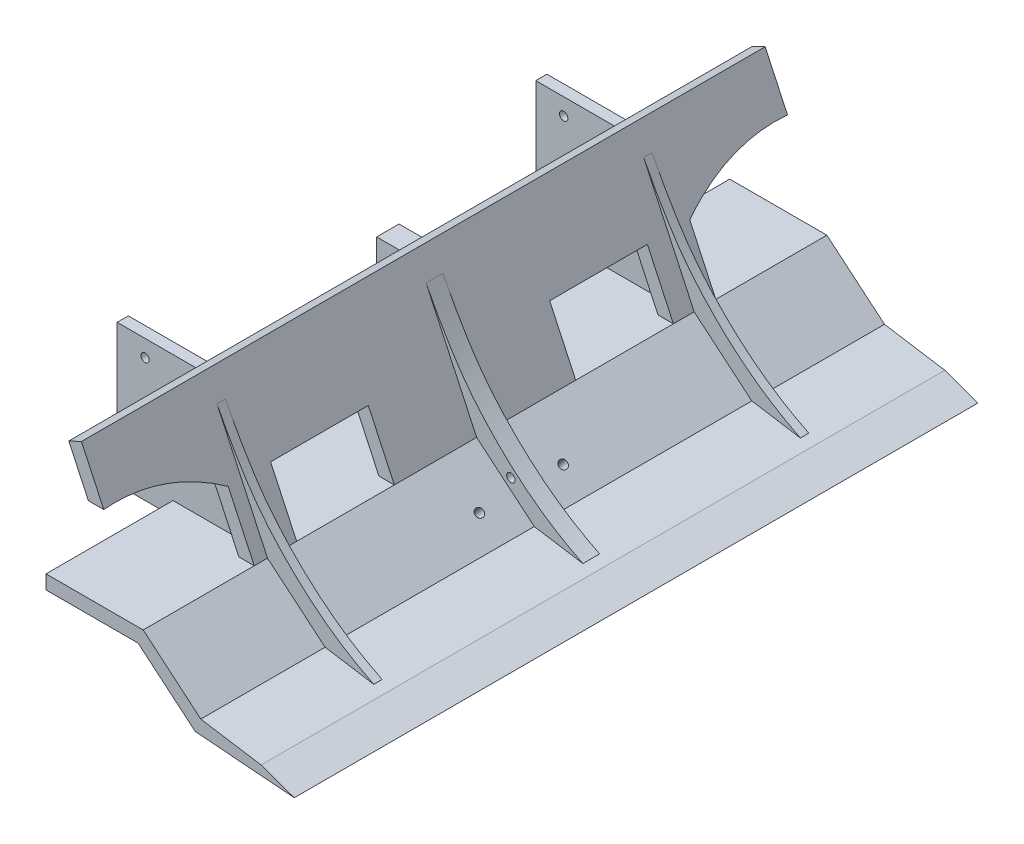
ISO-10303-21;
HEADER;
FILE_DESCRIPTION(('STEP AP214'),'2;1');
FILE_NAME('part.step','',(''),(''),'','','');
FILE_SCHEMA(('AUTOMOTIVE_DESIGN { 1 0 10303 214 1 1 1 1 }'));
ENDSEC;
DATA;
#1=APPLICATION_CONTEXT('core data for automotive mechanical design processes');
#2=APPLICATION_PROTOCOL_DEFINITION('international standard','automotive_design',2000,#1);
#3=PRODUCT_CONTEXT('',#1,'mechanical');
#4=PRODUCT('Part','Part','',(#3));
#5=PRODUCT_RELATED_PRODUCT_CATEGORY('part','',(#4));
#6=PRODUCT_DEFINITION_FORMATION('','',#4);
#7=PRODUCT_DEFINITION_CONTEXT('part definition',#1,'design');
#8=PRODUCT_DEFINITION('design','',#6,#7);
#9=PRODUCT_DEFINITION_SHAPE('','',#8);
#10=(LENGTH_UNIT() NAMED_UNIT(*) SI_UNIT(.MILLI.,.METRE.));
#11=(NAMED_UNIT(*) PLANE_ANGLE_UNIT() SI_UNIT($,.RADIAN.));
#12=(NAMED_UNIT(*) SI_UNIT($,.STERADIAN.) SOLID_ANGLE_UNIT());
#13=UNCERTAINTY_MEASURE_WITH_UNIT(LENGTH_MEASURE(1.E-05),#10,'distance_accuracy_value','');
#14=(GEOMETRIC_REPRESENTATION_CONTEXT(3) GLOBAL_UNCERTAINTY_ASSIGNED_CONTEXT((#13)) GLOBAL_UNIT_ASSIGNED_CONTEXT((#10,
#11,#12)) REPRESENTATION_CONTEXT('',''));
#15=CARTESIAN_POINT('',(0.,0.,0.));
#16=DIRECTION('',(0.,0.,1.));
#17=DIRECTION('',(1.,0.,0.));
#18=AXIS2_PLACEMENT_3D('',#15,#16,#17);
#19=CARTESIAN_POINT('',(8.73774397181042,106.197422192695,195.5));
#20=DIRECTION('',(0.,0.,1.));
#21=DIRECTION('',(1.,0.,0.));
#22=AXIS2_PLACEMENT_3D('',#19,#20,#21);
#23=PLANE('',#22);
#24=DIRECTION('',(-1.,0.,0.));
#25=VECTOR('',#24,1.);
#26=CARTESIAN_POINT('',(8.73774397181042,25.,195.5));
#27=LINE('',#26,#25);
#28=CARTESIAN_POINT('',(8.73774397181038,25.,195.5));
#29=VERTEX_POINT('',#28);
#30=CARTESIAN_POINT('',(-40.565217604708,25.,195.5));
#31=VERTEX_POINT('',#30);
#32=EDGE_CURVE('E1187',#29,#31,#27,.T.);
#33=ORIENTED_EDGE('',*,*,#32,.T.);
#34=DIRECTION('',(0.,1.,0.));
#35=VECTOR('',#34,1.);
#36=CARTESIAN_POINT('',(-40.565217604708,-0.396078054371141,195.5));
#37=LINE('',#36,#35);
#38=CARTESIAN_POINT('',(-40.565217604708,70.3153893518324,195.5));
#39=VERTEX_POINT('',#38);
#40=EDGE_CURVE('E1177',#31,#39,#37,.T.);
#41=ORIENTED_EDGE('',*,*,#40,.T.);
#42=DIRECTION('',(1.,0.,0.));
#43=VECTOR('',#42,1.);
#44=CARTESIAN_POINT('',(8.73774397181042,70.3153893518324,195.5));
#45=LINE('',#44,#43);
#46=CARTESIAN_POINT('',(-12.3931691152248,70.3153893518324,195.5));
#47=VERTEX_POINT('',#46);
#48=EDGE_CURVE('E1168',#39,#47,#45,.T.);
#49=ORIENTED_EDGE('',*,*,#48,.T.);
#50=DIRECTION('',(0.422618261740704,-0.906307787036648,0.));
#51=VECTOR('',#50,1.);
#52=CARTESIAN_POINT('',(-22.3626730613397,91.6950595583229,195.5));
#53=LINE('',#52,#51);
#54=EDGE_CURVE('E1108',#47,#29,#53,.T.);
#55=ORIENTED_EDGE('',*,*,#54,.T.);
#56=EDGE_LOOP('',(#33,#41,#49,#55));
#57=FACE_BOUND('',#56,.T.);
#58=CARTESIAN_POINT('',(-30.565217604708,64.3153893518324,195.5));
#59=DIRECTION('',(0.,0.,1.));
#60=DIRECTION('',(1.,0.,0.));
#61=AXIS2_PLACEMENT_3D('',#58,#59,#60);
#62=CIRCLE('',#61,1.5);
#63=CARTESIAN_POINT('',(-32.065217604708,64.3153893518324,195.5));
#64=VERTEX_POINT('',#63);
#65=EDGE_CURVE('E563',#64,#64,#62,.T.);
#66=ORIENTED_EDGE('',*,*,#65,.T.);
#67=EDGE_LOOP('',(#66));
#68=FACE_BOUND('',#67,.T.);
#69=CARTESIAN_POINT('',(-30.565217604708,44.3153893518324,195.5));
#70=DIRECTION('',(0.,0.,1.));
#71=DIRECTION('',(1.,0.,0.));
#72=AXIS2_PLACEMENT_3D('',#69,#70,#71);
#73=CIRCLE('',#72,1.5);
#74=CARTESIAN_POINT('',(-32.065217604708,44.3153893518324,195.5));
#75=VERTEX_POINT('',#74);
#76=EDGE_CURVE('E553',#75,#75,#73,.T.);
#77=ORIENTED_EDGE('',*,*,#76,.T.);
#78=EDGE_LOOP('',(#77));
#79=FACE_BOUND('',#78,.T.);
#80=ADVANCED_FACE('F37',(#57,#68,#79),#23,.F.);
#81=CARTESIAN_POINT('',(8.73774397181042,106.197422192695,49.5));
#82=DIRECTION('',(0.,0.,-1.));
#83=DIRECTION('',(-1.,0.,0.));
#84=AXIS2_PLACEMENT_3D('',#81,#82,#83);
#85=PLANE('',#84);
#86=DIRECTION('',(1.,0.,0.));
#87=VECTOR('',#86,1.);
#88=CARTESIAN_POINT('',(8.73774397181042,25.,49.5));
#89=LINE('',#88,#87);
#90=CARTESIAN_POINT('',(-40.565217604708,25.,49.5));
#91=VERTEX_POINT('',#90);
#92=CARTESIAN_POINT('',(8.73774397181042,25.,49.5));
#93=VERTEX_POINT('',#92);
#94=EDGE_CURVE('E1104',#91,#93,#89,.T.);
#95=ORIENTED_EDGE('',*,*,#94,.T.);
#96=DIRECTION('',(-0.422618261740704,0.906307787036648,0.));
#97=VECTOR('',#96,1.);
#98=CARTESIAN_POINT('',(-22.3626730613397,91.6950595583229,49.5));
#99=LINE('',#98,#97);
#100=CARTESIAN_POINT('',(-12.3931691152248,70.3153893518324,49.5));
#101=VERTEX_POINT('',#100);
#102=EDGE_CURVE('E1106',#93,#101,#99,.T.);
#103=ORIENTED_EDGE('',*,*,#102,.T.);
#104=DIRECTION('',(-1.,0.,0.));
#105=VECTOR('',#104,1.);
#106=CARTESIAN_POINT('',(8.73774397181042,70.3153893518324,49.5));
#107=LINE('',#106,#105);
#108=CARTESIAN_POINT('',(-40.565217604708,70.3153893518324,49.5));
#109=VERTEX_POINT('',#108);
#110=EDGE_CURVE('E1163',#101,#109,#107,.T.);
#111=ORIENTED_EDGE('',*,*,#110,.T.);
#112=DIRECTION('',(0.,1.,0.));
#113=VECTOR('',#112,1.);
#114=CARTESIAN_POINT('',(-40.565217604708,-0.396078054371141,49.5));
#115=LINE('',#114,#113);
#116=EDGE_CURVE('E1226',#91,#109,#115,.T.);
#117=ORIENTED_EDGE('',*,*,#116,.F.);
#118=EDGE_LOOP('',(#95,#103,#111,#117));
#119=FACE_BOUND('',#118,.T.);
#120=CARTESIAN_POINT('',(-30.565217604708,64.3153893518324,49.5));
#121=DIRECTION('',(0.,0.,-1.));
#122=DIRECTION('',(-1.,0.,0.));
#123=AXIS2_PLACEMENT_3D('',#120,#121,#122);
#124=CIRCLE('',#123,1.5);
#125=CARTESIAN_POINT('',(-32.065217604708,64.3153893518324,49.5));
#126=VERTEX_POINT('',#125);
#127=EDGE_CURVE('E560',#126,#126,#124,.T.);
#128=ORIENTED_EDGE('',*,*,#127,.T.);
#129=EDGE_LOOP('',(#128));
#130=FACE_BOUND('',#129,.T.);
#131=CARTESIAN_POINT('',(-30.565217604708,44.3153893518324,49.5));
#132=DIRECTION('',(0.,0.,-1.));
#133=DIRECTION('',(-1.,0.,0.));
#134=AXIS2_PLACEMENT_3D('',#131,#132,#133);
#135=CIRCLE('',#134,1.5);
#136=CARTESIAN_POINT('',(-32.065217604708,44.3153893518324,49.5));
#137=VERTEX_POINT('',#136);
#138=EDGE_CURVE('E550',#137,#137,#135,.T.);
#139=ORIENTED_EDGE('',*,*,#138,.T.);
#140=EDGE_LOOP('',(#139));
#141=FACE_BOUND('',#140,.T.);
#142=ADVANCED_FACE('F626',(#119,#130,#141),#85,.F.);
#143=CARTESIAN_POINT('',(-20.565217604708,25.,245.));
#144=DIRECTION('',(1.,0.,0.));
#145=DIRECTION('',(0.,0.,-1.));
#146=AXIS2_PLACEMENT_3D('',#143,#144,#145);
#147=PLANE('',#146);
#148=DIRECTION('',(0.,0.,-1.));
#149=VECTOR('',#148,1.);
#150=CARTESIAN_POINT('',(-20.565217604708,25.,245.));
#151=LINE('',#150,#149);
#152=CARTESIAN_POINT('',(-20.565217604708,25.,126.5));
#153=VERTEX_POINT('',#152);
#154=CARTESIAN_POINT('',(-20.565217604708,25.,118.5));
#155=VERTEX_POINT('',#154);
#156=EDGE_CURVE('E45',#153,#155,#151,.T.);
#157=ORIENTED_EDGE('',*,*,#156,.F.);
#158=DIRECTION('',(0.,-1.,0.));
#159=VECTOR('',#158,1.);
#160=CARTESIAN_POINT('',(-20.565217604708,107.545023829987,126.5));
#161=LINE('',#160,#159);
#162=CARTESIAN_POINT('',(-20.565217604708,70.3153893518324,126.5));
#163=VERTEX_POINT('',#162);
#164=EDGE_CURVE('E677',#163,#153,#161,.T.);
#165=ORIENTED_EDGE('',*,*,#164,.F.);
#166=DIRECTION('',(0.,0.,-1.));
#167=VECTOR('',#166,1.);
#168=CARTESIAN_POINT('',(-20.565217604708,70.3153893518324,245.));
#169=LINE('',#168,#167);
#170=CARTESIAN_POINT('',(-20.565217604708,70.3153893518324,118.5));
#171=VERTEX_POINT('',#170);
#172=EDGE_CURVE('E1180',#163,#171,#169,.T.);
#173=ORIENTED_EDGE('',*,*,#172,.T.);
#174=DIRECTION('',(0.,-1.,0.));
#175=VECTOR('',#174,1.);
#176=CARTESIAN_POINT('',(-20.565217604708,107.545023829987,118.5));
#177=LINE('',#176,#175);
#178=EDGE_CURVE('E1118',#171,#155,#177,.T.);
#179=ORIENTED_EDGE('',*,*,#178,.T.);
#180=EDGE_LOOP('',(#157,#165,#173,#179));
#181=FACE_BOUND('',#180,.T.);
#182=ADVANCED_FACE('F632',(#181),#147,.F.);
#183=CARTESIAN_POINT('',(12.434782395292,20.,245.));
#184=DIRECTION('',(0.642787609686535,0.766044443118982,0.));
#185=DIRECTION('',(-0.766044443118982,0.642787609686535,0.));
#186=AXIS2_PLACEMENT_3D('',#183,#184,#185);
#187=PLANE('',#186);
#188=CARTESIAN_POINT('',(24.0311415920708,10.2694992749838,137.5));
#189=DIRECTION('',(0.642787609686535,0.766044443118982,0.));
#190=DIRECTION('',(-0.766044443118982,0.642787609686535,0.));
#191=AXIS2_PLACEMENT_3D('',#188,#189,#190);
#192=CIRCLE('',#191,1.5);
#193=CARTESIAN_POINT('',(22.8820749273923,11.2336806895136,137.5));
#194=VERTEX_POINT('',#193);
#195=EDGE_CURVE('E452',#194,#194,#192,.T.);
#196=ORIENTED_EDGE('',*,*,#195,.T.);
#197=EDGE_LOOP('',(#196));
#198=FACE_BOUND('',#197,.T.);
#199=CARTESIAN_POINT('',(24.0311415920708,10.2694992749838,107.5));
#200=DIRECTION('',(0.642787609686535,0.766044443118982,0.));
#201=DIRECTION('',(-0.766044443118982,0.642787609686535,0.));
#202=AXIS2_PLACEMENT_3D('',#199,#200,#201);
#203=CIRCLE('',#202,1.5);
#204=CARTESIAN_POINT('',(22.8820749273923,11.2336806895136,107.5));
#205=VERTEX_POINT('',#204);
#206=EDGE_CURVE('E458',#205,#205,#203,.T.);
#207=ORIENTED_EDGE('',*,*,#206,.T.);
#208=EDGE_LOOP('',(#207));
#209=FACE_BOUND('',#208,.T.);
#210=DIRECTION('',(-0.766044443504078,0.642787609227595,0.));
#211=VECTOR('',#210,1.);
#212=CARTESIAN_POINT('',(32.9164337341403,2.81385393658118,215.));
#213=LINE('',#212,#211);
#214=CARTESIAN_POINT('',(32.9164336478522,2.81385398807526,215.));
#215=VERTEX_POINT('',#214);
#216=CARTESIAN_POINT('',(12.434782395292,20.,215.));
#217=VERTEX_POINT('',#216);
#218=EDGE_CURVE('E1296',#215,#217,#213,.T.);
#219=ORIENTED_EDGE('',*,*,#218,.T.);
#220=DIRECTION('',(0.,0.,-1.));
#221=VECTOR('',#220,1.);
#222=CARTESIAN_POINT('',(12.434782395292,20.,245.));
#223=LINE('',#222,#221);
#224=CARTESIAN_POINT('',(12.434782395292,20.,35.));
#225=VERTEX_POINT('',#224);
#226=EDGE_CURVE('E822',#217,#225,#223,.T.);
#227=ORIENTED_EDGE('',*,*,#226,.T.);
#228=DIRECTION('',(0.766044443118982,-0.642787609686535,0.));
#229=VECTOR('',#228,1.);
#230=CARTESIAN_POINT('',(32.9164336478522,2.81385398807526,35.));
#231=LINE('',#230,#229);
#232=CARTESIAN_POINT('',(32.9164336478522,2.81385398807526,35.));
#233=VERTEX_POINT('',#232);
#234=EDGE_CURVE('E526',#225,#233,#231,.T.);
#235=ORIENTED_EDGE('',*,*,#234,.T.);
#236=DIRECTION('',(0.,0.,-1.));
#237=VECTOR('',#236,1.);
#238=CARTESIAN_POINT('',(32.9164336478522,2.81385398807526,245.));
#239=LINE('',#238,#237);
#240=EDGE_CURVE('E849',#215,#233,#239,.T.);
#241=ORIENTED_EDGE('',*,*,#240,.F.);
#242=EDGE_LOOP('',(#219,#227,#235,#241));
#243=FACE_BOUND('',#242,.T.);
#244=ADVANCED_FACE('F920',(#198,#209,#243),#187,.F.);
#245=CARTESIAN_POINT('',(12.434782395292,20.,245.));
#246=DIRECTION('',(0.,1.,0.));
#247=DIRECTION('',(-1.,0.,0.));
#248=AXIS2_PLACEMENT_3D('',#245,#246,#247);
#249=PLANE('',#248);
#250=DIRECTION('',(0.,0.,-1.));
#251=VECTOR('',#250,1.);
#252=CARTESIAN_POINT('',(-40.565217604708,20.,195.5));
#253=LINE('',#252,#251);
#254=CARTESIAN_POINT('',(-40.565217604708,20.,199.5));
#255=VERTEX_POINT('',#254);
#256=CARTESIAN_POINT('',(-40.565217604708,20.,45.5));
#257=VERTEX_POINT('',#256);
#258=EDGE_CURVE('E1174',#255,#257,#253,.T.);
#259=ORIENTED_EDGE('',*,*,#258,.T.);
#260=DIRECTION('',(1.,0.,0.));
#261=VECTOR('',#260,1.);
#262=CARTESIAN_POINT('',(-20.565217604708,20.,45.5));
#263=LINE('',#262,#261);
#264=CARTESIAN_POINT('',(-20.565217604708,20.,45.5));
#265=VERTEX_POINT('',#264);
#266=EDGE_CURVE('E1222',#257,#265,#263,.T.);
#267=ORIENTED_EDGE('',*,*,#266,.T.);
#268=DIRECTION('',(0.,0.,-1.));
#269=VECTOR('',#268,1.);
#270=CARTESIAN_POINT('',(-20.565217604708,20.,245.));
#271=LINE('',#270,#269);
#272=CARTESIAN_POINT('',(-20.565217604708,20.,35.));
#273=VERTEX_POINT('',#272);
#274=EDGE_CURVE('E828',#265,#273,#271,.T.);
#275=ORIENTED_EDGE('',*,*,#274,.T.);
#276=DIRECTION('',(1.,0.,0.));
#277=VECTOR('',#276,1.);
#278=CARTESIAN_POINT('',(12.434782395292,20.,35.));
#279=LINE('',#278,#277);
#280=EDGE_CURVE('E517',#273,#225,#279,.T.);
#281=ORIENTED_EDGE('',*,*,#280,.T.);
#282=ORIENTED_EDGE('',*,*,#226,.F.);
#283=DIRECTION('',(-1.,3.06373192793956E-12,0.));
#284=VECTOR('',#283,1.);
#285=CARTESIAN_POINT('',(12.434782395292,20.,215.));
#286=LINE('',#285,#284);
#287=CARTESIAN_POINT('',(-20.5652176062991,20.0000000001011,215.));
#288=VERTEX_POINT('',#287);
#289=EDGE_CURVE('E480',#217,#288,#286,.T.);
#290=ORIENTED_EDGE('',*,*,#289,.T.);
#291=CARTESIAN_POINT('',(-20.565217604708,20.,199.5));
#292=VERTEX_POINT('',#291);
#293=EDGE_CURVE('E827',#288,#292,#271,.T.);
#294=ORIENTED_EDGE('',*,*,#293,.T.);
#295=DIRECTION('',(-1.,0.,0.));
#296=VECTOR('',#295,1.);
#297=CARTESIAN_POINT('',(-20.565217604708,20.,199.5));
#298=LINE('',#297,#296);
#299=EDGE_CURVE('E1169',#292,#255,#298,.T.);
#300=ORIENTED_EDGE('',*,*,#299,.T.);
#301=EDGE_LOOP('',(#259,#267,#275,#281,#282,#290,#294,#300));
#302=FACE_BOUND('',#301,.T.);
#303=ADVANCED_FACE('F899',(#302),#249,.F.);
#304=CARTESIAN_POINT('',(12.434782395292,20.,245.));
#305=VERTEX_POINT('',#304);
#306=CARTESIAN_POINT('',(12.434782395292,20.,220.));
#307=VERTEX_POINT('',#306);
#308=EDGE_CURVE('E818',#305,#307,#223,.T.);
#309=ORIENTED_EDGE('',*,*,#308,.T.);
#310=DIRECTION('',(-0.766044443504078,0.642787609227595,0.));
#311=VECTOR('',#310,1.);
#312=CARTESIAN_POINT('',(32.9164337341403,2.81385393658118,220.));
#313=LINE('',#312,#311);
#314=CARTESIAN_POINT('',(32.9164337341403,2.81385393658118,220.));
#315=VERTEX_POINT('',#314);
#316=EDGE_CURVE('E479',#315,#307,#313,.T.);
#317=ORIENTED_EDGE('',*,*,#316,.F.);
#318=CARTESIAN_POINT('',(32.9164336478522,2.81385398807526,245.));
#319=VERTEX_POINT('',#318);
#320=EDGE_CURVE('E845',#319,#315,#239,.T.);
#321=ORIENTED_EDGE('',*,*,#320,.F.);
#322=DIRECTION('',(0.766044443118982,-0.642787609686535,0.));
#323=VECTOR('',#322,1.);
#324=CARTESIAN_POINT('',(12.434782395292,20.,245.));
#325=LINE('',#324,#323);
#326=EDGE_CURVE('E789',#305,#319,#325,.T.);
#327=ORIENTED_EDGE('',*,*,#326,.F.);
#328=EDGE_LOOP('',(#309,#317,#321,#327));
#329=FACE_BOUND('',#328,.T.);
#330=ADVANCED_FACE('F921',(#329),#187,.F.);
#331=CARTESIAN_POINT('',(-20.565217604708,20.,245.));
#332=VERTEX_POINT('',#331);
#333=CARTESIAN_POINT('',(-20.5652176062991,20.0000000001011,220.));
#334=VERTEX_POINT('',#333);
#335=EDGE_CURVE('E823',#332,#334,#271,.T.);
#336=ORIENTED_EDGE('',*,*,#335,.T.);
#337=DIRECTION('',(-1.,3.06373192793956E-12,0.));
#338=VECTOR('',#337,1.);
#339=CARTESIAN_POINT('',(12.434782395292,20.,220.));
#340=LINE('',#339,#338);
#341=EDGE_CURVE('E1289',#307,#334,#340,.T.);
#342=ORIENTED_EDGE('',*,*,#341,.F.);
#343=ORIENTED_EDGE('',*,*,#308,.F.);
#344=DIRECTION('',(1.,0.,0.));
#345=VECTOR('',#344,1.);
#346=CARTESIAN_POINT('',(12.434782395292,20.,245.));
#347=LINE('',#346,#345);
#348=EDGE_CURVE('E802',#332,#305,#347,.T.);
#349=ORIENTED_EDGE('',*,*,#348,.F.);
#350=EDGE_LOOP('',(#336,#342,#343,#349));
#351=FACE_BOUND('',#350,.T.);
#352=ADVANCED_FACE('F900',(#351),#249,.F.);
#353=CARTESIAN_POINT('',(14.254633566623,25.,245.));
#354=DIRECTION('',(-0.642787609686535,-0.766044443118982,0.));
#355=DIRECTION('',(0.766044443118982,-0.642787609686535,0.));
#356=AXIS2_PLACEMENT_3D('',#353,#354,#355);
#357=PLANE('',#356);
#358=CARTESIAN_POINT('',(27.2450796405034,14.0997214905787,107.5));
#359=DIRECTION('',(0.642787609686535,0.766044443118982,0.));
#360=DIRECTION('',(-0.766044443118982,0.642787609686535,0.));
#361=AXIS2_PLACEMENT_3D('',#358,#359,#360);
#362=CIRCLE('',#361,1.5);
#363=CARTESIAN_POINT('',(26.096012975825,15.0639029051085,107.5));
#364=VERTEX_POINT('',#363);
#365=EDGE_CURVE('E455',#364,#364,#362,.T.);
#366=ORIENTED_EDGE('',*,*,#365,.F.);
#367=EDGE_LOOP('',(#366));
#368=FACE_BOUND('',#367,.T.);
#369=DIRECTION('',(-0.766044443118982,0.642787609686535,0.));
#370=VECTOR('',#369,1.);
#371=CARTESIAN_POINT('',(34.9055240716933,7.67184539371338,47.5544126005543));
#372=LINE('',#371,#370);
#373=CARTESIAN_POINT('',(34.9055240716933,7.67184539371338,47.5544126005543));
#374=VERTEX_POINT('',#373);
#375=CARTESIAN_POINT('',(14.254633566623,25.,47.5544126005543));
#376=VERTEX_POINT('',#375);
#377=EDGE_CURVE('E567',#374,#376,#372,.T.);
#378=ORIENTED_EDGE('',*,*,#377,.T.);
#379=DIRECTION('',(0.,0.,-1.));
#380=VECTOR('',#379,1.);
#381=CARTESIAN_POINT('',(14.254633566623,25.,245.));
#382=LINE('',#381,#380);
#383=CARTESIAN_POINT('',(14.254633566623,25.,55.));
#384=VERTEX_POINT('',#383);
#385=EDGE_CURVE('E1014',#384,#376,#382,.T.);
#386=ORIENTED_EDGE('',*,*,#385,.F.);
#387=CARTESIAN_POINT('',(14.254633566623,25.,90.));
#388=VERTEX_POINT('',#387);
#389=EDGE_CURVE('E838',#388,#384,#382,.T.);
#390=ORIENTED_EDGE('',*,*,#389,.F.);
#391=CARTESIAN_POINT('',(14.254633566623,25.,119.5));
#392=VERTEX_POINT('',#391);
#393=EDGE_CURVE('E1018',#392,#388,#382,.T.);
#394=ORIENTED_EDGE('',*,*,#393,.F.);
#395=DIRECTION('',(-0.766044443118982,0.642787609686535,0.));
#396=VECTOR('',#395,1.);
#397=CARTESIAN_POINT('',(14.254633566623,25.,119.5));
#398=LINE('',#397,#396);
#399=CARTESIAN_POINT('',(34.9055240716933,7.67184539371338,119.5));
#400=VERTEX_POINT('',#399);
#401=EDGE_CURVE('E1002',#400,#392,#398,.T.);
#402=ORIENTED_EDGE('',*,*,#401,.F.);
#403=DIRECTION('',(0.,0.,-1.));
#404=VECTOR('',#403,1.);
#405=CARTESIAN_POINT('',(34.9055240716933,7.67184539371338,245.));
#406=LINE('',#405,#404);
#407=EDGE_CURVE('E945',#400,#374,#406,.T.);
#408=ORIENTED_EDGE('',*,*,#407,.T.);
#409=EDGE_LOOP('',(#378,#386,#390,#394,#402,#408));
#410=FACE_BOUND('',#409,.T.);
#411=ADVANCED_FACE('F882',(#368,#410),#357,.F.);
#412=CARTESIAN_POINT('',(14.254633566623,25.,0.));
#413=DIRECTION('',(0.906307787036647,0.422618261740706,0.));
#414=DIRECTION('',(-0.422618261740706,0.906307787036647,0.));
#415=AXIS2_PLACEMENT_3D('',#412,#413,#414);
#416=PLANE('',#415);
#417=ORIENTED_EDGE('',*,*,#385,.T.);
#418=DIRECTION('',(-0.422618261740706,0.906307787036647,0.));
#419=VECTOR('',#418,1.);
#420=CARTESIAN_POINT('',(14.254633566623,25.,47.5544126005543));
#421=LINE('',#420,#419);
#422=CARTESIAN_POINT('',(-3.8640160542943,63.8555695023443,47.5544126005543));
#423=VERTEX_POINT('',#422);
#424=EDGE_CURVE('E569',#376,#423,#421,.T.);
#425=ORIENTED_EDGE('',*,*,#424,.T.);
#426=DIRECTION('',(0.,0.,1.));
#427=VECTOR('',#426,1.);
#428=CARTESIAN_POINT('',(-3.8640160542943,63.8555695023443,46.0544126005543));
#429=LINE('',#428,#427);
#430=CARTESIAN_POINT('',(-3.8640160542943,63.8555695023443,44.5544126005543));
#431=VERTEX_POINT('',#430);
#432=EDGE_CURVE('E572',#423,#431,#429,.F.);
#433=ORIENTED_EDGE('',*,*,#432,.T.);
#434=DIRECTION('',(-0.422618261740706,0.906307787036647,0.));
#435=VECTOR('',#434,1.);
#436=CARTESIAN_POINT('',(14.254633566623,25.,44.5544126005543));
#437=LINE('',#436,#435);
#438=CARTESIAN_POINT('',(14.254633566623,25.,44.5544126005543));
#439=VERTEX_POINT('',#438);
#440=EDGE_CURVE('E576',#439,#431,#437,.T.);
#441=ORIENTED_EDGE('',*,*,#440,.F.);
#442=CARTESIAN_POINT('',(14.254633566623,25.,39.8044126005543));
#443=VERTEX_POINT('',#442);
#444=EDGE_CURVE('E837',#439,#443,#382,.T.);
#445=ORIENTED_EDGE('',*,*,#444,.T.);
#446=DIRECTION('',(0.422618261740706,-0.906307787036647,0.));
#447=VECTOR('',#446,1.);
#448=CARTESIAN_POINT('',(14.254633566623,25.,39.8044126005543));
#449=LINE('',#448,#447);
#450=CARTESIAN_POINT('',(4.92848040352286,45.,39.8044126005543));
#451=VERTEX_POINT('',#450);
#452=EDGE_CURVE('E864',#451,#443,#449,.T.);
#453=ORIENTED_EDGE('',*,*,#452,.F.);
#454=CARTESIAN_POINT('',(0.133598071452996,55.2826583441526,0.));
#455=CARTESIAN_POINT('',(0.116564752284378,55.319186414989,0.608168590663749));
#456=CARTESIAN_POINT('',(0.103141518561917,55.3479726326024,1.21691390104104));
#457=CARTESIAN_POINT('',(0.0836667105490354,55.3897364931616,2.43502343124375));
#458=CARTESIAN_POINT('',(0.0776146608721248,55.402715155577,3.04438760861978));
#459=CARTESIAN_POINT('',(0.0730316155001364,55.4125435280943,4.26324113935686));
#460=CARTESIAN_POINT('',(0.0745001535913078,55.4093942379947,4.87273048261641));
#461=CARTESIAN_POINT('',(0.0850839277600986,55.3866972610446,6.0916308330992));
#462=CARTESIAN_POINT('',(0.0942028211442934,55.3671417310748,6.70104166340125));
#463=CARTESIAN_POINT('',(0.120194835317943,55.3114016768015,7.91898084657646));
#464=CARTESIAN_POINT('',(0.137068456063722,55.2752160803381,8.52750914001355));
#465=CARTESIAN_POINT('',(0.178647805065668,55.1860488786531,9.74317345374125));
#466=CARTESIAN_POINT('',(0.203354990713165,55.1330641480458,10.3503091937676));
#467=CARTESIAN_POINT('',(0.271035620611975,54.9879225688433,11.7822366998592));
#468=CARTESIAN_POINT('',(0.317383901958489,54.888528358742,12.6061492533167));
#469=CARTESIAN_POINT('',(0.424757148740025,54.6582656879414,14.2488561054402));
#470=CARTESIAN_POINT('',(0.485786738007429,54.5273873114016,15.0676487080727));
#471=CARTESIAN_POINT('',(0.622450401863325,54.2343111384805,16.6985279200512));
#472=CARTESIAN_POINT('',(0.6980869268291,54.0721080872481,17.5106133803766));
#473=CARTESIAN_POINT('',(0.863778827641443,53.7167806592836,19.1265195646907));
#474=CARTESIAN_POINT('',(0.953834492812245,53.5236556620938,19.9303401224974));
#475=CARTESIAN_POINT('',(1.14819017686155,53.1068585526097,21.5292308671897));
#476=CARTESIAN_POINT('',(1.25250571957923,52.8831531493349,22.3242904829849));
#477=CARTESIAN_POINT('',(1.47492650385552,52.4061702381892,23.9034687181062));
#478=CARTESIAN_POINT('',(1.59303081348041,52.1528947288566,24.6875880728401));
#479=CARTESIAN_POINT('',(1.84256920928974,51.6177579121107,26.2437455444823));
#480=CARTESIAN_POINT('',(1.97400179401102,51.3358998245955,27.0157850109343));
#481=CARTESIAN_POINT('',(2.2496588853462,50.7447512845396,28.5467317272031));
#482=CARTESIAN_POINT('',(2.39388004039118,50.4354680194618,29.3056423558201));
#483=CARTESIAN_POINT('',(2.6576231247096,49.8698691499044,30.6249018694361));
#484=CARTESIAN_POINT('',(2.77450581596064,49.6192134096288,31.1882177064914));
#485=CARTESIAN_POINT('',(3.01496368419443,49.1035498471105,32.306664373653));
#486=CARTESIAN_POINT('',(3.13853759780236,48.8385447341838,32.8617967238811));
#487=CARTESIAN_POINT('',(3.39212639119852,48.2947218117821,33.9637196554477));
#488=CARTESIAN_POINT('',(3.5221409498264,48.0159046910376,34.5105106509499));
#489=CARTESIAN_POINT('',(3.78790624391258,47.4459691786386,35.5937997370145));
#490=CARTESIAN_POINT('',(3.92363648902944,47.154894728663,36.1303259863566));
#491=CARTESIAN_POINT('',(4.20097223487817,46.5601463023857,37.1948320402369));
#492=CARTESIAN_POINT('',(4.34257798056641,46.2564718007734,37.7228114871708));
#493=CARTESIAN_POINT('',(4.63139303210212,45.6371059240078,38.7701198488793));
#494=CARTESIAN_POINT('',(4.77860233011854,45.3214145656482,39.2894487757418));
#495=CARTESIAN_POINT('',(4.92848040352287,45.,39.8044126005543));
#496=B_SPLINE_CURVE_WITH_KNOTS('',3,(#454,#455,#456,#457,#458,#459,#460,#461,#462,#463,#464,
#465,#466,#467,#468,#469,#470,#471,#472,#473,#474,#475,#476,#477,#478,#479,#480,#481,#482,#483,
#484,#485,#486,#487,#488,#489,#490,#491,#492,#493,#494,#495),.UNSPECIFIED.,.F.,.F.,(4,2,2,2,2,2,
2,2,2,2,2,2,2,2,2,2,2,2,2,2,4),(0.,1.82846350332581,3.65680907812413,5.48504131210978,
7.31414804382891,9.14337271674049,10.9729379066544,13.4657047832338,15.9592577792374,
18.4532294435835,20.9472511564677,23.4440099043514,25.9406000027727,28.4369091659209,
30.9325660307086,32.8149630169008,34.697005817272,36.5789548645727,38.4546520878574,
40.3304275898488,42.2062004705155),.UNSPECIFIED.);
#497=CARTESIAN_POINT('',(0.133598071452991,55.2826583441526,0.));
#498=VERTEX_POINT('',#497);
#499=EDGE_CURVE('E867',#498,#451,#496,.T.);
#500=ORIENTED_EDGE('',*,*,#499,.F.);
#501=DIRECTION('',(-0.422618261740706,0.906307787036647,0.));
#502=VECTOR('',#501,1.);
#503=CARTESIAN_POINT('',(14.254633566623,25.,0.));
#504=LINE('',#503,#502);
#505=CARTESIAN_POINT('',(-7.86163018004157,72.4284806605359,0.));
#506=VERTEX_POINT('',#505);
#507=EDGE_CURVE('E758',#498,#506,#504,.T.);
#508=ORIENTED_EDGE('',*,*,#507,.T.);
#509=DIRECTION('',(0.,0.,1.));
#510=VECTOR('',#509,1.);
#511=CARTESIAN_POINT('',(-7.86163018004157,72.4284806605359,0.));
#512=LINE('',#511,#510);
#513=CARTESIAN_POINT('',(-7.86163018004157,72.4284806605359,245.));
#514=VERTEX_POINT('',#513);
#515=EDGE_CURVE('E767',#506,#514,#512,.T.);
#516=ORIENTED_EDGE('',*,*,#515,.T.);
#517=DIRECTION('',(-0.422618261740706,0.906307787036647,0.));
#518=VECTOR('',#517,1.);
#519=CARTESIAN_POINT('',(14.254633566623,25.,245.));
#520=LINE('',#519,#518);
#521=CARTESIAN_POINT('',(0.133598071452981,55.2826583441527,245.));
#522=VERTEX_POINT('',#521);
#523=EDGE_CURVE('E757',#522,#514,#520,.T.);
#524=ORIENTED_EDGE('',*,*,#523,.F.);
#525=CARTESIAN_POINT('',(4.92848040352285,45.,205.195587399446));
#526=CARTESIAN_POINT('',(4.70970110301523,45.4691737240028,205.947267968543));
#527=CARTESIAN_POINT('',(4.49660659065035,45.9261563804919,206.708286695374));
#528=CARTESIAN_POINT('',(4.08258036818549,46.8140384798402,208.248813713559));
#529=CARTESIAN_POINT('',(3.88165089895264,47.2449331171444,209.028325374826));
#530=CARTESIAN_POINT('',(3.49262480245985,48.079202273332,210.606203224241));
#531=CARTESIAN_POINT('',(3.30454187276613,48.4825474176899,211.404588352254));
#532=CARTESIAN_POINT('',(2.9422814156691,49.2594174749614,213.018787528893));
#533=CARTESIAN_POINT('',(2.76810298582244,49.632944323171,213.834600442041));
#534=CARTESIAN_POINT('',(2.44523991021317,50.3253264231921,215.429552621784));
#535=CARTESIAN_POINT('',(2.29563490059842,50.6461554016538,216.207648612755));
#536=CARTESIAN_POINT('',(2.00990003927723,51.2589157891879,217.777567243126));
#537=CARTESIAN_POINT('',(1.87376986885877,51.5508478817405,218.569389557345));
#538=CARTESIAN_POINT('',(1.61560524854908,52.1044836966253,220.165388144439));
#539=CARTESIAN_POINT('',(1.49356431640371,52.3662013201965,220.969558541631));
#540=CARTESIAN_POINT('',(1.26399751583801,52.8585089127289,222.589424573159));
#541=CARTESIAN_POINT('',(1.15647163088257,53.0890989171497,223.405120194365));
#542=CARTESIAN_POINT('',(0.955536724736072,53.5200052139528,225.053289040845));
#543=CARTESIAN_POINT('',(0.862247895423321,53.7200637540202,225.88584437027));
#544=CARTESIAN_POINT('',(0.691141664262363,54.0870022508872,227.559816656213));
#545=CARTESIAN_POINT('',(0.613324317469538,54.2538820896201,228.401233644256));
#546=CARTESIAN_POINT('',(0.473332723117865,54.5540950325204,230.091635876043));
#547=CARTESIAN_POINT('',(0.411164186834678,54.6874158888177,230.940623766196));
#548=CARTESIAN_POINT('',(0.30258495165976,54.9202648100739,232.644213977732));
#549=CARTESIAN_POINT('',(0.256173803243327,55.0197938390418,233.498816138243));
#550=CARTESIAN_POINT('',(0.191106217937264,55.1593317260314,234.944345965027));
#551=CARTESIAN_POINT('',(0.168308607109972,55.2082213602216,235.534250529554));
#552=CARTESIAN_POINT('',(0.13009067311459,55.2901799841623,236.715414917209));
#553=CARTESIAN_POINT('',(0.114670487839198,55.3232486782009,237.306674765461));
#554=CARTESIAN_POINT('',(0.091136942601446,55.3737165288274,238.49002456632));
#555=CARTESIAN_POINT('',(0.0830238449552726,55.3911151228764,239.082114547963));
#556=CARTESIAN_POINT('',(0.0740112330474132,55.4104427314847,240.266389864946));
#557=CARTESIAN_POINT('',(0.0731091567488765,55.4123772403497,240.858575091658));
#558=CARTESIAN_POINT('',(0.0783963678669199,55.4010387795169,242.042744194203));
#559=CARTESIAN_POINT('',(0.084585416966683,55.3877663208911,242.634728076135));
#560=CARTESIAN_POINT('',(0.103914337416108,55.3463153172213,243.817989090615));
#561=CARTESIAN_POINT('',(0.117053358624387,55.3181385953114,244.409266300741));
#562=CARTESIAN_POINT('',(0.133598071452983,55.2826583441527,245.));
#563=B_SPLINE_CURVE_WITH_KNOTS('',3,(#525,#526,#527,#528,#529,#530,#531,#532,#533,#534,#535,
#536,#537,#538,#539,#540,#541,#542,#543,#544,#545,#546,#547,#548,#549,#550,#551,#552,#553,#554,
#555,#556,#557,#558,#559,#560,#561,#562),.UNSPECIFIED.,.F.,.F.,(4,2,2,2,2,2,2,2,2,2,2,2,2,2,2,2,
2,2,4),(0.,2.73802917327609,5.47656118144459,8.2179689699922,10.9591986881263,13.5230312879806,
16.086803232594,18.6493908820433,21.2119756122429,23.7951217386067,26.3782770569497,
28.9623737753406,31.5463967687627,33.3232553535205,35.1001471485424,36.8771027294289,
38.6534269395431,40.4296914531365,42.2057387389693),.UNSPECIFIED.);
#564=CARTESIAN_POINT('',(4.92848040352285,45.,205.195587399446));
#565=VERTEX_POINT('',#564);
#566=EDGE_CURVE('E872',#565,#522,#563,.T.);
#567=ORIENTED_EDGE('',*,*,#566,.F.);
#568=DIRECTION('',(-0.422618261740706,0.906307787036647,0.));
#569=VECTOR('',#568,1.);
#570=CARTESIAN_POINT('',(14.254633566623,25.,205.195587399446));
#571=LINE('',#570,#569);
#572=CARTESIAN_POINT('',(14.254633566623,25.,205.195587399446));
#573=VERTEX_POINT('',#572);
#574=EDGE_CURVE('E1072',#573,#565,#571,.T.);
#575=ORIENTED_EDGE('',*,*,#574,.F.);
#576=CARTESIAN_POINT('',(14.254633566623,25.,200.445587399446));
#577=VERTEX_POINT('',#576);
#578=EDGE_CURVE('E836',#573,#577,#382,.T.);
#579=ORIENTED_EDGE('',*,*,#578,.T.);
#580=DIRECTION('',(0.422618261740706,-0.906307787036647,0.));
#581=VECTOR('',#580,1.);
#582=CARTESIAN_POINT('',(-3.8640160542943,63.8555695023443,200.445587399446));
#583=LINE('',#582,#581);
#584=CARTESIAN_POINT('',(-3.8640160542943,63.8555695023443,200.445587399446));
#585=VERTEX_POINT('',#584);
#586=EDGE_CURVE('E1070',#585,#577,#583,.T.);
#587=ORIENTED_EDGE('',*,*,#586,.F.);
#588=DIRECTION('',(0.,0.,1.));
#589=VECTOR('',#588,1.);
#590=CARTESIAN_POINT('',(-3.8640160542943,63.8555695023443,197.445587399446));
#591=LINE('',#590,#589);
#592=CARTESIAN_POINT('',(-3.8640160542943,63.8555695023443,197.445587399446));
#593=VERTEX_POINT('',#592);
#594=EDGE_CURVE('E1232',#593,#585,#591,.T.);
#595=ORIENTED_EDGE('',*,*,#594,.F.);
#596=DIRECTION('',(0.422618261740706,-0.906307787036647,0.));
#597=VECTOR('',#596,1.);
#598=CARTESIAN_POINT('',(-3.8640160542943,63.8555695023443,197.445587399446));
#599=LINE('',#598,#597);
#600=CARTESIAN_POINT('',(14.254633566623,25.,197.445587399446));
#601=VERTEX_POINT('',#600);
#602=EDGE_CURVE('E1245',#593,#601,#599,.T.);
#603=ORIENTED_EDGE('',*,*,#602,.T.);
#604=CARTESIAN_POINT('',(14.254633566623,25.,190.));
#605=VERTEX_POINT('',#604);
#606=EDGE_CURVE('E1019',#601,#605,#382,.T.);
#607=ORIENTED_EDGE('',*,*,#606,.T.);
#608=DIRECTION('',(0.422618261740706,-0.906307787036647,0.));
#609=VECTOR('',#608,1.);
#610=CARTESIAN_POINT('',(14.254633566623,25.,190.));
#611=LINE('',#610,#609);
#612=CARTESIAN_POINT('',(4.92848040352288,45.,190.));
#613=VERTEX_POINT('',#612);
#614=EDGE_CURVE('E857',#613,#605,#611,.T.);
#615=ORIENTED_EDGE('',*,*,#614,.F.);
#616=DIRECTION('',(0.,0.,1.));
#617=VECTOR('',#616,1.);
#618=CARTESIAN_POINT('',(4.92848040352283,45.0000000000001,0.));
#619=LINE('',#618,#617);
#620=CARTESIAN_POINT('',(4.92848040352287,45.,155.));
#621=VERTEX_POINT('',#620);
#622=EDGE_CURVE('E860',#621,#613,#619,.T.);
#623=ORIENTED_EDGE('',*,*,#622,.F.);
#624=DIRECTION('',(-0.422618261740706,0.906307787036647,0.));
#625=VECTOR('',#624,1.);
#626=CARTESIAN_POINT('',(14.254633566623,25.,155.));
#627=LINE('',#626,#625);
#628=CARTESIAN_POINT('',(14.254633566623,25.,155.));
#629=VERTEX_POINT('',#628);
#630=EDGE_CURVE('E862',#629,#621,#627,.T.);
#631=ORIENTED_EDGE('',*,*,#630,.F.);
#632=CARTESIAN_POINT('',(14.254633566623,25.,125.5));
#633=VERTEX_POINT('',#632);
#634=EDGE_CURVE('E943',#629,#633,#382,.T.);
#635=ORIENTED_EDGE('',*,*,#634,.T.);
#636=DIRECTION('',(-0.422618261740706,0.906307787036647,0.));
#637=VECTOR('',#636,1.);
#638=CARTESIAN_POINT('',(-3.8640160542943,63.8555695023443,125.5));
#639=LINE('',#638,#637);
#640=CARTESIAN_POINT('',(-3.8640160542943,63.8555695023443,125.5));
#641=VERTEX_POINT('',#640);
#642=EDGE_CURVE('E971',#633,#641,#639,.T.);
#643=ORIENTED_EDGE('',*,*,#642,.T.);
#644=DIRECTION('',(0.,0.,1.));
#645=VECTOR('',#644,1.);
#646=CARTESIAN_POINT('',(-3.8640160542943,63.8555695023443,122.5));
#647=LINE('',#646,#645);
#648=CARTESIAN_POINT('',(-3.8640160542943,63.8555695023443,119.5));
#649=VERTEX_POINT('',#648);
#650=EDGE_CURVE('E970',#641,#649,#647,.F.);
#651=ORIENTED_EDGE('',*,*,#650,.T.);
#652=DIRECTION('',(-0.422618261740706,0.906307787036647,0.));
#653=VECTOR('',#652,1.);
#654=CARTESIAN_POINT('',(-3.8640160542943,63.8555695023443,119.5));
#655=LINE('',#654,#653);
#656=EDGE_CURVE('E999',#392,#649,#655,.T.);
#657=ORIENTED_EDGE('',*,*,#656,.F.);
#658=ORIENTED_EDGE('',*,*,#393,.T.);
#659=DIRECTION('',(0.422618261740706,-0.906307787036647,0.));
#660=VECTOR('',#659,1.);
#661=CARTESIAN_POINT('',(14.254633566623,25.,90.));
#662=LINE('',#661,#660);
#663=CARTESIAN_POINT('',(4.92848040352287,45.,90.));
#664=VERTEX_POINT('',#663);
#665=EDGE_CURVE('E854',#664,#388,#662,.T.);
#666=ORIENTED_EDGE('',*,*,#665,.F.);
#667=DIRECTION('',(0.,0.,1.));
#668=VECTOR('',#667,1.);
#669=CARTESIAN_POINT('',(4.92848040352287,45.,0.));
#670=LINE('',#669,#668);
#671=CARTESIAN_POINT('',(4.92848040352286,45.,55.));
#672=VERTEX_POINT('',#671);
#673=EDGE_CURVE('E848',#672,#664,#670,.T.);
#674=ORIENTED_EDGE('',*,*,#673,.F.);
#675=DIRECTION('',(-0.422618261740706,0.906307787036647,0.));
#676=VECTOR('',#675,1.);
#677=CARTESIAN_POINT('',(14.254633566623,25.,55.));
#678=LINE('',#677,#676);
#679=EDGE_CURVE('E851',#384,#672,#678,.T.);
#680=ORIENTED_EDGE('',*,*,#679,.F.);
#681=EDGE_LOOP('',(#417,#425,#433,#441,#445,#453,#500,#508,#516,#524,#567,#575,#579,#587,#595,
#603,#607,#615,#623,#631,#635,#643,#651,#657,#658,#666,#674,#680));
#682=FACE_BOUND('',#681,.T.);
#683=ADVANCED_FACE('F877',(#682),#416,.T.);
#684=ORIENTED_EDGE('',*,*,#444,.F.);
#685=DIRECTION('',(-0.766044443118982,0.642787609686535,0.));
#686=VECTOR('',#685,1.);
#687=CARTESIAN_POINT('',(34.9055240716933,7.67184539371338,44.5544126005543));
#688=LINE('',#687,#686);
#689=CARTESIAN_POINT('',(34.9055240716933,7.67184539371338,44.5544126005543));
#690=VERTEX_POINT('',#689);
#691=EDGE_CURVE('E573',#690,#439,#688,.T.);
#692=ORIENTED_EDGE('',*,*,#691,.F.);
#693=CARTESIAN_POINT('',(34.9055240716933,7.67184539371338,0.));
#694=VERTEX_POINT('',#693);
#695=EDGE_CURVE('E835',#690,#694,#406,.T.);
#696=ORIENTED_EDGE('',*,*,#695,.T.);
#697=DIRECTION('',(-0.766044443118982,0.642787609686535,0.));
#698=VECTOR('',#697,1.);
#699=CARTESIAN_POINT('',(14.254633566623,25.,0.));
#700=LINE('',#699,#698);
#701=CARTESIAN_POINT('',(14.254633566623,25.,0.));
#702=VERTEX_POINT('',#701);
#703=EDGE_CURVE('E399',#694,#702,#700,.T.);
#704=ORIENTED_EDGE('',*,*,#703,.T.);
#705=EDGE_CURVE('E832',#443,#702,#382,.T.);
#706=ORIENTED_EDGE('',*,*,#705,.F.);
#707=EDGE_LOOP('',(#684,#692,#696,#704,#706));
#708=FACE_BOUND('',#707,.T.);
#709=ADVANCED_FACE('F881',(#708),#357,.F.);
#710=DIRECTION('',(0.766044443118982,-0.642787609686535,0.));
#711=VECTOR('',#710,1.);
#712=CARTESIAN_POINT('',(14.254633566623,25.,200.445587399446));
#713=LINE('',#712,#711);
#714=CARTESIAN_POINT('',(34.9055240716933,7.67184539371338,200.445587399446));
#715=VERTEX_POINT('',#714);
#716=EDGE_CURVE('E1067',#577,#715,#713,.T.);
#717=ORIENTED_EDGE('',*,*,#716,.F.);
#718=ORIENTED_EDGE('',*,*,#578,.F.);
#719=CARTESIAN_POINT('',(14.254633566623,25.,245.));
#720=VERTEX_POINT('',#719);
#721=EDGE_CURVE('E833',#720,#573,#382,.T.);
#722=ORIENTED_EDGE('',*,*,#721,.F.);
#723=DIRECTION('',(-0.766044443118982,0.642787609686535,0.));
#724=VECTOR('',#723,1.);
#725=CARTESIAN_POINT('',(14.254633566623,25.,245.));
#726=LINE('',#725,#724);
#727=CARTESIAN_POINT('',(34.9055240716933,7.67184539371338,245.));
#728=VERTEX_POINT('',#727);
#729=EDGE_CURVE('E795',#728,#720,#726,.T.);
#730=ORIENTED_EDGE('',*,*,#729,.F.);
#731=EDGE_CURVE('E839',#728,#715,#406,.T.);
#732=ORIENTED_EDGE('',*,*,#731,.T.);
#733=EDGE_LOOP('',(#717,#718,#722,#730,#732));
#734=FACE_BOUND('',#733,.T.);
#735=ADVANCED_FACE('F654',(#734),#357,.F.);
#736=CARTESIAN_POINT('',(8.73774397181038,107.545023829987,126.5));
#737=DIRECTION('',(0.,0.,-1.));
#738=DIRECTION('',(-1.,0.,0.));
#739=AXIS2_PLACEMENT_3D('',#736,#737,#738);
#740=PLANE('',#739);
#741=DIRECTION('',(1.,0.,0.));
#742=VECTOR('',#741,1.);
#743=CARTESIAN_POINT('',(8.73774397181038,25.,126.5));
#744=LINE('',#743,#742);
#745=CARTESIAN_POINT('',(8.73774397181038,25.,126.5));
#746=VERTEX_POINT('',#745);
#747=EDGE_CURVE('E1116',#153,#746,#744,.T.);
#748=ORIENTED_EDGE('',*,*,#747,.T.);
#749=DIRECTION('',(-0.422618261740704,0.906307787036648,0.));
#750=VECTOR('',#749,1.);
#751=CARTESIAN_POINT('',(-22.8788344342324,92.8019711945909,126.5));
#752=LINE('',#751,#750);
#753=CARTESIAN_POINT('',(-12.3931691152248,70.3153893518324,126.5));
#754=VERTEX_POINT('',#753);
#755=EDGE_CURVE('E691',#746,#754,#752,.T.);
#756=ORIENTED_EDGE('',*,*,#755,.T.);
#757=DIRECTION('',(-1.,0.,0.));
#758=VECTOR('',#757,1.);
#759=CARTESIAN_POINT('',(8.73774397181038,70.3153893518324,126.5));
#760=LINE('',#759,#758);
#761=EDGE_CURVE('E1129',#754,#163,#760,.T.);
#762=ORIENTED_EDGE('',*,*,#761,.T.);
#763=ORIENTED_EDGE('',*,*,#164,.T.);
#764=EDGE_LOOP('',(#748,#756,#762,#763));
#765=FACE_BOUND('',#764,.T.);
#766=CARTESIAN_POINT('',(-15.565217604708,40.3153893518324,126.5));
#767=DIRECTION('',(0.,0.,-1.));
#768=DIRECTION('',(-1.,0.,0.));
#769=AXIS2_PLACEMENT_3D('',#766,#767,#768);
#770=CIRCLE('',#769,1.5);
#771=CARTESIAN_POINT('',(-17.065217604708,40.3153893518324,126.5));
#772=VERTEX_POINT('',#771);
#773=EDGE_CURVE('E464',#772,#772,#770,.T.);
#774=ORIENTED_EDGE('',*,*,#773,.T.);
#775=EDGE_LOOP('',(#774));
#776=FACE_BOUND('',#775,.T.);
#777=CARTESIAN_POINT('',(-15.565217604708,60.3153893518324,126.5));
#778=DIRECTION('',(0.,0.,-1.));
#779=DIRECTION('',(-1.,0.,0.));
#780=AXIS2_PLACEMENT_3D('',#777,#778,#779);
#781=CIRCLE('',#780,1.5);
#782=CARTESIAN_POINT('',(-17.065217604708,60.3153893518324,126.5));
#783=VERTEX_POINT('',#782);
#784=EDGE_CURVE('E470',#783,#783,#781,.T.);
#785=ORIENTED_EDGE('',*,*,#784,.T.);
#786=EDGE_LOOP('',(#785));
#787=FACE_BOUND('',#786,.T.);
#788=ADVANCED_FACE('F651',(#765,#776,#787),#740,.F.);
#789=CARTESIAN_POINT('',(14.254633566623,25.,245.));
#790=DIRECTION('',(0.,-1.,0.));
#791=DIRECTION('',(0.,0.,-1.));
#792=AXIS2_PLACEMENT_3D('',#789,#790,#791);
#793=PLANE('',#792);
#794=DIRECTION('',(0.,0.,1.));
#795=VECTOR('',#794,1.);
#796=CARTESIAN_POINT('',(8.73774397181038,25.,0.));
#797=LINE('',#796,#795);
#798=CARTESIAN_POINT('',(8.73774397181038,25.,155.));
#799=VERTEX_POINT('',#798);
#800=EDGE_CURVE('E1040',#746,#799,#797,.T.);
#801=ORIENTED_EDGE('',*,*,#800,.F.);
#802=ORIENTED_EDGE('',*,*,#747,.F.);
#803=ORIENTED_EDGE('',*,*,#156,.T.);
#804=DIRECTION('',(-1.,0.,0.));
#805=VECTOR('',#804,1.);
#806=CARTESIAN_POINT('',(8.73774397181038,25.,118.5));
#807=LINE('',#806,#805);
#808=CARTESIAN_POINT('',(8.73774397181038,25.,118.5));
#809=VERTEX_POINT('',#808);
#810=EDGE_CURVE('E1037',#809,#155,#807,.T.);
#811=ORIENTED_EDGE('',*,*,#810,.F.);
#812=CARTESIAN_POINT('',(8.73774397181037,25.,90.));
#813=VERTEX_POINT('',#812);
#814=EDGE_CURVE('E780',#813,#809,#797,.T.);
#815=ORIENTED_EDGE('',*,*,#814,.F.);
#816=DIRECTION('',(-1.,0.,0.));
#817=VECTOR('',#816,1.);
#818=CARTESIAN_POINT('',(179.434782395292,25.,90.));
#819=LINE('',#818,#817);
#820=EDGE_CURVE('E740',#388,#813,#819,.T.);
#821=ORIENTED_EDGE('',*,*,#820,.F.);
#822=ORIENTED_EDGE('',*,*,#389,.T.);
#823=DIRECTION('',(-1.,0.,0.));
#824=VECTOR('',#823,1.);
#825=CARTESIAN_POINT('',(179.434782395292,25.,55.));
#826=LINE('',#825,#824);
#827=CARTESIAN_POINT('',(8.73774397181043,25.,55.));
#828=VERTEX_POINT('',#827);
#829=EDGE_CURVE('E743',#384,#828,#826,.T.);
#830=ORIENTED_EDGE('',*,*,#829,.T.);
#831=EDGE_CURVE('E778',#93,#828,#797,.T.);
#832=ORIENTED_EDGE('',*,*,#831,.F.);
#833=ORIENTED_EDGE('',*,*,#94,.F.);
#834=DIRECTION('',(0.,0.,-1.));
#835=VECTOR('',#834,1.);
#836=CARTESIAN_POINT('',(-40.565217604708,25.,49.5));
#837=LINE('',#836,#835);
#838=EDGE_CURVE('E440',#31,#91,#837,.T.);
#839=ORIENTED_EDGE('',*,*,#838,.F.);
#840=ORIENTED_EDGE('',*,*,#32,.F.);
#841=CARTESIAN_POINT('',(8.73774397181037,25.,190.));
#842=VERTEX_POINT('',#841);
#843=EDGE_CURVE('E1041',#842,#29,#797,.T.);
#844=ORIENTED_EDGE('',*,*,#843,.F.);
#845=DIRECTION('',(-1.,0.,0.));
#846=VECTOR('',#845,1.);
#847=CARTESIAN_POINT('',(179.434782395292,25.,190.));
#848=LINE('',#847,#846);
#849=EDGE_CURVE('E729',#605,#842,#848,.T.);
#850=ORIENTED_EDGE('',*,*,#849,.F.);
#851=EDGE_CURVE('E1017',#605,#629,#382,.T.);
#852=ORIENTED_EDGE('',*,*,#851,.T.);
#853=DIRECTION('',(-1.,0.,0.));
#854=VECTOR('',#853,1.);
#855=CARTESIAN_POINT('',(179.434782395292,25.,155.));
#856=LINE('',#855,#854);
#857=EDGE_CURVE('E719',#629,#799,#856,.T.);
#858=ORIENTED_EDGE('',*,*,#857,.T.);
#859=EDGE_LOOP('',(#801,#802,#803,#811,#815,#821,#822,#830,#832,#833,#839,#840,#844,#850,#852,#858));
#860=FACE_BOUND('',#859,.T.);
#861=ADVANCED_FACE('F649',(#860),#793,.F.);
#862=CARTESIAN_POINT('',(8.73774397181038,107.545023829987,118.5));
#863=DIRECTION('',(0.,0.,1.));
#864=DIRECTION('',(1.,0.,0.));
#865=AXIS2_PLACEMENT_3D('',#862,#863,#864);
#866=PLANE('',#865);
#867=ORIENTED_EDGE('',*,*,#810,.T.);
#868=ORIENTED_EDGE('',*,*,#178,.F.);
#869=DIRECTION('',(1.,0.,0.));
#870=VECTOR('',#869,1.);
#871=CARTESIAN_POINT('',(8.73774397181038,70.3153893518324,118.5));
#872=LINE('',#871,#870);
#873=CARTESIAN_POINT('',(-12.3931691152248,70.3153893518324,118.5));
#874=VERTEX_POINT('',#873);
#875=EDGE_CURVE('E1182',#171,#874,#872,.T.);
#876=ORIENTED_EDGE('',*,*,#875,.T.);
#877=DIRECTION('',(0.422618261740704,-0.906307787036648,0.));
#878=VECTOR('',#877,1.);
#879=CARTESIAN_POINT('',(-22.8788344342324,92.8019711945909,118.5));
#880=LINE('',#879,#878);
#881=EDGE_CURVE('E1112',#874,#809,#880,.T.);
#882=ORIENTED_EDGE('',*,*,#881,.T.);
#883=EDGE_LOOP('',(#867,#868,#876,#882));
#884=FACE_BOUND('',#883,.T.);
#885=CARTESIAN_POINT('',(-15.565217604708,40.3153893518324,118.5));
#886=DIRECTION('',(0.,0.,-1.));
#887=DIRECTION('',(-1.,0.,0.));
#888=AXIS2_PLACEMENT_3D('',#885,#886,#887);
#889=CIRCLE('',#888,1.5);
#890=CARTESIAN_POINT('',(-17.065217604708,40.3153893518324,118.5));
#891=VERTEX_POINT('',#890);
#892=EDGE_CURVE('E461',#891,#891,#889,.T.);
#893=ORIENTED_EDGE('',*,*,#892,.F.);
#894=EDGE_LOOP('',(#893));
#895=FACE_BOUND('',#894,.T.);
#896=CARTESIAN_POINT('',(-15.565217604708,60.3153893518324,118.5));
#897=DIRECTION('',(0.,0.,-1.));
#898=DIRECTION('',(-1.,0.,0.));
#899=AXIS2_PLACEMENT_3D('',#896,#897,#898);
#900=CIRCLE('',#899,1.5);
#901=CARTESIAN_POINT('',(-17.065217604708,60.3153893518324,118.5));
#902=VERTEX_POINT('',#901);
#903=EDGE_CURVE('E467',#902,#902,#900,.T.);
#904=ORIENTED_EDGE('',*,*,#903,.F.);
#905=EDGE_LOOP('',(#904));
#906=FACE_BOUND('',#905,.T.);
#907=ADVANCED_FACE('F645',(#884,#895,#906),#866,.F.);
#908=DIRECTION('',(0.,1.,0.));
#909=VECTOR('',#908,1.);
#910=CARTESIAN_POINT('',(-20.565217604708,-0.396078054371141,199.5));
#911=LINE('',#910,#909);
#912=CARTESIAN_POINT('',(-20.565217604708,25.,199.5));
#913=VERTEX_POINT('',#912);
#914=EDGE_CURVE('E1210',#292,#913,#911,.T.);
#915=ORIENTED_EDGE('',*,*,#914,.F.);
#916=ORIENTED_EDGE('',*,*,#293,.F.);
#917=DIRECTION('',(0.,0.,-1.));
#918=VECTOR('',#917,1.);
#919=CARTESIAN_POINT('',(-20.5652176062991,20.0000000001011,220.));
#920=LINE('',#919,#918);
#921=EDGE_CURVE('E1290',#334,#288,#920,.T.);
#922=ORIENTED_EDGE('',*,*,#921,.F.);
#923=ORIENTED_EDGE('',*,*,#335,.F.);
#924=DIRECTION('',(0.,-1.,0.));
#925=VECTOR('',#924,1.);
#926=CARTESIAN_POINT('',(-20.565217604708,25.,245.));
#927=LINE('',#926,#925);
#928=CARTESIAN_POINT('',(-20.565217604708,25.,245.));
#929=VERTEX_POINT('',#928);
#930=EDGE_CURVE('E800',#929,#332,#927,.T.);
#931=ORIENTED_EDGE('',*,*,#930,.F.);
#932=DIRECTION('',(0.,0.,-1.));
#933=VECTOR('',#932,1.);
#934=CARTESIAN_POINT('',(-20.565217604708,25.,245.));
#935=LINE('',#934,#933);
#936=EDGE_CURVE('E829',#929,#913,#935,.T.);
#937=ORIENTED_EDGE('',*,*,#936,.T.);
#938=EDGE_LOOP('',(#915,#916,#922,#923,#931,#937));
#939=FACE_BOUND('',#938,.T.);
#940=ADVANCED_FACE('F648',(#939),#147,.F.);
#941=DIRECTION('',(1.,0.,0.));
#942=VECTOR('',#941,1.);
#943=CARTESIAN_POINT('',(8.73774397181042,25.,199.5));
#944=LINE('',#943,#942);
#945=CARTESIAN_POINT('',(8.73774397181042,25.,199.5));
#946=VERTEX_POINT('',#945);
#947=EDGE_CURVE('E1189',#913,#946,#944,.T.);
#948=ORIENTED_EDGE('',*,*,#947,.F.);
#949=ORIENTED_EDGE('',*,*,#936,.F.);
#950=DIRECTION('',(-1.,0.,0.));
#951=VECTOR('',#950,1.);
#952=CARTESIAN_POINT('',(14.254633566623,25.,245.));
#953=LINE('',#952,#951);
#954=EDGE_CURVE('E798',#720,#929,#953,.T.);
#955=ORIENTED_EDGE('',*,*,#954,.F.);
#956=ORIENTED_EDGE('',*,*,#721,.T.);
#957=DIRECTION('',(-1.,0.,0.));
#958=VECTOR('',#957,1.);
#959=CARTESIAN_POINT('',(27.434782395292,25.,205.195587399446));
#960=LINE('',#959,#958);
#961=CARTESIAN_POINT('',(8.73774397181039,25.,205.195587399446));
#962=VERTEX_POINT('',#961);
#963=EDGE_CURVE('E679',#573,#962,#960,.T.);
#964=ORIENTED_EDGE('',*,*,#963,.T.);
#965=EDGE_CURVE('E779',#946,#962,#797,.T.);
#966=ORIENTED_EDGE('',*,*,#965,.F.);
#967=EDGE_LOOP('',(#948,#949,#955,#956,#964,#966));
#968=FACE_BOUND('',#967,.T.);
#969=ADVANCED_FACE('F909',(#968),#793,.F.);
#970=CARTESIAN_POINT('',(-12.3931691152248,70.3153893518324,0.));
#971=DIRECTION('',(-0.906307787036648,-0.422618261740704,0.));
#972=DIRECTION('',(0.422618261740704,-0.906307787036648,0.));
#973=AXIS2_PLACEMENT_3D('',#970,#971,#972);
#974=PLANE('',#973);
#975=DIRECTION('',(0.,0.,1.));
#976=VECTOR('',#975,1.);
#977=CARTESIAN_POINT('',(-12.3931691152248,70.3153893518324,0.));
#978=LINE('',#977,#976);
#979=CARTESIAN_POINT('',(-12.3931691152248,70.3153893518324,199.5));
#980=VERTEX_POINT('',#979);
#981=CARTESIAN_POINT('',(-12.3931691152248,70.3153893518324,245.));
#982=VERTEX_POINT('',#981);
#983=EDGE_CURVE('E785',#980,#982,#978,.T.);
#984=ORIENTED_EDGE('',*,*,#983,.F.);
#985=DIRECTION('',(-0.422618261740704,0.906307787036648,0.));
#986=VECTOR('',#985,1.);
#987=CARTESIAN_POINT('',(-22.3626730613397,91.6950595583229,199.5));
#988=LINE('',#987,#986);
#989=EDGE_CURVE('E1055',#946,#980,#988,.T.);
#990=ORIENTED_EDGE('',*,*,#989,.F.);
#991=ORIENTED_EDGE('',*,*,#965,.T.);
#992=DIRECTION('',(0.422618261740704,-0.906307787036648,0.));
#993=VECTOR('',#992,1.);
#994=CARTESIAN_POINT('',(-12.3931691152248,70.3153893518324,205.195587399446));
#995=LINE('',#994,#993);
#996=CARTESIAN_POINT('',(-0.588409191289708,45.,205.195587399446));
#997=VERTEX_POINT('',#996);
#998=EDGE_CURVE('E697',#997,#962,#995,.T.);
#999=ORIENTED_EDGE('',*,*,#998,.F.);
#1000=CARTESIAN_POINT('',(-5.38329152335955,55.2826583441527,245.));
#1001=CARTESIAN_POINT('',(-5.40032484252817,55.319186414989,244.391831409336));
#1002=CARTESIAN_POINT('',(-5.41374807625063,55.3479726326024,243.783086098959));
#1003=CARTESIAN_POINT('',(-5.43322288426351,55.3897364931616,242.564976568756));
#1004=CARTESIAN_POINT('',(-5.43927493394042,55.402715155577,241.95561239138));
#1005=CARTESIAN_POINT('',(-5.44385797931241,55.4125435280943,240.736758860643));
#1006=CARTESIAN_POINT('',(-5.44238944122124,55.4093942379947,240.127269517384));
#1007=CARTESIAN_POINT('',(-5.43180566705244,55.3866972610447,238.908369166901));
#1008=CARTESIAN_POINT('',(-5.42268677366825,55.3671417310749,238.298958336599));
#1009=CARTESIAN_POINT('',(-5.39669475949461,55.3114016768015,237.081019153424));
#1010=CARTESIAN_POINT('',(-5.37982113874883,55.2752160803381,236.472490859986));
#1011=CARTESIAN_POINT('',(-5.33824178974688,55.1860488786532,235.256826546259));
#1012=CARTESIAN_POINT('',(-5.31353460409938,55.1330641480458,234.649690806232));
#1013=CARTESIAN_POINT('',(-5.24585397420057,54.9879225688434,233.217763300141));
#1014=CARTESIAN_POINT('',(-5.19950569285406,54.888528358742,232.393850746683));
#1015=CARTESIAN_POINT('',(-5.09213244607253,54.6582656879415,230.75114389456));
#1016=CARTESIAN_POINT('',(-5.03110285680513,54.5273873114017,229.932351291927));
#1017=CARTESIAN_POINT('',(-4.89443919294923,54.2343111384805,228.301472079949));
#1018=CARTESIAN_POINT('',(-4.81880266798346,54.0721080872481,227.489386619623));
#1019=CARTESIAN_POINT('',(-4.65311076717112,53.7167806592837,225.873480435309));
#1020=CARTESIAN_POINT('',(-4.56305510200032,53.5236556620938,225.069659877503));
#1021=CARTESIAN_POINT('',(-4.36869941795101,53.1068585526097,223.47076913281));
#1022=CARTESIAN_POINT('',(-4.26438387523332,52.8831531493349,222.675709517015));
#1023=CARTESIAN_POINT('',(-4.04196309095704,52.4061702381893,221.096531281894));
#1024=CARTESIAN_POINT('',(-3.92385878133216,52.1528947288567,220.31241192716));
#1025=CARTESIAN_POINT('',(-3.67432038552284,51.6177579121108,218.756254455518));
#1026=CARTESIAN_POINT('',(-3.54288780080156,51.3358998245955,217.984214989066));
#1027=CARTESIAN_POINT('',(-3.26723070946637,50.7447512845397,216.453268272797));
#1028=CARTESIAN_POINT('',(-3.1230095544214,50.4354680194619,215.69435764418));
#1029=CARTESIAN_POINT('',(-2.85926647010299,49.8698691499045,214.375098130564));
#1030=CARTESIAN_POINT('',(-2.74238377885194,49.6192134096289,213.811782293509));
#1031=CARTESIAN_POINT('',(-2.50192591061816,49.1035498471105,212.693335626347));
#1032=CARTESIAN_POINT('',(-2.37835199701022,48.8385447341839,212.138203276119));
#1033=CARTESIAN_POINT('',(-2.12476320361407,48.2947218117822,211.036280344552));
#1034=CARTESIAN_POINT('',(-1.99474864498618,48.0159046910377,210.48948934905));
#1035=CARTESIAN_POINT('',(-1.72898335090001,47.4459691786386,209.406200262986));
#1036=CARTESIAN_POINT('',(-1.59325310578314,47.1548947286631,208.869674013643));
#1037=CARTESIAN_POINT('',(-1.31591735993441,46.5601463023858,207.805167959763));
#1038=CARTESIAN_POINT('',(-1.17431161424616,46.2564718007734,207.277188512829));
#1039=CARTESIAN_POINT('',(-0.885496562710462,45.6371059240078,206.229880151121));
#1040=CARTESIAN_POINT('',(-0.738287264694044,45.3214145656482,205.710551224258));
#1041=CARTESIAN_POINT('',(-0.58840919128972,45.,205.195587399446));
#1042=B_SPLINE_CURVE_WITH_KNOTS('',3,(#1000,#1001,#1002,#1003,#1004,#1005,#1006,#1007,#1008,
#1009,#1010,#1011,#1012,#1013,#1014,#1015,#1016,#1017,#1018,#1019,#1020,#1021,#1022,#1023,#1024,
#1025,#1026,#1027,#1028,#1029,#1030,#1031,#1032,#1033,#1034,#1035,#1036,#1037,#1038,#1039,#1040,
#1041),.UNSPECIFIED.,.F.,.F.,(4,2,2,2,2,2,2,2,2,2,2,2,2,2,2,2,2,2,2,2,4),(0.,1.82846350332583,
3.65680907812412,5.48504131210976,7.31414804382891,9.14337271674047,10.9729379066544,
13.4657047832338,15.9592577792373,18.4532294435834,20.9472511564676,23.4440099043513,
25.9406000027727,28.4369091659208,30.9325660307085,32.8149630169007,34.697005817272,
36.5789548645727,38.4546520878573,40.3304275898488,42.2062004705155),.UNSPECIFIED.);
#1043=CARTESIAN_POINT('',(-5.38329152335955,55.2826583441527,245.));
#1044=VERTEX_POINT('',#1043);
#1045=EDGE_CURVE('E685',#1044,#997,#1042,.T.);
#1046=ORIENTED_EDGE('',*,*,#1045,.F.);
#1047=DIRECTION('',(0.422618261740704,-0.906307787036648,0.));
#1048=VECTOR('',#1047,1.);
#1049=CARTESIAN_POINT('',(-12.3931691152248,70.3153893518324,245.));
#1050=LINE('',#1049,#1048);
#1051=EDGE_CURVE('E761',#982,#1044,#1050,.T.);
#1052=ORIENTED_EDGE('',*,*,#1051,.F.);
#1053=EDGE_LOOP('',(#984,#990,#991,#999,#1046,#1052));
#1054=FACE_BOUND('',#1053,.T.);
#1055=ADVANCED_FACE('F706',(#1054),#974,.T.);
#1056=ORIENTED_EDGE('',*,*,#843,.T.);
#1057=ORIENTED_EDGE('',*,*,#54,.F.);
#1058=EDGE_CURVE('E1134',#754,#47,#978,.T.);
#1059=ORIENTED_EDGE('',*,*,#1058,.F.);
#1060=ORIENTED_EDGE('',*,*,#755,.F.);
#1061=ORIENTED_EDGE('',*,*,#800,.T.);
#1062=DIRECTION('',(0.422618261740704,-0.906307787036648,0.));
#1063=VECTOR('',#1062,1.);
#1064=CARTESIAN_POINT('',(-12.3931691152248,70.3153893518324,155.));
#1065=LINE('',#1064,#1063);
#1066=CARTESIAN_POINT('',(-0.588409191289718,45.,155.));
#1067=VERTEX_POINT('',#1066);
#1068=EDGE_CURVE('E736',#1067,#799,#1065,.T.);
#1069=ORIENTED_EDGE('',*,*,#1068,.F.);
#1070=DIRECTION('',(0.,0.,-1.));
#1071=VECTOR('',#1070,1.);
#1072=CARTESIAN_POINT('',(-0.588409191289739,45.0000000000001,0.));
#1073=LINE('',#1072,#1071);
#1074=CARTESIAN_POINT('',(-0.588409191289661,45.,190.));
#1075=VERTEX_POINT('',#1074);
#1076=EDGE_CURVE('E734',#1075,#1067,#1073,.T.);
#1077=ORIENTED_EDGE('',*,*,#1076,.F.);
#1078=DIRECTION('',(-0.422618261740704,0.906307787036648,0.));
#1079=VECTOR('',#1078,1.);
#1080=CARTESIAN_POINT('',(-12.3931691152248,70.3153893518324,190.));
#1081=LINE('',#1080,#1079);
#1082=EDGE_CURVE('E725',#842,#1075,#1081,.T.);
#1083=ORIENTED_EDGE('',*,*,#1082,.F.);
#1084=EDGE_LOOP('',(#1056,#1057,#1059,#1060,#1061,#1069,#1077,#1083));
#1085=FACE_BOUND('',#1084,.T.);
#1086=ADVANCED_FACE('F907',(#1085),#974,.T.);
#1087=DIRECTION('',(-1.,0.,0.));
#1088=VECTOR('',#1087,1.);
#1089=CARTESIAN_POINT('',(8.73774397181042,25.,45.5));
#1090=LINE('',#1089,#1088);
#1091=CARTESIAN_POINT('',(8.73774397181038,25.,45.5));
#1092=VERTEX_POINT('',#1091);
#1093=CARTESIAN_POINT('',(-20.565217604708,25.,45.5));
#1094=VERTEX_POINT('',#1093);
#1095=EDGE_CURVE('E1099',#1092,#1094,#1090,.T.);
#1096=ORIENTED_EDGE('',*,*,#1095,.F.);
#1097=CARTESIAN_POINT('',(8.73774397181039,25.,39.8044126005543));
#1098=VERTEX_POINT('',#1097);
#1099=EDGE_CURVE('E774',#1098,#1092,#797,.T.);
#1100=ORIENTED_EDGE('',*,*,#1099,.F.);
#1101=DIRECTION('',(-1.,0.,0.));
#1102=VECTOR('',#1101,1.);
#1103=CARTESIAN_POINT('',(27.434782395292,25.,39.8044126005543));
#1104=LINE('',#1103,#1102);
#1105=EDGE_CURVE('E940',#443,#1098,#1104,.T.);
#1106=ORIENTED_EDGE('',*,*,#1105,.F.);
#1107=ORIENTED_EDGE('',*,*,#705,.T.);
#1108=DIRECTION('',(-1.,0.,0.));
#1109=VECTOR('',#1108,1.);
#1110=CARTESIAN_POINT('',(14.254633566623,25.,0.));
#1111=LINE('',#1110,#1109);
#1112=CARTESIAN_POINT('',(-20.565217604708,25.,0.));
#1113=VERTEX_POINT('',#1112);
#1114=EDGE_CURVE('E810',#702,#1113,#1111,.T.);
#1115=ORIENTED_EDGE('',*,*,#1114,.T.);
#1116=EDGE_CURVE('E826',#1094,#1113,#935,.T.);
#1117=ORIENTED_EDGE('',*,*,#1116,.F.);
#1118=EDGE_LOOP('',(#1096,#1100,#1106,#1107,#1115,#1117));
#1119=FACE_BOUND('',#1118,.T.);
#1120=ADVANCED_FACE('F704',(#1119),#793,.F.);
#1121=ORIENTED_EDGE('',*,*,#1099,.T.);
#1122=DIRECTION('',(0.422618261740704,-0.906307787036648,0.));
#1123=VECTOR('',#1122,1.);
#1124=CARTESIAN_POINT('',(-22.3626730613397,91.6950595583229,45.5));
#1125=LINE('',#1124,#1123);
#1126=CARTESIAN_POINT('',(-12.3931691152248,70.3153893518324,45.5));
#1127=VERTEX_POINT('',#1126);
#1128=EDGE_CURVE('E1103',#1127,#1092,#1125,.T.);
#1129=ORIENTED_EDGE('',*,*,#1128,.F.);
#1130=CARTESIAN_POINT('',(-12.3931691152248,70.3153893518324,0.));
#1131=VERTEX_POINT('',#1130);
#1132=EDGE_CURVE('E781',#1131,#1127,#978,.T.);
#1133=ORIENTED_EDGE('',*,*,#1132,.F.);
#1134=DIRECTION('',(0.422618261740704,-0.906307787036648,0.));
#1135=VECTOR('',#1134,1.);
#1136=CARTESIAN_POINT('',(-12.3931691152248,70.3153893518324,0.));
#1137=LINE('',#1136,#1135);
#1138=CARTESIAN_POINT('',(-5.38329152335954,55.2826583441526,0.));
#1139=VERTEX_POINT('',#1138);
#1140=EDGE_CURVE('E764',#1131,#1139,#1137,.T.);
#1141=ORIENTED_EDGE('',*,*,#1140,.T.);
#1142=CARTESIAN_POINT('',(-0.588409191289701,45.,39.8044126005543));
#1143=CARTESIAN_POINT('',(-0.807188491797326,45.4691737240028,39.0527320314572));
#1144=CARTESIAN_POINT('',(-1.02028300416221,45.9261563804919,38.2917133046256));
#1145=CARTESIAN_POINT('',(-1.43430922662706,46.8140384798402,36.7511862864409));
#1146=CARTESIAN_POINT('',(-1.63523869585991,47.2449331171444,35.971674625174));
#1147=CARTESIAN_POINT('',(-2.0242647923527,48.079202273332,34.3937967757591));
#1148=CARTESIAN_POINT('',(-2.21234772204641,48.4825474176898,33.5954116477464));
#1149=CARTESIAN_POINT('',(-2.57460817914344,49.2594174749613,31.9812124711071));
#1150=CARTESIAN_POINT('',(-2.7487866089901,49.632944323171,31.165399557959));
#1151=CARTESIAN_POINT('',(-3.07164968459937,50.3253264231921,29.5704473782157));
#1152=CARTESIAN_POINT('',(-3.2212546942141,50.6461554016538,28.7923513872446));
#1153=CARTESIAN_POINT('',(-3.5069895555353,51.2589157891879,27.2224327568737));
#1154=CARTESIAN_POINT('',(-3.64311972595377,51.5508478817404,26.4306104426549));
#1155=CARTESIAN_POINT('',(-3.90128434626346,52.1044836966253,24.8346118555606));
#1156=CARTESIAN_POINT('',(-4.02332527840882,52.3662013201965,24.030441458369));
#1157=CARTESIAN_POINT('',(-4.25289207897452,52.8585089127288,22.4105754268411));
#1158=CARTESIAN_POINT('',(-4.36041796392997,53.0890989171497,21.5948798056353));
#1159=CARTESIAN_POINT('',(-4.56135287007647,53.5200052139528,19.9467109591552));
#1160=CARTESIAN_POINT('',(-4.65464169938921,53.7200637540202,19.1141556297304));
#1161=CARTESIAN_POINT('',(-4.82574793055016,54.0870022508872,17.4401833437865));
#1162=CARTESIAN_POINT('',(-4.90356527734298,54.2538820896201,16.5987663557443));
#1163=CARTESIAN_POINT('',(-5.04355687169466,54.5540950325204,14.9083641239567));
#1164=CARTESIAN_POINT('',(-5.10572540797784,54.6874158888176,14.0593762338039));
#1165=CARTESIAN_POINT('',(-5.21430464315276,54.9202648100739,12.3557860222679));
#1166=CARTESIAN_POINT('',(-5.26071579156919,55.0197938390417,11.501183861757));
#1167=CARTESIAN_POINT('',(-5.32578337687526,55.1593317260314,10.0556540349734));
#1168=CARTESIAN_POINT('',(-5.34858098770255,55.2082213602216,9.46574947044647));
#1169=CARTESIAN_POINT('',(-5.38679892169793,55.2901799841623,8.28458508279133));
#1170=CARTESIAN_POINT('',(-5.40221910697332,55.3232486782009,7.69332523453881));
#1171=CARTESIAN_POINT('',(-5.42575265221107,55.3737165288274,6.50997543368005));
#1172=CARTESIAN_POINT('',(-5.43386574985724,55.3911151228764,5.9178854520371));
#1173=CARTESIAN_POINT('',(-5.44287836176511,55.4104427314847,4.73361013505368));
#1174=CARTESIAN_POINT('',(-5.44378043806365,55.4123772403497,4.14142490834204));
#1175=CARTESIAN_POINT('',(-5.4384932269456,55.4010387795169,2.95725580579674));
#1176=CARTESIAN_POINT('',(-5.43230417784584,55.387766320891,2.36527192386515));
#1177=CARTESIAN_POINT('',(-5.41297525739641,55.3463153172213,1.18201090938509));
#1178=CARTESIAN_POINT('',(-5.39983623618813,55.3181385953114,0.590733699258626));
#1179=CARTESIAN_POINT('',(-5.38329152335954,55.2826583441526,0.));
#1180=B_SPLINE_CURVE_WITH_KNOTS('',3,(#1142,#1143,#1144,#1145,#1146,#1147,#1148,#1149,#1150,
#1151,#1152,#1153,#1154,#1155,#1156,#1157,#1158,#1159,#1160,#1161,#1162,#1163,#1164,#1165,#1166,
#1167,#1168,#1169,#1170,#1171,#1172,#1173,#1174,#1175,#1176,#1177,#1178,#1179),.UNSPECIFIED.,
.F.,.F.,(4,2,2,2,2,2,2,2,2,2,2,2,2,2,2,2,2,2,4),(0.,2.73802917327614,5.47656118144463,
8.21796896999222,10.9591986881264,13.5230312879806,16.086803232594,18.6493908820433,
21.211975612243,23.7951217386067,26.3782770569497,28.9623737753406,31.5463967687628,
33.3232553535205,35.1001471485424,36.877102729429,38.6534269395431,40.4296914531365,
42.2057387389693),.UNSPECIFIED.);
#1181=CARTESIAN_POINT('',(-0.588409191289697,45.,39.8044126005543));
#1182=VERTEX_POINT('',#1181);
#1183=EDGE_CURVE('E713',#1182,#1139,#1180,.T.);
#1184=ORIENTED_EDGE('',*,*,#1183,.F.);
#1185=DIRECTION('',(-0.422618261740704,0.906307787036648,0.));
#1186=VECTOR('',#1185,1.);
#1187=CARTESIAN_POINT('',(-12.3931691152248,70.3153893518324,39.8044126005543));
#1188=LINE('',#1187,#1186);
#1189=EDGE_CURVE('E720',#1098,#1182,#1188,.T.);
#1190=ORIENTED_EDGE('',*,*,#1189,.F.);
#1191=EDGE_LOOP('',(#1121,#1129,#1133,#1141,#1184,#1190));
#1192=FACE_BOUND('',#1191,.T.);
#1193=ADVANCED_FACE('F698',(#1192),#974,.T.);
#1194=EDGE_CURVE('E1143',#101,#874,#978,.T.);
#1195=ORIENTED_EDGE('',*,*,#1194,.F.);
#1196=ORIENTED_EDGE('',*,*,#102,.F.);
#1197=ORIENTED_EDGE('',*,*,#831,.T.);
#1198=DIRECTION('',(0.422618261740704,-0.906307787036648,0.));
#1199=VECTOR('',#1198,1.);
#1200=CARTESIAN_POINT('',(-12.3931691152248,70.3153893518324,55.));
#1201=LINE('',#1200,#1199);
#1202=CARTESIAN_POINT('',(-0.588409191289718,45.,55.));
#1203=VERTEX_POINT('',#1202);
#1204=EDGE_CURVE('E751',#1203,#828,#1201,.T.);
#1205=ORIENTED_EDGE('',*,*,#1204,.F.);
#1206=DIRECTION('',(0.,0.,-1.));
#1207=VECTOR('',#1206,1.);
#1208=CARTESIAN_POINT('',(-0.588409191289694,45.,0.));
#1209=LINE('',#1208,#1207);
#1210=CARTESIAN_POINT('',(-0.588409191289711,45.,90.));
#1211=VERTEX_POINT('',#1210);
#1212=EDGE_CURVE('E742',#1211,#1203,#1209,.T.);
#1213=ORIENTED_EDGE('',*,*,#1212,.F.);
#1214=DIRECTION('',(-0.422618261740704,0.906307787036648,0.));
#1215=VECTOR('',#1214,1.);
#1216=CARTESIAN_POINT('',(-12.3931691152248,70.3153893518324,90.));
#1217=LINE('',#1216,#1215);
#1218=EDGE_CURVE('E754',#813,#1211,#1217,.T.);
#1219=ORIENTED_EDGE('',*,*,#1218,.F.);
#1220=ORIENTED_EDGE('',*,*,#814,.T.);
#1221=ORIENTED_EDGE('',*,*,#881,.F.);
#1222=EDGE_LOOP('',(#1195,#1196,#1197,#1205,#1213,#1219,#1220,#1221));
#1223=FACE_BOUND('',#1222,.T.);
#1224=ADVANCED_FACE('F703',(#1223),#974,.T.);
#1225=CARTESIAN_POINT('',(0.,0.,245.));
#1226=DIRECTION('',(0.,0.,-1.));
#1227=DIRECTION('',(-1.,0.,0.));
#1228=AXIS2_PLACEMENT_3D('',#1225,#1226,#1227);
#1229=PLANE('',#1228);
#1230=ORIENTED_EDGE('',*,*,#729,.T.);
#1231=ORIENTED_EDGE('',*,*,#954,.T.);
#1232=ORIENTED_EDGE('',*,*,#930,.T.);
#1233=ORIENTED_EDGE('',*,*,#348,.T.);
#1234=ORIENTED_EDGE('',*,*,#326,.T.);
#1235=DIRECTION('',(0.996871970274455,-0.079033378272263,0.));
#1236=VECTOR('',#1235,1.);
#1237=CARTESIAN_POINT('',(32.9164336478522,2.81385398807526,245.));
#1238=LINE('',#1237,#1236);
#1239=CARTESIAN_POINT('',(68.4084274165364,0.,245.));
#1240=VERTEX_POINT('',#1239);
#1241=EDGE_CURVE('E792',#319,#1240,#1238,.T.);
#1242=ORIENTED_EDGE('',*,*,#1241,.T.);
#1243=DIRECTION('',(-0.942668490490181,0.333730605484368,0.));
#1244=VECTOR('',#1243,1.);
#1245=CARTESIAN_POINT('',(56.5013619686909,4.21542907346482,245.));
#1246=LINE('',#1245,#1244);
#1247=CARTESIAN_POINT('',(56.5013619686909,4.21542907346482,245.));
#1248=VERTEX_POINT('',#1247);
#1249=EDGE_CURVE('E419',#1240,#1248,#1246,.T.);
#1250=ORIENTED_EDGE('',*,*,#1249,.T.);
#1251=DIRECTION('',(-0.987432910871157,0.15803875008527,0.));
#1252=VECTOR('',#1251,1.);
#1253=CARTESIAN_POINT('',(34.9055240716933,7.67184539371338,245.));
#1254=LINE('',#1253,#1252);
#1255=EDGE_CURVE('E410',#1248,#728,#1254,.T.);
#1256=ORIENTED_EDGE('',*,*,#1255,.T.);
#1257=EDGE_LOOP('',(#1230,#1231,#1232,#1233,#1234,#1242,#1250,#1256));
#1258=FACE_BOUND('',#1257,.T.);
#1259=ADVANCED_FACE('F891',(#1258),#1229,.F.);
#1260=CARTESIAN_POINT('',(0.,0.,0.));
#1261=DIRECTION('',(0.,0.,-1.));
#1262=DIRECTION('',(-1.,0.,0.));
#1263=AXIS2_PLACEMENT_3D('',#1260,#1261,#1262);
#1264=PLANE('',#1263);
#1265=ORIENTED_EDGE('',*,*,#1114,.F.);
#1266=ORIENTED_EDGE('',*,*,#703,.F.);
#1267=DIRECTION('',(-0.987432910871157,0.15803875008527,0.));
#1268=VECTOR('',#1267,1.);
#1269=CARTESIAN_POINT('',(34.9055240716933,7.67184539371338,0.));
#1270=LINE('',#1269,#1268);
#1271=CARTESIAN_POINT('',(56.5013619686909,4.21542907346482,0.));
#1272=VERTEX_POINT('',#1271);
#1273=EDGE_CURVE('E391',#1272,#694,#1270,.T.);
#1274=ORIENTED_EDGE('',*,*,#1273,.F.);
#1275=DIRECTION('',(-0.942668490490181,0.333730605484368,0.));
#1276=VECTOR('',#1275,1.);
#1277=CARTESIAN_POINT('',(56.5013619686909,4.21542907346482,0.));
#1278=LINE('',#1277,#1276);
#1279=CARTESIAN_POINT('',(68.4084274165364,0.,0.));
#1280=VERTEX_POINT('',#1279);
#1281=EDGE_CURVE('E396',#1280,#1272,#1278,.T.);
#1282=ORIENTED_EDGE('',*,*,#1281,.F.);
#1283=DIRECTION('',(0.996871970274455,-0.079033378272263,0.));
#1284=VECTOR('',#1283,1.);
#1285=CARTESIAN_POINT('',(32.9164336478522,2.81385398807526,0.));
#1286=LINE('',#1285,#1284);
#1287=CARTESIAN_POINT('',(32.9164336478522,2.81385398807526,0.));
#1288=VERTEX_POINT('',#1287);
#1289=EDGE_CURVE('E807',#1288,#1280,#1286,.T.);
#1290=ORIENTED_EDGE('',*,*,#1289,.F.);
#1291=DIRECTION('',(0.766044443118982,-0.642787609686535,0.));
#1292=VECTOR('',#1291,1.);
#1293=CARTESIAN_POINT('',(12.434782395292,20.,0.));
#1294=LINE('',#1293,#1292);
#1295=CARTESIAN_POINT('',(12.434782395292,20.,0.));
#1296=VERTEX_POINT('',#1295);
#1297=EDGE_CURVE('E777',#1296,#1288,#1294,.T.);
#1298=ORIENTED_EDGE('',*,*,#1297,.F.);
#1299=DIRECTION('',(1.,0.,0.));
#1300=VECTOR('',#1299,1.);
#1301=CARTESIAN_POINT('',(12.434782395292,20.,0.));
#1302=LINE('',#1301,#1300);
#1303=CARTESIAN_POINT('',(-20.565217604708,20.,0.));
#1304=VERTEX_POINT('',#1303);
#1305=EDGE_CURVE('E793',#1304,#1296,#1302,.T.);
#1306=ORIENTED_EDGE('',*,*,#1305,.F.);
#1307=DIRECTION('',(0.,-1.,0.));
#1308=VECTOR('',#1307,1.);
#1309=CARTESIAN_POINT('',(-20.565217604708,25.,0.));
#1310=LINE('',#1309,#1308);
#1311=EDGE_CURVE('E813',#1113,#1304,#1310,.T.);
#1312=ORIENTED_EDGE('',*,*,#1311,.F.);
#1313=EDGE_LOOP('',(#1265,#1266,#1274,#1282,#1290,#1298,#1306,#1312));
#1314=FACE_BOUND('',#1313,.T.);
#1315=ADVANCED_FACE('F393',(#1314),#1264,.T.);
#1316=CARTESIAN_POINT('',(32.9164336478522,2.81385398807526,30.));
#1317=VERTEX_POINT('',#1316);
#1318=EDGE_CURVE('E844',#1317,#1288,#239,.T.);
#1319=ORIENTED_EDGE('',*,*,#1318,.F.);
#1320=DIRECTION('',(0.766044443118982,-0.642787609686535,0.));
#1321=VECTOR('',#1320,1.);
#1322=CARTESIAN_POINT('',(32.9164336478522,2.81385398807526,30.));
#1323=LINE('',#1322,#1321);
#1324=CARTESIAN_POINT('',(12.434782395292,20.,30.));
#1325=VERTEX_POINT('',#1324);
#1326=EDGE_CURVE('E518',#1325,#1317,#1323,.T.);
#1327=ORIENTED_EDGE('',*,*,#1326,.F.);
#1328=EDGE_CURVE('E804',#1325,#1296,#223,.T.);
#1329=ORIENTED_EDGE('',*,*,#1328,.T.);
#1330=ORIENTED_EDGE('',*,*,#1297,.T.);
#1331=EDGE_LOOP('',(#1319,#1327,#1329,#1330));
#1332=FACE_BOUND('',#1331,.T.);
#1333=ADVANCED_FACE('F39',(#1332),#187,.F.);
#1334=CARTESIAN_POINT('',(32.9164336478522,2.81385398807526,245.));
#1335=DIRECTION('',(0.079033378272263,0.996871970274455,0.));
#1336=DIRECTION('',(-0.996871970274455,0.079033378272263,0.));
#1337=AXIS2_PLACEMENT_3D('',#1334,#1335,#1336);
#1338=PLANE('',#1337);
#1339=ORIENTED_EDGE('',*,*,#1289,.T.);
#1340=DIRECTION('',(0.,0.,-1.));
#1341=VECTOR('',#1340,1.);
#1342=CARTESIAN_POINT('',(68.4084274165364,0.,245.));
#1343=LINE('',#1342,#1341);
#1344=EDGE_CURVE('E417',#1240,#1280,#1343,.T.);
#1345=ORIENTED_EDGE('',*,*,#1344,.F.);
#1346=ORIENTED_EDGE('',*,*,#1241,.F.);
#1347=ORIENTED_EDGE('',*,*,#320,.T.);
#1348=DIRECTION('',(0.,0.,-1.));
#1349=VECTOR('',#1348,1.);
#1350=CARTESIAN_POINT('',(32.9164337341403,2.81385393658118,220.));
#1351=LINE('',#1350,#1349);
#1352=EDGE_CURVE('E519',#315,#215,#1351,.T.);
#1353=ORIENTED_EDGE('',*,*,#1352,.T.);
#1354=ORIENTED_EDGE('',*,*,#240,.T.);
#1355=DIRECTION('',(0.,0.,-1.));
#1356=VECTOR('',#1355,1.);
#1357=CARTESIAN_POINT('',(32.9164336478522,2.81385398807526,35.));
#1358=LINE('',#1357,#1356);
#1359=EDGE_CURVE('E541',#233,#1317,#1358,.T.);
#1360=ORIENTED_EDGE('',*,*,#1359,.T.);
#1361=ORIENTED_EDGE('',*,*,#1318,.T.);
#1362=EDGE_LOOP('',(#1339,#1345,#1346,#1347,#1353,#1354,#1360,#1361));
#1363=FACE_BOUND('',#1362,.T.);
#1364=ADVANCED_FACE('F911',(#1363),#1338,.F.);
#1365=CARTESIAN_POINT('',(27.2450796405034,14.0997214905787,137.5));
#1366=DIRECTION('',(0.642787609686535,0.766044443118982,0.));
#1367=DIRECTION('',(0.766044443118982,-0.642787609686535,0.));
#1368=AXIS2_PLACEMENT_3D('',#1365,#1366,#1367);
#1369=CIRCLE('',#1368,1.5);
#1370=CARTESIAN_POINT('',(28.3941463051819,13.1355400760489,137.5));
#1371=VERTEX_POINT('',#1370);
#1372=EDGE_CURVE('E449',#1371,#1371,#1369,.T.);
#1373=ORIENTED_EDGE('',*,*,#1372,.F.);
#1374=EDGE_LOOP('',(#1373));
#1375=FACE_BOUND('',#1374,.T.);
#1376=CARTESIAN_POINT('',(34.9055240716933,7.67184539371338,197.445587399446));
#1377=VERTEX_POINT('',#1376);
#1378=CARTESIAN_POINT('',(34.9055240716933,7.67184539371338,125.5));
#1379=VERTEX_POINT('',#1378);
#1380=EDGE_CURVE('E842',#1377,#1379,#406,.T.);
#1381=ORIENTED_EDGE('',*,*,#1380,.T.);
#1382=DIRECTION('',(-0.766044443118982,0.642787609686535,0.));
#1383=VECTOR('',#1382,1.);
#1384=CARTESIAN_POINT('',(14.254633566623,25.,125.5));
#1385=LINE('',#1384,#1383);
#1386=EDGE_CURVE('E955',#1379,#633,#1385,.T.);
#1387=ORIENTED_EDGE('',*,*,#1386,.T.);
#1388=ORIENTED_EDGE('',*,*,#634,.F.);
#1389=ORIENTED_EDGE('',*,*,#851,.F.);
#1390=ORIENTED_EDGE('',*,*,#606,.F.);
#1391=DIRECTION('',(0.766044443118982,-0.642787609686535,0.));
#1392=VECTOR('',#1391,1.);
#1393=CARTESIAN_POINT('',(14.254633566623,25.,197.445587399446));
#1394=LINE('',#1393,#1392);
#1395=EDGE_CURVE('E958',#601,#1377,#1394,.T.);
#1396=ORIENTED_EDGE('',*,*,#1395,.T.);
#1397=EDGE_LOOP('',(#1381,#1387,#1388,#1389,#1390,#1396));
#1398=FACE_BOUND('',#1397,.T.);
#1399=ADVANCED_FACE('F903',(#1375,#1398),#357,.F.);
#1400=ORIENTED_EDGE('',*,*,#274,.F.);
#1401=DIRECTION('',(0.,1.,0.));
#1402=VECTOR('',#1401,1.);
#1403=CARTESIAN_POINT('',(-20.565217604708,-0.396078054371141,45.5));
#1404=LINE('',#1403,#1402);
#1405=EDGE_CURVE('E934',#265,#1094,#1404,.T.);
#1406=ORIENTED_EDGE('',*,*,#1405,.T.);
#1407=ORIENTED_EDGE('',*,*,#1116,.T.);
#1408=ORIENTED_EDGE('',*,*,#1311,.T.);
#1409=CARTESIAN_POINT('',(-20.565217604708,20.,30.));
#1410=VERTEX_POINT('',#1409);
#1411=EDGE_CURVE('E821',#1410,#1304,#271,.T.);
#1412=ORIENTED_EDGE('',*,*,#1411,.F.);
#1413=DIRECTION('',(0.,0.,-1.));
#1414=VECTOR('',#1413,1.);
#1415=CARTESIAN_POINT('',(-20.565217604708,20.,35.));
#1416=LINE('',#1415,#1414);
#1417=EDGE_CURVE('E529',#273,#1410,#1416,.T.);
#1418=ORIENTED_EDGE('',*,*,#1417,.F.);
#1419=EDGE_LOOP('',(#1400,#1406,#1407,#1408,#1412,#1418));
#1420=FACE_BOUND('',#1419,.T.);
#1421=ADVANCED_FACE('F897',(#1420),#147,.F.);
#1422=ORIENTED_EDGE('',*,*,#1328,.F.);
#1423=DIRECTION('',(1.,0.,0.));
#1424=VECTOR('',#1423,1.);
#1425=CARTESIAN_POINT('',(12.434782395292,20.,30.));
#1426=LINE('',#1425,#1424);
#1427=EDGE_CURVE('E534',#1410,#1325,#1426,.T.);
#1428=ORIENTED_EDGE('',*,*,#1427,.F.);
#1429=ORIENTED_EDGE('',*,*,#1411,.T.);
#1430=ORIENTED_EDGE('',*,*,#1305,.T.);
#1431=EDGE_LOOP('',(#1422,#1428,#1429,#1430));
#1432=FACE_BOUND('',#1431,.T.);
#1433=ADVANCED_FACE('F889',(#1432),#249,.F.);
#1434=ORIENTED_EDGE('',*,*,#1051,.T.);
#1435=DIRECTION('',(-1.,0.,0.));
#1436=VECTOR('',#1435,1.);
#1437=CARTESIAN_POINT('',(27.434782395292,55.2826583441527,245.));
#1438=LINE('',#1437,#1436);
#1439=EDGE_CURVE('E689',#522,#1044,#1438,.T.);
#1440=ORIENTED_EDGE('',*,*,#1439,.F.);
#1441=ORIENTED_EDGE('',*,*,#523,.T.);
#1442=DIRECTION('',(-0.906307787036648,-0.422618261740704,0.));
#1443=VECTOR('',#1442,1.);
#1444=CARTESIAN_POINT('',(-7.86163018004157,72.4284806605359,245.));
#1445=LINE('',#1444,#1443);
#1446=EDGE_CURVE('E769',#514,#982,#1445,.T.);
#1447=ORIENTED_EDGE('',*,*,#1446,.T.);
#1448=EDGE_LOOP('',(#1434,#1440,#1441,#1447));
#1449=FACE_BOUND('',#1448,.T.);
#1450=ADVANCED_FACE('F884',(#1449),#1229,.F.);
#1451=DIRECTION('',(-1.,0.,0.));
#1452=VECTOR('',#1451,1.);
#1453=CARTESIAN_POINT('',(27.434782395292,55.2826583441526,0.));
#1454=LINE('',#1453,#1452);
#1455=EDGE_CURVE('E1154',#498,#1139,#1454,.T.);
#1456=ORIENTED_EDGE('',*,*,#1455,.T.);
#1457=ORIENTED_EDGE('',*,*,#1140,.F.);
#1458=DIRECTION('',(-0.906307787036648,-0.422618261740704,0.));
#1459=VECTOR('',#1458,1.);
#1460=CARTESIAN_POINT('',(-7.86163018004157,72.4284806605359,0.));
#1461=LINE('',#1460,#1459);
#1462=EDGE_CURVE('E760',#506,#1131,#1461,.T.);
#1463=ORIENTED_EDGE('',*,*,#1462,.F.);
#1464=ORIENTED_EDGE('',*,*,#507,.F.);
#1465=EDGE_LOOP('',(#1456,#1457,#1463,#1464));
#1466=FACE_BOUND('',#1465,.T.);
#1467=ADVANCED_FACE('F888',(#1466),#1264,.T.);
#1468=CARTESIAN_POINT('',(-7.86163018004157,72.4284806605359,0.));
#1469=DIRECTION('',(-0.422618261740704,0.906307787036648,0.));
#1470=DIRECTION('',(-0.906307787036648,-0.422618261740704,0.));
#1471=AXIS2_PLACEMENT_3D('',#1468,#1469,#1470);
#1472=PLANE('',#1471);
#1473=ORIENTED_EDGE('',*,*,#1446,.F.);
#1474=ORIENTED_EDGE('',*,*,#515,.F.);
#1475=ORIENTED_EDGE('',*,*,#1462,.T.);
#1476=ORIENTED_EDGE('',*,*,#1132,.T.);
#1477=EDGE_CURVE('E784',#1127,#101,#978,.T.);
#1478=ORIENTED_EDGE('',*,*,#1477,.T.);
#1479=ORIENTED_EDGE('',*,*,#1194,.T.);
#1480=EDGE_CURVE('E786',#874,#754,#978,.T.);
#1481=ORIENTED_EDGE('',*,*,#1480,.T.);
#1482=ORIENTED_EDGE('',*,*,#1058,.T.);
#1483=EDGE_CURVE('E1138',#47,#980,#978,.T.);
#1484=ORIENTED_EDGE('',*,*,#1483,.T.);
#1485=ORIENTED_EDGE('',*,*,#983,.T.);
#1486=EDGE_LOOP('',(#1473,#1474,#1475,#1476,#1478,#1479,#1481,#1482,#1484,#1485));
#1487=FACE_BOUND('',#1486,.T.);
#1488=ADVANCED_FACE('F709',(#1487),#1472,.T.);
#1489=CARTESIAN_POINT('',(179.434782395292,25.,90.));
#1490=DIRECTION('',(0.,0.,1.));
#1491=DIRECTION('',(1.,0.,0.));
#1492=AXIS2_PLACEMENT_3D('',#1489,#1490,#1491);
#1493=PLANE('',#1492);
#1494=ORIENTED_EDGE('',*,*,#1218,.T.);
#1495=DIRECTION('',(-1.,0.,0.));
#1496=VECTOR('',#1495,1.);
#1497=CARTESIAN_POINT('',(179.434782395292,45.,90.));
#1498=LINE('',#1497,#1496);
#1499=EDGE_CURVE('E739',#664,#1211,#1498,.T.);
#1500=ORIENTED_EDGE('',*,*,#1499,.F.);
#1501=ORIENTED_EDGE('',*,*,#665,.T.);
#1502=ORIENTED_EDGE('',*,*,#820,.T.);
#1503=EDGE_LOOP('',(#1494,#1500,#1501,#1502));
#1504=FACE_BOUND('',#1503,.T.);
#1505=ADVANCED_FACE('F707',(#1504),#1493,.F.);
#1506=CARTESIAN_POINT('',(179.434782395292,25.,55.));
#1507=DIRECTION('',(0.,0.,-1.));
#1508=DIRECTION('',(0.,1.,0.));
#1509=AXIS2_PLACEMENT_3D('',#1506,#1507,#1508);
#1510=PLANE('',#1509);
#1511=ORIENTED_EDGE('',*,*,#1204,.T.);
#1512=ORIENTED_EDGE('',*,*,#829,.F.);
#1513=ORIENTED_EDGE('',*,*,#679,.T.);
#1514=DIRECTION('',(-1.,0.,0.));
#1515=VECTOR('',#1514,1.);
#1516=CARTESIAN_POINT('',(179.434782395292,45.,55.));
#1517=LINE('',#1516,#1515);
#1518=EDGE_CURVE('E746',#672,#1203,#1517,.T.);
#1519=ORIENTED_EDGE('',*,*,#1518,.T.);
#1520=EDGE_LOOP('',(#1511,#1512,#1513,#1519));
#1521=FACE_BOUND('',#1520,.T.);
#1522=ADVANCED_FACE('F1628',(#1521),#1510,.F.);
#1523=CARTESIAN_POINT('',(179.434782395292,45.,90.));
#1524=DIRECTION('',(0.,1.,0.));
#1525=DIRECTION('',(0.,0.,1.));
#1526=AXIS2_PLACEMENT_3D('',#1523,#1524,#1525);
#1527=PLANE('',#1526);
#1528=ORIENTED_EDGE('',*,*,#1212,.T.);
#1529=ORIENTED_EDGE('',*,*,#1518,.F.);
#1530=ORIENTED_EDGE('',*,*,#673,.T.);
#1531=ORIENTED_EDGE('',*,*,#1499,.T.);
#1532=EDGE_LOOP('',(#1528,#1529,#1530,#1531));
#1533=FACE_BOUND('',#1532,.T.);
#1534=ADVANCED_FACE('F1634',(#1533),#1527,.F.);
#1535=CARTESIAN_POINT('',(179.434782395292,25.,155.));
#1536=DIRECTION('',(0.,0.,-1.));
#1537=DIRECTION('',(-1.,0.,0.));
#1538=AXIS2_PLACEMENT_3D('',#1535,#1536,#1537);
#1539=PLANE('',#1538);
#1540=ORIENTED_EDGE('',*,*,#1068,.T.);
#1541=ORIENTED_EDGE('',*,*,#857,.F.);
#1542=ORIENTED_EDGE('',*,*,#630,.T.);
#1543=DIRECTION('',(-1.,0.,0.));
#1544=VECTOR('',#1543,1.);
#1545=CARTESIAN_POINT('',(179.434782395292,45.,155.));
#1546=LINE('',#1545,#1544);
#1547=EDGE_CURVE('E722',#621,#1067,#1546,.T.);
#1548=ORIENTED_EDGE('',*,*,#1547,.T.);
#1549=EDGE_LOOP('',(#1540,#1541,#1542,#1548));
#1550=FACE_BOUND('',#1549,.T.);
#1551=ADVANCED_FACE('F1642',(#1550),#1539,.F.);
#1552=CARTESIAN_POINT('',(179.434782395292,45.,155.));
#1553=DIRECTION('',(0.,1.,0.));
#1554=DIRECTION('',(0.,0.,1.));
#1555=AXIS2_PLACEMENT_3D('',#1552,#1553,#1554);
#1556=PLANE('',#1555);
#1557=ORIENTED_EDGE('',*,*,#1076,.T.);
#1558=ORIENTED_EDGE('',*,*,#1547,.F.);
#1559=ORIENTED_EDGE('',*,*,#622,.T.);
#1560=DIRECTION('',(-1.,0.,0.));
#1561=VECTOR('',#1560,1.);
#1562=CARTESIAN_POINT('',(179.434782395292,45.,190.));
#1563=LINE('',#1562,#1561);
#1564=EDGE_CURVE('E726',#613,#1075,#1563,.T.);
#1565=ORIENTED_EDGE('',*,*,#1564,.T.);
#1566=EDGE_LOOP('',(#1557,#1558,#1559,#1565));
#1567=FACE_BOUND('',#1566,.T.);
#1568=ADVANCED_FACE('F1649',(#1567),#1556,.F.);
#1569=CARTESIAN_POINT('',(179.434782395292,25.,190.));
#1570=DIRECTION('',(0.,0.,1.));
#1571=DIRECTION('',(1.,0.,0.));
#1572=AXIS2_PLACEMENT_3D('',#1569,#1570,#1571);
#1573=PLANE('',#1572);
#1574=ORIENTED_EDGE('',*,*,#1082,.T.);
#1575=ORIENTED_EDGE('',*,*,#1564,.F.);
#1576=ORIENTED_EDGE('',*,*,#614,.T.);
#1577=ORIENTED_EDGE('',*,*,#849,.T.);
#1578=EDGE_LOOP('',(#1574,#1575,#1576,#1577));
#1579=FACE_BOUND('',#1578,.T.);
#1580=ADVANCED_FACE('F1657',(#1579),#1573,.F.);
#1581=CARTESIAN_POINT('',(27.434782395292,45.,39.8044126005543));
#1582=CARTESIAN_POINT('',(27.434782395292,56.5606438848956,21.2820016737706));
#1583=CARTESIAN_POINT('',(27.434782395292,55.2826583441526,0.));
#1584=B_SPLINE_CURVE_WITH_KNOTS('',2,(#1581,#1582,#1583),.UNSPECIFIED.,.F.,.F.,(3,3),(0.,1.),.UNSPECIFIED.);
#1585=DIRECTION('',(-1.,0.,0.));
#1586=VECTOR('',#1585,1.);
#1587=SURFACE_OF_LINEAR_EXTRUSION('',#1584,#1586);
#1588=ORIENTED_EDGE('',*,*,#1183,.T.);
#1589=ORIENTED_EDGE('',*,*,#1455,.F.);
#1590=ORIENTED_EDGE('',*,*,#499,.T.);
#1591=DIRECTION('',(-1.,0.,0.));
#1592=VECTOR('',#1591,1.);
#1593=CARTESIAN_POINT('',(27.434782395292,45.,39.8044126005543));
#1594=LINE('',#1593,#1592);
#1595=EDGE_CURVE('E1913',#451,#1182,#1594,.T.);
#1596=ORIENTED_EDGE('',*,*,#1595,.T.);
#1597=EDGE_LOOP('',(#1588,#1589,#1590,#1596));
#1598=FACE_BOUND('',#1597,.T.);
#1599=ADVANCED_FACE('F666',(#1598),#1587,.F.);
#1600=CARTESIAN_POINT('',(27.434782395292,25.,39.8044126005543));
#1601=DIRECTION('',(0.,0.,1.));
#1602=DIRECTION('',(1.,0.,0.));
#1603=AXIS2_PLACEMENT_3D('',#1600,#1601,#1602);
#1604=PLANE('',#1603);
#1605=ORIENTED_EDGE('',*,*,#1189,.T.);
#1606=ORIENTED_EDGE('',*,*,#1595,.F.);
#1607=ORIENTED_EDGE('',*,*,#452,.T.);
#1608=ORIENTED_EDGE('',*,*,#1105,.T.);
#1609=EDGE_LOOP('',(#1605,#1606,#1607,#1608));
#1610=FACE_BOUND('',#1609,.T.);
#1611=ADVANCED_FACE('F659',(#1610),#1604,.F.);
#1612=CARTESIAN_POINT('',(27.434782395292,25.,205.195587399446));
#1613=DIRECTION('',(0.,0.,-1.));
#1614=DIRECTION('',(-1.,0.,0.));
#1615=AXIS2_PLACEMENT_3D('',#1612,#1613,#1614);
#1616=PLANE('',#1615);
#1617=ORIENTED_EDGE('',*,*,#998,.T.);
#1618=ORIENTED_EDGE('',*,*,#963,.F.);
#1619=ORIENTED_EDGE('',*,*,#574,.T.);
#1620=DIRECTION('',(-1.,0.,0.));
#1621=VECTOR('',#1620,1.);
#1622=CARTESIAN_POINT('',(27.434782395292,45.,205.195587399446));
#1623=LINE('',#1622,#1621);
#1624=EDGE_CURVE('E686',#565,#997,#1623,.T.);
#1625=ORIENTED_EDGE('',*,*,#1624,.T.);
#1626=EDGE_LOOP('',(#1617,#1618,#1619,#1625));
#1627=FACE_BOUND('',#1626,.T.);
#1628=ADVANCED_FACE('F656',(#1627),#1616,.F.);
#1629=CARTESIAN_POINT('',(27.434782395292,55.2826583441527,245.));
#1630=CARTESIAN_POINT('',(27.434782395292,56.5606438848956,223.717998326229));
#1631=CARTESIAN_POINT('',(27.434782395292,45.,205.195587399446));
#1632=B_SPLINE_CURVE_WITH_KNOTS('',2,(#1629,#1630,#1631),.UNSPECIFIED.,.F.,.F.,(3,3),(0.,1.),.UNSPECIFIED.);
#1633=DIRECTION('',(-1.,0.,0.));
#1634=VECTOR('',#1633,1.);
#1635=SURFACE_OF_LINEAR_EXTRUSION('',#1632,#1634);
#1636=ORIENTED_EDGE('',*,*,#1045,.T.);
#1637=ORIENTED_EDGE('',*,*,#1624,.F.);
#1638=ORIENTED_EDGE('',*,*,#566,.T.);
#1639=ORIENTED_EDGE('',*,*,#1439,.T.);
#1640=EDGE_LOOP('',(#1636,#1637,#1638,#1639));
#1641=FACE_BOUND('',#1640,.T.);
#1642=ADVANCED_FACE('F642',(#1641),#1635,.F.);
#1643=CARTESIAN_POINT('',(8.73774397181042,106.197422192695,45.5));
#1644=DIRECTION('',(0.,0.,1.));
#1645=DIRECTION('',(1.,0.,0.));
#1646=AXIS2_PLACEMENT_3D('',#1643,#1644,#1645);
#1647=PLANE('',#1646);
#1648=CARTESIAN_POINT('',(-30.565217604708,44.3153893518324,45.5));
#1649=DIRECTION('',(0.,0.,-1.));
#1650=DIRECTION('',(-1.,0.,0.));
#1651=AXIS2_PLACEMENT_3D('',#1648,#1649,#1650);
#1652=CIRCLE('',#1651,1.5);
#1653=CARTESIAN_POINT('',(-32.065217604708,44.3153893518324,45.5));
#1654=VERTEX_POINT('',#1653);
#1655=EDGE_CURVE('E544',#1654,#1654,#1652,.T.);
#1656=ORIENTED_EDGE('',*,*,#1655,.F.);
#1657=EDGE_LOOP('',(#1656));
#1658=FACE_BOUND('',#1657,.T.);
#1659=CARTESIAN_POINT('',(-30.565217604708,64.3153893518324,45.5));
#1660=DIRECTION('',(0.,0.,-1.));
#1661=DIRECTION('',(-1.,0.,0.));
#1662=AXIS2_PLACEMENT_3D('',#1659,#1660,#1661);
#1663=CIRCLE('',#1662,1.5);
#1664=CARTESIAN_POINT('',(-32.065217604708,64.3153893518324,45.5));
#1665=VERTEX_POINT('',#1664);
#1666=EDGE_CURVE('E556',#1665,#1665,#1663,.T.);
#1667=ORIENTED_EDGE('',*,*,#1666,.F.);
#1668=EDGE_LOOP('',(#1667));
#1669=FACE_BOUND('',#1668,.T.);
#1670=ORIENTED_EDGE('',*,*,#1095,.T.);
#1671=ORIENTED_EDGE('',*,*,#1405,.F.);
#1672=ORIENTED_EDGE('',*,*,#266,.F.);
#1673=DIRECTION('',(0.,1.,0.));
#1674=VECTOR('',#1673,1.);
#1675=CARTESIAN_POINT('',(-40.565217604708,-0.396078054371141,45.5));
#1676=LINE('',#1675,#1674);
#1677=CARTESIAN_POINT('',(-40.565217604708,70.3153893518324,45.5));
#1678=VERTEX_POINT('',#1677);
#1679=EDGE_CURVE('E1166',#257,#1678,#1676,.T.);
#1680=ORIENTED_EDGE('',*,*,#1679,.T.);
#1681=DIRECTION('',(-1.,0.,0.));
#1682=VECTOR('',#1681,1.);
#1683=CARTESIAN_POINT('',(-12.3931691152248,70.3153893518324,45.5));
#1684=LINE('',#1683,#1682);
#1685=EDGE_CURVE('E1160',#1127,#1678,#1684,.T.);
#1686=ORIENTED_EDGE('',*,*,#1685,.F.);
#1687=ORIENTED_EDGE('',*,*,#1128,.T.);
#1688=EDGE_LOOP('',(#1670,#1671,#1672,#1680,#1686,#1687));
#1689=FACE_BOUND('',#1688,.T.);
#1690=ADVANCED_FACE('F640',(#1658,#1669,#1689),#1647,.F.);
#1691=CARTESIAN_POINT('',(8.73774397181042,106.197422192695,199.5));
#1692=DIRECTION('',(0.,0.,-1.));
#1693=DIRECTION('',(-1.,0.,0.));
#1694=AXIS2_PLACEMENT_3D('',#1691,#1692,#1693);
#1695=PLANE('',#1694);
#1696=CARTESIAN_POINT('',(-30.565217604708,44.3153893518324,199.5));
#1697=DIRECTION('',(0.,0.,-1.));
#1698=DIRECTION('',(-1.,0.,0.));
#1699=AXIS2_PLACEMENT_3D('',#1696,#1697,#1698);
#1700=CIRCLE('',#1699,1.5);
#1701=CARTESIAN_POINT('',(-32.065217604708,44.3153893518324,199.5));
#1702=VERTEX_POINT('',#1701);
#1703=EDGE_CURVE('E549',#1702,#1702,#1700,.T.);
#1704=ORIENTED_EDGE('',*,*,#1703,.T.);
#1705=EDGE_LOOP('',(#1704));
#1706=FACE_BOUND('',#1705,.T.);
#1707=CARTESIAN_POINT('',(-30.565217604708,64.3153893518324,199.5));
#1708=DIRECTION('',(0.,0.,-1.));
#1709=DIRECTION('',(-1.,0.,0.));
#1710=AXIS2_PLACEMENT_3D('',#1707,#1708,#1709);
#1711=CIRCLE('',#1710,1.5);
#1712=CARTESIAN_POINT('',(-32.065217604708,64.3153893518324,199.5));
#1713=VERTEX_POINT('',#1712);
#1714=EDGE_CURVE('E559',#1713,#1713,#1711,.T.);
#1715=ORIENTED_EDGE('',*,*,#1714,.T.);
#1716=EDGE_LOOP('',(#1715));
#1717=FACE_BOUND('',#1716,.T.);
#1718=ORIENTED_EDGE('',*,*,#989,.T.);
#1719=DIRECTION('',(-1.,0.,0.));
#1720=VECTOR('',#1719,1.);
#1721=CARTESIAN_POINT('',(8.73774397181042,70.3153893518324,199.5));
#1722=LINE('',#1721,#1720);
#1723=CARTESIAN_POINT('',(-40.565217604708,70.3153893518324,199.5));
#1724=VERTEX_POINT('',#1723);
#1725=EDGE_CURVE('E1172',#980,#1724,#1722,.T.);
#1726=ORIENTED_EDGE('',*,*,#1725,.T.);
#1727=DIRECTION('',(0.,1.,0.));
#1728=VECTOR('',#1727,1.);
#1729=CARTESIAN_POINT('',(-40.565217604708,-0.396078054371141,199.5));
#1730=LINE('',#1729,#1728);
#1731=EDGE_CURVE('E1215',#255,#1724,#1730,.T.);
#1732=ORIENTED_EDGE('',*,*,#1731,.F.);
#1733=ORIENTED_EDGE('',*,*,#299,.F.);
#1734=ORIENTED_EDGE('',*,*,#914,.T.);
#1735=ORIENTED_EDGE('',*,*,#947,.T.);
#1736=EDGE_LOOP('',(#1718,#1726,#1732,#1733,#1734,#1735));
#1737=FACE_BOUND('',#1736,.T.);
#1738=ADVANCED_FACE('F638',(#1706,#1717,#1737),#1695,.F.);
#1739=CARTESIAN_POINT('',(-12.3931691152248,70.3153893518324,227.5));
#1740=DIRECTION('',(0.,-1.,0.));
#1741=DIRECTION('',(0.,0.,-1.));
#1742=AXIS2_PLACEMENT_3D('',#1739,#1740,#1741);
#1743=PLANE('',#1742);
#1744=ORIENTED_EDGE('',*,*,#1483,.F.);
#1745=ORIENTED_EDGE('',*,*,#48,.F.);
#1746=DIRECTION('',(0.,0.,1.));
#1747=VECTOR('',#1746,1.);
#1748=CARTESIAN_POINT('',(-40.565217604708,70.3153893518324,195.5));
#1749=LINE('',#1748,#1747);
#1750=EDGE_CURVE('E1220',#39,#1724,#1749,.T.);
#1751=ORIENTED_EDGE('',*,*,#1750,.T.);
#1752=ORIENTED_EDGE('',*,*,#1725,.F.);
#1753=EDGE_LOOP('',(#1744,#1745,#1751,#1752));
#1754=FACE_BOUND('',#1753,.T.);
#1755=ADVANCED_FACE('F1261',(#1754),#1743,.F.);
#1756=ORIENTED_EDGE('',*,*,#110,.F.);
#1757=ORIENTED_EDGE('',*,*,#1477,.F.);
#1758=ORIENTED_EDGE('',*,*,#1685,.T.);
#1759=DIRECTION('',(0.,0.,1.));
#1760=VECTOR('',#1759,1.);
#1761=CARTESIAN_POINT('',(-40.565217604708,70.3153893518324,49.5));
#1762=LINE('',#1761,#1760);
#1763=EDGE_CURVE('E1228',#1678,#109,#1762,.T.);
#1764=ORIENTED_EDGE('',*,*,#1763,.T.);
#1765=EDGE_LOOP('',(#1756,#1757,#1758,#1764));
#1766=FACE_BOUND('',#1765,.T.);
#1767=ADVANCED_FACE('F1158',(#1766),#1743,.F.);
#1768=ORIENTED_EDGE('',*,*,#172,.F.);
#1769=ORIENTED_EDGE('',*,*,#761,.F.);
#1770=ORIENTED_EDGE('',*,*,#1480,.F.);
#1771=ORIENTED_EDGE('',*,*,#875,.F.);
#1772=EDGE_LOOP('',(#1768,#1769,#1770,#1771));
#1773=FACE_BOUND('',#1772,.T.);
#1774=ADVANCED_FACE('F1197',(#1773),#1743,.F.);
#1775=CARTESIAN_POINT('',(-40.565217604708,-0.396078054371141,195.5));
#1776=DIRECTION('',(-1.,0.,0.));
#1777=DIRECTION('',(0.,0.,1.));
#1778=AXIS2_PLACEMENT_3D('',#1775,#1776,#1777);
#1779=PLANE('',#1778);
#1780=ORIENTED_EDGE('',*,*,#258,.F.);
#1781=ORIENTED_EDGE('',*,*,#1731,.T.);
#1782=ORIENTED_EDGE('',*,*,#1750,.F.);
#1783=ORIENTED_EDGE('',*,*,#40,.F.);
#1784=ORIENTED_EDGE('',*,*,#838,.T.);
#1785=ORIENTED_EDGE('',*,*,#116,.T.);
#1786=ORIENTED_EDGE('',*,*,#1763,.F.);
#1787=ORIENTED_EDGE('',*,*,#1679,.F.);
#1788=EDGE_LOOP('',(#1780,#1781,#1782,#1783,#1784,#1785,#1786,#1787));
#1789=FACE_BOUND('',#1788,.T.);
#1790=ADVANCED_FACE('F1257',(#1789),#1779,.T.);
#1791=CARTESIAN_POINT('',(57.6012010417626,2.47475178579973,197.445587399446));
#1792=CARTESIAN_POINT('',(40.199104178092,9.87191235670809,197.445587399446));
#1793=CARTESIAN_POINT('',(16.421393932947,30.1988471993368,197.445587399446));
#1794=CARTESIAN_POINT('',(4.8477737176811,47.12559940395,197.445587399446));
#1795=CARTESIAN_POINT('',(-3.8640160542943,63.8555695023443,197.445587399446));
#1796=B_SPLINE_CURVE_WITH_KNOTS('',3,(#1791,#1792,#1793,#1794,#1795),.UNSPECIFIED.,.F.,.F.,(4,1,
4),(0.,0.513386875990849,1.),.UNSPECIFIED.);
#1797=DIRECTION('',(0.,0.,1.));
#1798=VECTOR('',#1797,1.);
#1799=SURFACE_OF_LINEAR_EXTRUSION('',#1796,#1798);
#1800=DIRECTION('',(0.,0.,1.));
#1801=VECTOR('',#1800,1.);
#1802=CARTESIAN_POINT('',(52.3230863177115,4.88416256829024,197.445587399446));
#1803=LINE('',#1802,#1801);
#1804=CARTESIAN_POINT('',(52.3230863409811,4.88416255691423,197.445587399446));
#1805=VERTEX_POINT('',#1804);
#1806=CARTESIAN_POINT('',(52.3230863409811,4.88416255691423,200.445587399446));
#1807=VERTEX_POINT('',#1806);
#1808=EDGE_CURVE('E52',#1805,#1807,#1803,.T.);
#1809=ORIENTED_EDGE('',*,*,#1808,.F.);
#1810=EDGE_CURVE('E1236',#1805,#593,#1796,.T.);
#1811=ORIENTED_EDGE('',*,*,#1810,.T.);
#1812=ORIENTED_EDGE('',*,*,#594,.T.);
#1813=CARTESIAN_POINT('',(57.6012010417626,2.47475178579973,200.445587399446));
#1814=CARTESIAN_POINT('',(40.199104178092,9.87191235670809,200.445587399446));
#1815=CARTESIAN_POINT('',(16.421393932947,30.1988471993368,200.445587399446));
#1816=CARTESIAN_POINT('',(4.8477737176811,47.12559940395,200.445587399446));
#1817=CARTESIAN_POINT('',(-3.8640160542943,63.8555695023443,200.445587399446));
#1818=B_SPLINE_CURVE_WITH_KNOTS('',3,(#1813,#1814,#1815,#1816,#1817),.UNSPECIFIED.,.F.,.F.,(4,1,
4),(0.,0.513386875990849,1.),.UNSPECIFIED.);
#1819=EDGE_CURVE('E973',#1807,#585,#1818,.T.);
#1820=ORIENTED_EDGE('',*,*,#1819,.F.);
#1821=EDGE_LOOP('',(#1809,#1811,#1812,#1820));
#1822=FACE_BOUND('',#1821,.T.);
#1823=ADVANCED_FACE('F1254',(#1822),#1799,.T.);
#1824=CARTESIAN_POINT('',(19.7112605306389,29.0989067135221,197.445587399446));
#1825=DIRECTION('',(0.,0.,-1.));
#1826=DIRECTION('',(-1.,0.,0.));
#1827=AXIS2_PLACEMENT_3D('',#1824,#1825,#1826);
#1828=PLANE('',#1827);
#1829=DIRECTION('',(0.987432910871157,-0.15803875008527,0.));
#1830=VECTOR('',#1829,1.);
#1831=CARTESIAN_POINT('',(16.7470062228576,10.5781182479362,197.445587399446));
#1832=LINE('',#1831,#1830);
#1833=EDGE_CURVE('E437',#1377,#1805,#1832,.T.);
#1834=ORIENTED_EDGE('',*,*,#1833,.F.);
#1835=ORIENTED_EDGE('',*,*,#1395,.F.);
#1836=ORIENTED_EDGE('',*,*,#602,.F.);
#1837=ORIENTED_EDGE('',*,*,#1810,.F.);
#1838=EDGE_LOOP('',(#1834,#1835,#1836,#1837));
#1839=FACE_BOUND('',#1838,.T.);
#1840=ADVANCED_FACE('F991',(#1839),#1828,.T.);
#1841=CARTESIAN_POINT('',(19.7112605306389,29.0989067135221,200.445587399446));
#1842=DIRECTION('',(0.,0.,-1.));
#1843=DIRECTION('',(-1.,0.,0.));
#1844=AXIS2_PLACEMENT_3D('',#1841,#1842,#1843);
#1845=PLANE('',#1844);
#1846=ORIENTED_EDGE('',*,*,#716,.T.);
#1847=DIRECTION('',(0.987432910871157,-0.15803875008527,0.));
#1848=VECTOR('',#1847,1.);
#1849=CARTESIAN_POINT('',(16.7470062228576,10.5781182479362,200.445587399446));
#1850=LINE('',#1849,#1848);
#1851=EDGE_CURVE('E60',#715,#1807,#1850,.T.);
#1852=ORIENTED_EDGE('',*,*,#1851,.T.);
#1853=ORIENTED_EDGE('',*,*,#1819,.T.);
#1854=ORIENTED_EDGE('',*,*,#586,.T.);
#1855=EDGE_LOOP('',(#1846,#1852,#1853,#1854));
#1856=FACE_BOUND('',#1855,.T.);
#1857=ADVANCED_FACE('F989',(#1856),#1845,.F.);
#1858=CARTESIAN_POINT('',(57.6012010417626,2.47475178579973,197.445587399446));
#1859=CARTESIAN_POINT('',(40.199104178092,9.87191235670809,197.445587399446));
#1860=CARTESIAN_POINT('',(16.421393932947,30.1988471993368,197.445587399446));
#1861=CARTESIAN_POINT('',(4.8477737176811,47.12559940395,197.445587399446));
#1862=CARTESIAN_POINT('',(-3.8640160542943,63.8555695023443,197.445587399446));
#1863=B_SPLINE_CURVE_WITH_KNOTS('',3,(#1858,#1859,#1860,#1861,#1862),.UNSPECIFIED.,.F.,.F.,(4,1,
4),(0.,0.513386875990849,1.),.UNSPECIFIED.);
#1864=DIRECTION('',(0.,0.,1.));
#1865=VECTOR('',#1864,1.);
#1866=SURFACE_OF_LINEAR_EXTRUSION('',#1863,#1865);
#1867=DIRECTION('',(0.,0.,1.));
#1868=VECTOR('',#1867,1.);
#1869=CARTESIAN_POINT('',(52.3230863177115,4.88416256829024,122.5));
#1870=LINE('',#1869,#1868);
#1871=CARTESIAN_POINT('',(52.3230863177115,4.88416256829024,119.5));
#1872=VERTEX_POINT('',#1871);
#1873=CARTESIAN_POINT('',(52.3230863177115,4.88416256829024,125.5));
#1874=VERTEX_POINT('',#1873);
#1875=EDGE_CURVE('E429',#1872,#1874,#1870,.T.);
#1876=ORIENTED_EDGE('',*,*,#1875,.F.);
#1877=CARTESIAN_POINT('',(-3.8640160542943,63.8555695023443,119.5));
#1878=CARTESIAN_POINT('',(-3.50701057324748,63.1700227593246,119.5));
#1879=CARTESIAN_POINT('',(-3.148261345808,62.485378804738,119.5));
#1880=CARTESIAN_POINT('',(-2.42612242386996,61.1172837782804,119.5));
#1881=CARTESIAN_POINT('',(-2.06272679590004,60.4338358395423,119.5));
#1882=CARTESIAN_POINT('',(-1.33077790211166,59.0687716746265,119.5));
#1883=CARTESIAN_POINT('',(-0.962219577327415,58.3871581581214,119.5));
#1884=CARTESIAN_POINT('',(-0.219303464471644,57.0264730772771,119.5));
#1885=CARTESIAN_POINT('',(0.155058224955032,56.3474036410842,119.5));
#1886=CARTESIAN_POINT('',(0.910326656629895,54.9925725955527,119.5));
#1887=CARTESIAN_POINT('',(1.29123582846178,54.3168123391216,119.5));
#1888=CARTESIAN_POINT('',(2.06046058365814,52.9694290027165,119.5));
#1889=CARTESIAN_POINT('',(2.44877687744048,52.2978063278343,119.5));
#1890=CARTESIAN_POINT('',(3.23593864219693,50.9559196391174,119.5));
#1891=CARTESIAN_POINT('',(3.63482932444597,50.2856821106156,119.5));
#1892=CARTESIAN_POINT('',(4.44216716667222,48.9512389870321,119.5));
#1893=CARTESIAN_POINT('',(4.85061158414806,48.2870317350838,119.5));
#1894=CARTESIAN_POINT('',(5.67819093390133,46.9656530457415,119.5));
#1895=CARTESIAN_POINT('',(6.09732173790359,46.3084790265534,119.5));
#1896=CARTESIAN_POINT('',(6.94740434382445,45.0021699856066,119.5));
#1897=CARTESIAN_POINT('',(7.37835154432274,44.3530319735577,119.5));
#1898=CARTESIAN_POINT('',(8.25310818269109,43.0637416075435,119.5));
#1899=CARTESIAN_POINT('',(8.69691389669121,42.4235867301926,119.5));
#1900=CARTESIAN_POINT('',(9.59822500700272,41.1530821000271,119.5));
#1901=CARTESIAN_POINT('',(10.0557290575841,40.5227313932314,119.5));
#1902=CARTESIAN_POINT('',(11.0273442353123,39.215422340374,119.5));
#1903=CARTESIAN_POINT('',(11.5428079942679,38.5394681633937,119.5));
#1904=CARTESIAN_POINT('',(12.5905296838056,37.2006809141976,119.5));
#1905=CARTESIAN_POINT('',(13.1227879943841,36.537848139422,119.5));
#1906=CARTESIAN_POINT('',(14.2037666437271,35.224853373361,119.5));
#1907=CARTESIAN_POINT('',(14.7524999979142,34.5747021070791,119.5));
#1908=CARTESIAN_POINT('',(15.8646654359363,33.2870974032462,119.5));
#1909=CARTESIAN_POINT('',(16.4280976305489,32.6496440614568,119.5));
#1910=CARTESIAN_POINT('',(17.2831565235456,31.7019306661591,119.5));
#1911=CARTESIAN_POINT('',(17.5699581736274,31.3872987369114,119.5));
#1912=CARTESIAN_POINT('',(18.1465510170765,30.7607835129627,119.5));
#1913=CARTESIAN_POINT('',(18.4363422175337,30.4489002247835,119.5));
#1914=CARTESIAN_POINT('',(19.0186281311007,29.8276669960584,119.5));
#1915=CARTESIAN_POINT('',(19.3111228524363,29.5183170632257,119.5));
#1916=CARTESIAN_POINT('',(19.8987917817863,28.9021753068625,119.5));
#1917=CARTESIAN_POINT('',(20.1939659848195,28.5953834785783,119.5));
#1918=CARTESIAN_POINT('',(21.0838061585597,27.6788543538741,119.5));
#1919=CARTESIAN_POINT('',(21.682626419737,27.0731377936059,119.5));
#1920=CARTESIAN_POINT('',(22.8916937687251,25.8732354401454,119.5));
#1921=CARTESIAN_POINT('',(23.5019407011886,25.2790494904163,119.5));
#1922=CARTESIAN_POINT('',(24.732556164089,24.1044634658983,119.5));
#1923=CARTESIAN_POINT('',(25.35289443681,23.5240317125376,119.5));
#1924=CARTESIAN_POINT('',(26.6053968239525,22.3760587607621,119.5));
#1925=CARTESIAN_POINT('',(27.2375610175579,21.8085176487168,119.5));
#1926=CARTESIAN_POINT('',(28.5133171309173,20.6874000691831,119.5));
#1927=CARTESIAN_POINT('',(29.156900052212,20.1338133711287,119.5));
#1928=CARTESIAN_POINT('',(30.4559405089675,19.0407782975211,119.5));
#1929=CARTESIAN_POINT('',(31.1113979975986,18.5013298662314,119.5));
#1930=CARTESIAN_POINT('',(33.0945788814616,16.9057964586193,119.5));
#1931=CARTESIAN_POINT('',(34.4400864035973,15.8716642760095,119.5));
#1932=CARTESIAN_POINT('',(37.1765193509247,13.8665991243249,119.5));
#1933=CARTESIAN_POINT('',(38.5674248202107,12.895638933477,119.5));
#1934=CARTESIAN_POINT('',(40.9073556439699,11.3421459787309,119.5));
#1935=CARTESIAN_POINT('',(41.8439484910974,10.7408096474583,119.5));
#1936=CARTESIAN_POINT('',(43.7353285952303,9.56723765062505,119.5));
#1937=CARTESIAN_POINT('',(44.6901174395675,8.99500454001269,119.5));
#1938=CARTESIAN_POINT('',(46.6169698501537,7.88030017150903,119.5));
#1939=CARTESIAN_POINT('',(47.5890342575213,7.33783036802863,119.5));
#1940=CARTESIAN_POINT('',(49.5500019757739,6.28284360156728,119.5));
#1941=CARTESIAN_POINT('',(50.5389146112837,5.77034397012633,119.5));
#1942=CARTESIAN_POINT('',(52.5319449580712,4.77600158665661,119.5));
#1943=CARTESIAN_POINT('',(53.5360616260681,4.29415674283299,119.5));
#1944=CARTESIAN_POINT('',(55.5583345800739,3.36130957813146,119.5));
#1945=CARTESIAN_POINT('',(56.5764886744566,2.91030250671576,119.5));
#1946=CARTESIAN_POINT('',(57.6012010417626,2.47475178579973,119.5));
#1947=B_SPLINE_CURVE_WITH_KNOTS('',3,(#1877,#1878,#1879,#1880,#1881,#1882,#1883,#1884,#1885,
#1886,#1887,#1888,#1889,#1890,#1891,#1892,#1893,#1894,#1895,#1896,#1897,#1898,#1899,#1900,#1901,
#1902,#1903,#1904,#1905,#1906,#1907,#1908,#1909,#1910,#1911,#1912,#1913,#1914,#1915,#1916,#1917,
#1918,#1919,#1920,#1921,#1922,#1923,#1924,#1925,#1926,#1927,#1928,#1929,#1930,#1931,#1932,#1933,
#1934,#1935,#1936,#1937,#1938,#1939,#1940,#1941,#1942,#1943,#1944,#1945,#1946),.UNSPECIFIED.,
.F.,.F.,(4,2,2,2,2,2,2,2,2,2,2,2,2,2,2,2,2,2,2,2,2,2,2,2,2,2,2,2,2,2,2,2,2,2,4),(0.,
2.31880705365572,4.64095004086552,6.96555459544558,9.29179619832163,11.6189204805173,
13.9462690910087,16.2860671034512,18.6252015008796,20.9634455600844,23.3007916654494,
25.6374675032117,27.9739145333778,30.5238509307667,33.0738450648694,35.6259096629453,
38.1779935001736,39.4551762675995,40.7323620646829,42.009551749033,43.2867390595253,
45.8418302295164,48.3968866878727,50.9453353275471,53.4938010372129,56.0403405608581,
58.5868700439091,63.6760323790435,68.7629869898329,72.1015605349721,75.4404266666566,
78.7794558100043,82.120397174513,85.4611103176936,88.8013076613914),.UNSPECIFIED.);
#1948=EDGE_CURVE('E994',#649,#1872,#1947,.T.);
#1949=ORIENTED_EDGE('',*,*,#1948,.F.);
#1950=ORIENTED_EDGE('',*,*,#650,.F.);
#1951=CARTESIAN_POINT('',(-3.8640160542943,63.8555695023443,125.5));
#1952=CARTESIAN_POINT('',(-3.50701057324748,63.1700227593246,125.5));
#1953=CARTESIAN_POINT('',(-3.148261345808,62.485378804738,125.5));
#1954=CARTESIAN_POINT('',(-2.42612242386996,61.1172837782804,125.5));
#1955=CARTESIAN_POINT('',(-2.06272679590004,60.4338358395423,125.5));
#1956=CARTESIAN_POINT('',(-1.33077790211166,59.0687716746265,125.5));
#1957=CARTESIAN_POINT('',(-0.962219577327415,58.3871581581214,125.5));
#1958=CARTESIAN_POINT('',(-0.219303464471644,57.0264730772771,125.5));
#1959=CARTESIAN_POINT('',(0.155058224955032,56.3474036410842,125.5));
#1960=CARTESIAN_POINT('',(0.910326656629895,54.9925725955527,125.5));
#1961=CARTESIAN_POINT('',(1.29123582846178,54.3168123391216,125.5));
#1962=CARTESIAN_POINT('',(2.06046058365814,52.9694290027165,125.5));
#1963=CARTESIAN_POINT('',(2.44877687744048,52.2978063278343,125.5));
#1964=CARTESIAN_POINT('',(3.23593864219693,50.9559196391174,125.5));
#1965=CARTESIAN_POINT('',(3.63482932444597,50.2856821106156,125.5));
#1966=CARTESIAN_POINT('',(4.44216716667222,48.9512389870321,125.5));
#1967=CARTESIAN_POINT('',(4.85061158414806,48.2870317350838,125.5));
#1968=CARTESIAN_POINT('',(5.67819093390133,46.9656530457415,125.5));
#1969=CARTESIAN_POINT('',(6.09732173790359,46.3084790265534,125.5));
#1970=CARTESIAN_POINT('',(6.94740434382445,45.0021699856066,125.5));
#1971=CARTESIAN_POINT('',(7.37835154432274,44.3530319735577,125.5));
#1972=CARTESIAN_POINT('',(8.25310818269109,43.0637416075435,125.5));
#1973=CARTESIAN_POINT('',(8.69691389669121,42.4235867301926,125.5));
#1974=CARTESIAN_POINT('',(9.59822500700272,41.1530821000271,125.5));
#1975=CARTESIAN_POINT('',(10.0557290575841,40.5227313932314,125.5));
#1976=CARTESIAN_POINT('',(11.0273442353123,39.215422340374,125.5));
#1977=CARTESIAN_POINT('',(11.5428079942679,38.5394681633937,125.5));
#1978=CARTESIAN_POINT('',(12.5905296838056,37.2006809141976,125.5));
#1979=CARTESIAN_POINT('',(13.1227879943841,36.537848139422,125.5));
#1980=CARTESIAN_POINT('',(14.2037666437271,35.224853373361,125.5));
#1981=CARTESIAN_POINT('',(14.7524999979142,34.5747021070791,125.5));
#1982=CARTESIAN_POINT('',(15.8646654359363,33.2870974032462,125.5));
#1983=CARTESIAN_POINT('',(16.4280976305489,32.6496440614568,125.5));
#1984=CARTESIAN_POINT('',(17.2831565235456,31.7019306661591,125.5));
#1985=CARTESIAN_POINT('',(17.5699581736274,31.3872987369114,125.5));
#1986=CARTESIAN_POINT('',(18.1465510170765,30.7607835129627,125.5));
#1987=CARTESIAN_POINT('',(18.4363422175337,30.4489002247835,125.5));
#1988=CARTESIAN_POINT('',(19.0186281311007,29.8276669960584,125.5));
#1989=CARTESIAN_POINT('',(19.3111228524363,29.5183170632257,125.5));
#1990=CARTESIAN_POINT('',(19.8987917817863,28.9021753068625,125.5));
#1991=CARTESIAN_POINT('',(20.1939659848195,28.5953834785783,125.5));
#1992=CARTESIAN_POINT('',(21.0838061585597,27.6788543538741,125.5));
#1993=CARTESIAN_POINT('',(21.682626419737,27.0731377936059,125.5));
#1994=CARTESIAN_POINT('',(22.8916937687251,25.8732354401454,125.5));
#1995=CARTESIAN_POINT('',(23.5019407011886,25.2790494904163,125.5));
#1996=CARTESIAN_POINT('',(24.732556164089,24.1044634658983,125.5));
#1997=CARTESIAN_POINT('',(25.35289443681,23.5240317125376,125.5));
#1998=CARTESIAN_POINT('',(26.6053968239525,22.3760587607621,125.5));
#1999=CARTESIAN_POINT('',(27.2375610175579,21.8085176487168,125.5));
#2000=CARTESIAN_POINT('',(28.5133171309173,20.6874000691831,125.5));
#2001=CARTESIAN_POINT('',(29.156900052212,20.1338133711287,125.5));
#2002=CARTESIAN_POINT('',(30.4559405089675,19.0407782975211,125.5));
#2003=CARTESIAN_POINT('',(31.1113979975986,18.5013298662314,125.5));
#2004=CARTESIAN_POINT('',(33.0945788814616,16.9057964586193,125.5));
#2005=CARTESIAN_POINT('',(34.4400864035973,15.8716642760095,125.5));
#2006=CARTESIAN_POINT('',(37.1765193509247,13.8665991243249,125.5));
#2007=CARTESIAN_POINT('',(38.5674248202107,12.895638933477,125.5));
#2008=CARTESIAN_POINT('',(40.9073556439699,11.3421459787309,125.5));
#2009=CARTESIAN_POINT('',(41.8439484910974,10.7408096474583,125.5));
#2010=CARTESIAN_POINT('',(43.7353285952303,9.56723765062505,125.5));
#2011=CARTESIAN_POINT('',(44.6901174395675,8.99500454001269,125.5));
#2012=CARTESIAN_POINT('',(46.6169698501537,7.88030017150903,125.5));
#2013=CARTESIAN_POINT('',(47.5890342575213,7.33783036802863,125.5));
#2014=CARTESIAN_POINT('',(49.5500019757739,6.28284360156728,125.5));
#2015=CARTESIAN_POINT('',(50.5389146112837,5.77034397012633,125.5));
#2016=CARTESIAN_POINT('',(52.5319449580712,4.77600158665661,125.5));
#2017=CARTESIAN_POINT('',(53.5360616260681,4.29415674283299,125.5));
#2018=CARTESIAN_POINT('',(55.5583345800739,3.36130957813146,125.5));
#2019=CARTESIAN_POINT('',(56.5764886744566,2.91030250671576,125.5));
#2020=CARTESIAN_POINT('',(57.6012010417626,2.47475178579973,125.5));
#2021=B_SPLINE_CURVE_WITH_KNOTS('',3,(#1951,#1952,#1953,#1954,#1955,#1956,#1957,#1958,#1959,
#1960,#1961,#1962,#1963,#1964,#1965,#1966,#1967,#1968,#1969,#1970,#1971,#1972,#1973,#1974,#1975,
#1976,#1977,#1978,#1979,#1980,#1981,#1982,#1983,#1984,#1985,#1986,#1987,#1988,#1989,#1990,#1991,
#1992,#1993,#1994,#1995,#1996,#1997,#1998,#1999,#2000,#2001,#2002,#2003,#2004,#2005,#2006,#2007,
#2008,#2009,#2010,#2011,#2012,#2013,#2014,#2015,#2016,#2017,#2018,#2019,#2020),.UNSPECIFIED.,
.F.,.F.,(4,2,2,2,2,2,2,2,2,2,2,2,2,2,2,2,2,2,2,2,2,2,2,2,2,2,2,2,2,2,2,2,2,2,4),(0.,
2.31880705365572,4.64095004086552,6.96555459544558,9.29179619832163,11.6189204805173,
13.9462690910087,16.2860671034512,18.6252015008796,20.9634455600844,23.3007916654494,
25.6374675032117,27.9739145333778,30.5238509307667,33.0738450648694,35.6259096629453,
38.1779935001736,39.4551762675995,40.7323620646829,42.009551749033,43.2867390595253,
45.8418302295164,48.3968866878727,50.9453353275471,53.4938010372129,56.0403405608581,
58.5868700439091,63.6760323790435,68.7629869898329,72.1015605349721,75.4404266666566,
78.7794558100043,82.120397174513,85.4611103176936,88.8013076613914),.UNSPECIFIED.);
#2022=EDGE_CURVE('E964',#641,#1874,#2021,.T.);
#2023=ORIENTED_EDGE('',*,*,#2022,.T.);
#2024=EDGE_LOOP('',(#1876,#1949,#1950,#2023));
#2025=FACE_BOUND('',#2024,.T.);
#2026=ADVANCED_FACE('F967',(#2025),#1866,.T.);
#2027=CARTESIAN_POINT('',(19.7112605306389,29.0989067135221,125.5));
#2028=DIRECTION('',(0.,0.,1.));
#2029=DIRECTION('',(1.,0.,0.));
#2030=AXIS2_PLACEMENT_3D('',#2027,#2028,#2029);
#2031=PLANE('',#2030);
#2032=DIRECTION('',(-0.987432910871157,0.15803875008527,0.));
#2033=VECTOR('',#2032,1.);
#2034=CARTESIAN_POINT('',(16.7470062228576,10.5781182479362,125.5));
#2035=LINE('',#2034,#2033);
#2036=EDGE_CURVE('E432',#1874,#1379,#2035,.T.);
#2037=ORIENTED_EDGE('',*,*,#2036,.F.);
#2038=ORIENTED_EDGE('',*,*,#2022,.F.);
#2039=ORIENTED_EDGE('',*,*,#642,.F.);
#2040=ORIENTED_EDGE('',*,*,#1386,.F.);
#2041=EDGE_LOOP('',(#2037,#2038,#2039,#2040));
#2042=FACE_BOUND('',#2041,.T.);
#2043=CARTESIAN_POINT('',(26.5084416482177,18.6340560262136,125.5));
#2044=DIRECTION('',(0.,0.,1.));
#2045=DIRECTION('',(1.,0.,0.));
#2046=AXIS2_PLACEMENT_3D('',#2043,#2044,#2045);
#2047=CIRCLE('',#2046,1.5);
#2048=CARTESIAN_POINT('',(28.0084416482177,18.6340560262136,125.5));
#2049=VERTEX_POINT('',#2048);
#2050=EDGE_CURVE('E446',#2049,#2049,#2047,.T.);
#2051=ORIENTED_EDGE('',*,*,#2050,.F.);
#2052=EDGE_LOOP('',(#2051));
#2053=FACE_BOUND('',#2052,.T.);
#2054=ADVANCED_FACE('F599',(#2042,#2053),#2031,.T.);
#2055=CARTESIAN_POINT('',(19.7112605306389,29.0989067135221,119.5));
#2056=DIRECTION('',(0.,0.,1.));
#2057=DIRECTION('',(1.,0.,0.));
#2058=AXIS2_PLACEMENT_3D('',#2055,#2056,#2057);
#2059=PLANE('',#2058);
#2060=CARTESIAN_POINT('',(26.5084416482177,18.6340560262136,119.5));
#2061=DIRECTION('',(0.,0.,-1.));
#2062=DIRECTION('',(-1.,0.,0.));
#2063=AXIS2_PLACEMENT_3D('',#2060,#2061,#2062);
#2064=CIRCLE('',#2063,1.5);
#2065=CARTESIAN_POINT('',(25.0084416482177,18.6340560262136,119.5));
#2066=VERTEX_POINT('',#2065);
#2067=EDGE_CURVE('E443',#2066,#2066,#2064,.T.);
#2068=ORIENTED_EDGE('',*,*,#2067,.F.);
#2069=EDGE_LOOP('',(#2068));
#2070=FACE_BOUND('',#2069,.T.);
#2071=ORIENTED_EDGE('',*,*,#1948,.T.);
#2072=DIRECTION('',(-0.987432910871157,0.15803875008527,0.));
#2073=VECTOR('',#2072,1.);
#2074=CARTESIAN_POINT('',(16.7470062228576,10.5781182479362,119.5));
#2075=LINE('',#2074,#2073);
#2076=EDGE_CURVE('E427',#1872,#400,#2075,.T.);
#2077=ORIENTED_EDGE('',*,*,#2076,.T.);
#2078=ORIENTED_EDGE('',*,*,#401,.T.);
#2079=ORIENTED_EDGE('',*,*,#656,.T.);
#2080=EDGE_LOOP('',(#2071,#2077,#2078,#2079));
#2081=FACE_BOUND('',#2080,.T.);
#2082=ADVANCED_FACE('F597',(#2070,#2081),#2059,.F.);
#2083=CARTESIAN_POINT('',(57.6012010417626,2.47475178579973,197.445587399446));
#2084=CARTESIAN_POINT('',(40.199104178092,9.87191235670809,197.445587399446));
#2085=CARTESIAN_POINT('',(16.421393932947,30.1988471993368,197.445587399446));
#2086=CARTESIAN_POINT('',(4.8477737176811,47.12559940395,197.445587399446));
#2087=CARTESIAN_POINT('',(-3.8640160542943,63.8555695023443,197.445587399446));
#2088=B_SPLINE_CURVE_WITH_KNOTS('',3,(#2083,#2084,#2085,#2086,#2087),.UNSPECIFIED.,.F.,.F.,(4,1,
4),(0.,0.513386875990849,1.),.UNSPECIFIED.);
#2089=DIRECTION('',(0.,0.,1.));
#2090=VECTOR('',#2089,1.);
#2091=SURFACE_OF_LINEAR_EXTRUSION('',#2088,#2090);
#2092=DIRECTION('',(0.,0.,1.));
#2093=VECTOR('',#2092,1.);
#2094=CARTESIAN_POINT('',(52.3230863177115,4.88416256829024,46.0544126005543));
#2095=LINE('',#2094,#2093);
#2096=CARTESIAN_POINT('',(52.3230863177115,4.88416256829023,44.5544126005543));
#2097=VERTEX_POINT('',#2096);
#2098=CARTESIAN_POINT('',(52.3230863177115,4.88416256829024,47.5544126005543));
#2099=VERTEX_POINT('',#2098);
#2100=EDGE_CURVE('E402',#2097,#2099,#2095,.T.);
#2101=ORIENTED_EDGE('',*,*,#2100,.F.);
#2102=CARTESIAN_POINT('',(-3.8640160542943,63.8555695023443,44.5544126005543));
#2103=CARTESIAN_POINT('',(-3.50701057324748,63.1700227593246,44.5544126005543));
#2104=CARTESIAN_POINT('',(-3.148261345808,62.485378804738,44.5544126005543));
#2105=CARTESIAN_POINT('',(-2.42612242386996,61.1172837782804,44.5544126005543));
#2106=CARTESIAN_POINT('',(-2.06272679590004,60.4338358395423,44.5544126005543));
#2107=CARTESIAN_POINT('',(-1.33077790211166,59.0687716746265,44.5544126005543));
#2108=CARTESIAN_POINT('',(-0.962219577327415,58.3871581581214,44.5544126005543));
#2109=CARTESIAN_POINT('',(-0.219303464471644,57.0264730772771,44.5544126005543));
#2110=CARTESIAN_POINT('',(0.155058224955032,56.3474036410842,44.5544126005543));
#2111=CARTESIAN_POINT('',(0.910326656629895,54.9925725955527,44.5544126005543));
#2112=CARTESIAN_POINT('',(1.29123582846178,54.3168123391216,44.5544126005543));
#2113=CARTESIAN_POINT('',(2.06046058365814,52.9694290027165,44.5544126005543));
#2114=CARTESIAN_POINT('',(2.44877687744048,52.2978063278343,44.5544126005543));
#2115=CARTESIAN_POINT('',(3.23593864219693,50.9559196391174,44.5544126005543));
#2116=CARTESIAN_POINT('',(3.63482932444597,50.2856821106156,44.5544126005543));
#2117=CARTESIAN_POINT('',(4.44216716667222,48.9512389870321,44.5544126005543));
#2118=CARTESIAN_POINT('',(4.85061158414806,48.2870317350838,44.5544126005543));
#2119=CARTESIAN_POINT('',(5.67819093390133,46.9656530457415,44.5544126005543));
#2120=CARTESIAN_POINT('',(6.09732173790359,46.3084790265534,44.5544126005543));
#2121=CARTESIAN_POINT('',(6.94740434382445,45.0021699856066,44.5544126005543));
#2122=CARTESIAN_POINT('',(7.37835154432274,44.3530319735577,44.5544126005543));
#2123=CARTESIAN_POINT('',(8.25310818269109,43.0637416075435,44.5544126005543));
#2124=CARTESIAN_POINT('',(8.69691389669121,42.4235867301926,44.5544126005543));
#2125=CARTESIAN_POINT('',(9.59822500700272,41.1530821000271,44.5544126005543));
#2126=CARTESIAN_POINT('',(10.0557290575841,40.5227313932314,44.5544126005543));
#2127=CARTESIAN_POINT('',(11.0273442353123,39.215422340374,44.5544126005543));
#2128=CARTESIAN_POINT('',(11.5428079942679,38.5394681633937,44.5544126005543));
#2129=CARTESIAN_POINT('',(12.5905296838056,37.2006809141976,44.5544126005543));
#2130=CARTESIAN_POINT('',(13.1227879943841,36.537848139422,44.5544126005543));
#2131=CARTESIAN_POINT('',(14.2037666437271,35.224853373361,44.5544126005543));
#2132=CARTESIAN_POINT('',(14.7524999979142,34.5747021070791,44.5544126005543));
#2133=CARTESIAN_POINT('',(15.8646654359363,33.2870974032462,44.5544126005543));
#2134=CARTESIAN_POINT('',(16.4280976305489,32.6496440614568,44.5544126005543));
#2135=CARTESIAN_POINT('',(17.2831565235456,31.7019306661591,44.5544126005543));
#2136=CARTESIAN_POINT('',(17.5699581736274,31.3872987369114,44.5544126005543));
#2137=CARTESIAN_POINT('',(18.1465510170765,30.7607835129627,44.5544126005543));
#2138=CARTESIAN_POINT('',(18.4363422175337,30.4489002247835,44.5544126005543));
#2139=CARTESIAN_POINT('',(19.0186281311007,29.8276669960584,44.5544126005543));
#2140=CARTESIAN_POINT('',(19.3111228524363,29.5183170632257,44.5544126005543));
#2141=CARTESIAN_POINT('',(19.8987917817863,28.9021753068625,44.5544126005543));
#2142=CARTESIAN_POINT('',(20.1939659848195,28.5953834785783,44.5544126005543));
#2143=CARTESIAN_POINT('',(21.0838061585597,27.6788543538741,44.5544126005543));
#2144=CARTESIAN_POINT('',(21.682626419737,27.0731377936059,44.5544126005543));
#2145=CARTESIAN_POINT('',(22.8916937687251,25.8732354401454,44.5544126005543));
#2146=CARTESIAN_POINT('',(23.5019407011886,25.2790494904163,44.5544126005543));
#2147=CARTESIAN_POINT('',(24.732556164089,24.1044634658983,44.5544126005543));
#2148=CARTESIAN_POINT('',(25.35289443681,23.5240317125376,44.5544126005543));
#2149=CARTESIAN_POINT('',(26.6053968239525,22.3760587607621,44.5544126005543));
#2150=CARTESIAN_POINT('',(27.2375610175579,21.8085176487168,44.5544126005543));
#2151=CARTESIAN_POINT('',(28.5133171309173,20.6874000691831,44.5544126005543));
#2152=CARTESIAN_POINT('',(29.156900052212,20.1338133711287,44.5544126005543));
#2153=CARTESIAN_POINT('',(30.4559405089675,19.0407782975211,44.5544126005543));
#2154=CARTESIAN_POINT('',(31.1113979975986,18.5013298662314,44.5544126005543));
#2155=CARTESIAN_POINT('',(33.0945788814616,16.9057964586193,44.5544126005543));
#2156=CARTESIAN_POINT('',(34.4400864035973,15.8716642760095,44.5544126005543));
#2157=CARTESIAN_POINT('',(37.1765193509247,13.8665991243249,44.5544126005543));
#2158=CARTESIAN_POINT('',(38.5674248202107,12.895638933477,44.5544126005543));
#2159=CARTESIAN_POINT('',(40.9073556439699,11.3421459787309,44.5544126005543));
#2160=CARTESIAN_POINT('',(41.8439484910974,10.7408096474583,44.5544126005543));
#2161=CARTESIAN_POINT('',(43.7353285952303,9.56723765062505,44.5544126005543));
#2162=CARTESIAN_POINT('',(44.6901174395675,8.99500454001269,44.5544126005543));
#2163=CARTESIAN_POINT('',(46.6169698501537,7.88030017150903,44.5544126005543));
#2164=CARTESIAN_POINT('',(47.5890342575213,7.33783036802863,44.5544126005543));
#2165=CARTESIAN_POINT('',(49.5500019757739,6.28284360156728,44.5544126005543));
#2166=CARTESIAN_POINT('',(50.5389146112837,5.77034397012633,44.5544126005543));
#2167=CARTESIAN_POINT('',(52.5319449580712,4.77600158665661,44.5544126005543));
#2168=CARTESIAN_POINT('',(53.5360616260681,4.29415674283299,44.5544126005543));
#2169=CARTESIAN_POINT('',(55.5583345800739,3.36130957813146,44.5544126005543));
#2170=CARTESIAN_POINT('',(56.5764886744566,2.91030250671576,44.5544126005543));
#2171=CARTESIAN_POINT('',(57.6012010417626,2.47475178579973,44.5544126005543));
#2172=B_SPLINE_CURVE_WITH_KNOTS('',3,(#2102,#2103,#2104,#2105,#2106,#2107,#2108,#2109,#2110,
#2111,#2112,#2113,#2114,#2115,#2116,#2117,#2118,#2119,#2120,#2121,#2122,#2123,#2124,#2125,#2126,
#2127,#2128,#2129,#2130,#2131,#2132,#2133,#2134,#2135,#2136,#2137,#2138,#2139,#2140,#2141,#2142,
#2143,#2144,#2145,#2146,#2147,#2148,#2149,#2150,#2151,#2152,#2153,#2154,#2155,#2156,#2157,#2158,
#2159,#2160,#2161,#2162,#2163,#2164,#2165,#2166,#2167,#2168,#2169,#2170,#2171),.UNSPECIFIED.,
.F.,.F.,(4,2,2,2,2,2,2,2,2,2,2,2,2,2,2,2,2,2,2,2,2,2,2,2,2,2,2,2,2,2,2,2,2,2,4),(0.,
2.31880705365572,4.64095004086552,6.96555459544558,9.29179619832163,11.6189204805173,
13.9462690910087,16.2860671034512,18.6252015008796,20.9634455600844,23.3007916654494,
25.6374675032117,27.9739145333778,30.5238509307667,33.0738450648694,35.6259096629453,
38.1779935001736,39.4551762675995,40.7323620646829,42.009551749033,43.2867390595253,
45.8418302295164,48.3968866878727,50.9453353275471,53.4938010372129,56.0403405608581,
58.5868700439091,63.6760323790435,68.7629869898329,72.1015605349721,75.4404266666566,
78.7794558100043,82.120397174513,85.4611103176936,88.8013076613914),.UNSPECIFIED.);
#2173=EDGE_CURVE('E566',#431,#2097,#2172,.T.);
#2174=ORIENTED_EDGE('',*,*,#2173,.F.);
#2175=ORIENTED_EDGE('',*,*,#432,.F.);
#2176=CARTESIAN_POINT('',(-3.8640160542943,63.8555695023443,47.5544126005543));
#2177=CARTESIAN_POINT('',(-3.50701057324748,63.1700227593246,47.5544126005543));
#2178=CARTESIAN_POINT('',(-3.148261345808,62.485378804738,47.5544126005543));
#2179=CARTESIAN_POINT('',(-2.42612242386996,61.1172837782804,47.5544126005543));
#2180=CARTESIAN_POINT('',(-2.06272679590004,60.4338358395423,47.5544126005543));
#2181=CARTESIAN_POINT('',(-1.33077790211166,59.0687716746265,47.5544126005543));
#2182=CARTESIAN_POINT('',(-0.962219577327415,58.3871581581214,47.5544126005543));
#2183=CARTESIAN_POINT('',(-0.219303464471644,57.0264730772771,47.5544126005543));
#2184=CARTESIAN_POINT('',(0.155058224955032,56.3474036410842,47.5544126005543));
#2185=CARTESIAN_POINT('',(0.910326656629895,54.9925725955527,47.5544126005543));
#2186=CARTESIAN_POINT('',(1.29123582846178,54.3168123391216,47.5544126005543));
#2187=CARTESIAN_POINT('',(2.06046058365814,52.9694290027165,47.5544126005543));
#2188=CARTESIAN_POINT('',(2.44877687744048,52.2978063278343,47.5544126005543));
#2189=CARTESIAN_POINT('',(3.23593864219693,50.9559196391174,47.5544126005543));
#2190=CARTESIAN_POINT('',(3.63482932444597,50.2856821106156,47.5544126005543));
#2191=CARTESIAN_POINT('',(4.44216716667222,48.9512389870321,47.5544126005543));
#2192=CARTESIAN_POINT('',(4.85061158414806,48.2870317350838,47.5544126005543));
#2193=CARTESIAN_POINT('',(5.67819093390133,46.9656530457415,47.5544126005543));
#2194=CARTESIAN_POINT('',(6.09732173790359,46.3084790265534,47.5544126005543));
#2195=CARTESIAN_POINT('',(6.94740434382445,45.0021699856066,47.5544126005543));
#2196=CARTESIAN_POINT('',(7.37835154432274,44.3530319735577,47.5544126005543));
#2197=CARTESIAN_POINT('',(8.25310818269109,43.0637416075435,47.5544126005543));
#2198=CARTESIAN_POINT('',(8.69691389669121,42.4235867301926,47.5544126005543));
#2199=CARTESIAN_POINT('',(9.59822500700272,41.1530821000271,47.5544126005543));
#2200=CARTESIAN_POINT('',(10.0557290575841,40.5227313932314,47.5544126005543));
#2201=CARTESIAN_POINT('',(11.0273442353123,39.215422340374,47.5544126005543));
#2202=CARTESIAN_POINT('',(11.5428079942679,38.5394681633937,47.5544126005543));
#2203=CARTESIAN_POINT('',(12.5905296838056,37.2006809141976,47.5544126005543));
#2204=CARTESIAN_POINT('',(13.1227879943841,36.537848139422,47.5544126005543));
#2205=CARTESIAN_POINT('',(14.2037666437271,35.224853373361,47.5544126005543));
#2206=CARTESIAN_POINT('',(14.7524999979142,34.5747021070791,47.5544126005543));
#2207=CARTESIAN_POINT('',(15.8646654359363,33.2870974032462,47.5544126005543));
#2208=CARTESIAN_POINT('',(16.4280976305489,32.6496440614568,47.5544126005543));
#2209=CARTESIAN_POINT('',(17.2831565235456,31.7019306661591,47.5544126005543));
#2210=CARTESIAN_POINT('',(17.5699581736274,31.3872987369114,47.5544126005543));
#2211=CARTESIAN_POINT('',(18.1465510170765,30.7607835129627,47.5544126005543));
#2212=CARTESIAN_POINT('',(18.4363422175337,30.4489002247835,47.5544126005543));
#2213=CARTESIAN_POINT('',(19.0186281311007,29.8276669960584,47.5544126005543));
#2214=CARTESIAN_POINT('',(19.3111228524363,29.5183170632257,47.5544126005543));
#2215=CARTESIAN_POINT('',(19.8987917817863,28.9021753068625,47.5544126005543));
#2216=CARTESIAN_POINT('',(20.1939659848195,28.5953834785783,47.5544126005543));
#2217=CARTESIAN_POINT('',(21.0838061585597,27.6788543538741,47.5544126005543));
#2218=CARTESIAN_POINT('',(21.682626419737,27.0731377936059,47.5544126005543));
#2219=CARTESIAN_POINT('',(22.8916937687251,25.8732354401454,47.5544126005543));
#2220=CARTESIAN_POINT('',(23.5019407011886,25.2790494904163,47.5544126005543));
#2221=CARTESIAN_POINT('',(24.732556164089,24.1044634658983,47.5544126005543));
#2222=CARTESIAN_POINT('',(25.35289443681,23.5240317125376,47.5544126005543));
#2223=CARTESIAN_POINT('',(26.6053968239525,22.3760587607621,47.5544126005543));
#2224=CARTESIAN_POINT('',(27.2375610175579,21.8085176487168,47.5544126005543));
#2225=CARTESIAN_POINT('',(28.5133171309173,20.6874000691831,47.5544126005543));
#2226=CARTESIAN_POINT('',(29.156900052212,20.1338133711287,47.5544126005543));
#2227=CARTESIAN_POINT('',(30.4559405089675,19.0407782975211,47.5544126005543));
#2228=CARTESIAN_POINT('',(31.1113979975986,18.5013298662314,47.5544126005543));
#2229=CARTESIAN_POINT('',(33.0945788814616,16.9057964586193,47.5544126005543));
#2230=CARTESIAN_POINT('',(34.4400864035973,15.8716642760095,47.5544126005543));
#2231=CARTESIAN_POINT('',(37.1765193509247,13.8665991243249,47.5544126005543));
#2232=CARTESIAN_POINT('',(38.5674248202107,12.895638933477,47.5544126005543));
#2233=CARTESIAN_POINT('',(40.9073556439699,11.3421459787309,47.5544126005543));
#2234=CARTESIAN_POINT('',(41.8439484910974,10.7408096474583,47.5544126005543));
#2235=CARTESIAN_POINT('',(43.7353285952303,9.56723765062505,47.5544126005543));
#2236=CARTESIAN_POINT('',(44.6901174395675,8.99500454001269,47.5544126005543));
#2237=CARTESIAN_POINT('',(46.6169698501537,7.88030017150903,47.5544126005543));
#2238=CARTESIAN_POINT('',(47.5890342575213,7.33783036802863,47.5544126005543));
#2239=CARTESIAN_POINT('',(49.5500019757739,6.28284360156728,47.5544126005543));
#2240=CARTESIAN_POINT('',(50.5389146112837,5.77034397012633,47.5544126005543));
#2241=CARTESIAN_POINT('',(52.5319449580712,4.77600158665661,47.5544126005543));
#2242=CARTESIAN_POINT('',(53.5360616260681,4.29415674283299,47.5544126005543));
#2243=CARTESIAN_POINT('',(55.5583345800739,3.36130957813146,47.5544126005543));
#2244=CARTESIAN_POINT('',(56.5764886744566,2.91030250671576,47.5544126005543));
#2245=CARTESIAN_POINT('',(57.6012010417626,2.47475178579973,47.5544126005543));
#2246=B_SPLINE_CURVE_WITH_KNOTS('',3,(#2176,#2177,#2178,#2179,#2180,#2181,#2182,#2183,#2184,
#2185,#2186,#2187,#2188,#2189,#2190,#2191,#2192,#2193,#2194,#2195,#2196,#2197,#2198,#2199,#2200,
#2201,#2202,#2203,#2204,#2205,#2206,#2207,#2208,#2209,#2210,#2211,#2212,#2213,#2214,#2215,#2216,
#2217,#2218,#2219,#2220,#2221,#2222,#2223,#2224,#2225,#2226,#2227,#2228,#2229,#2230,#2231,#2232,
#2233,#2234,#2235,#2236,#2237,#2238,#2239,#2240,#2241,#2242,#2243,#2244,#2245),.UNSPECIFIED.,
.F.,.F.,(4,2,2,2,2,2,2,2,2,2,2,2,2,2,2,2,2,2,2,2,2,2,2,2,2,2,2,2,2,2,2,2,2,2,4),(0.,
2.31880705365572,4.64095004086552,6.96555459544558,9.29179619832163,11.6189204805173,
13.9462690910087,16.2860671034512,18.6252015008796,20.9634455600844,23.3007916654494,
25.6374675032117,27.9739145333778,30.5238509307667,33.0738450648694,35.6259096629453,
38.1779935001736,39.4551762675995,40.7323620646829,42.009551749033,43.2867390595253,
45.8418302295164,48.3968866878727,50.9453353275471,53.4938010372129,56.0403405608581,
58.5868700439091,63.6760323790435,68.7629869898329,72.1015605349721,75.4404266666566,
78.7794558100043,82.120397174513,85.4611103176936,88.8013076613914),.UNSPECIFIED.);
#2247=EDGE_CURVE('E570',#423,#2099,#2246,.T.);
#2248=ORIENTED_EDGE('',*,*,#2247,.T.);
#2249=EDGE_LOOP('',(#2101,#2174,#2175,#2248));
#2250=FACE_BOUND('',#2249,.T.);
#2251=ADVANCED_FACE('F592',(#2250),#2091,.T.);
#2252=CARTESIAN_POINT('',(19.7112605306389,29.0989067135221,47.5544126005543));
#2253=DIRECTION('',(0.,0.,-1.));
#2254=DIRECTION('',(-1.,0.,0.));
#2255=AXIS2_PLACEMENT_3D('',#2252,#2253,#2254);
#2256=PLANE('',#2255);
#2257=ORIENTED_EDGE('',*,*,#377,.F.);
#2258=DIRECTION('',(0.987432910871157,-0.15803875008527,0.));
#2259=VECTOR('',#2258,1.);
#2260=CARTESIAN_POINT('',(16.7470062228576,10.5781182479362,47.5544126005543));
#2261=LINE('',#2260,#2259);
#2262=EDGE_CURVE('E425',#374,#2099,#2261,.T.);
#2263=ORIENTED_EDGE('',*,*,#2262,.T.);
#2264=ORIENTED_EDGE('',*,*,#2247,.F.);
#2265=ORIENTED_EDGE('',*,*,#424,.F.);
#2266=EDGE_LOOP('',(#2257,#2263,#2264,#2265));
#2267=FACE_BOUND('',#2266,.T.);
#2268=ADVANCED_FACE('F596',(#2267),#2256,.F.);
#2269=CARTESIAN_POINT('',(19.7112605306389,29.0989067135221,44.5544126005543));
#2270=DIRECTION('',(0.,0.,-1.));
#2271=DIRECTION('',(-1.,0.,0.));
#2272=AXIS2_PLACEMENT_3D('',#2269,#2270,#2271);
#2273=PLANE('',#2272);
#2274=DIRECTION('',(0.987432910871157,-0.15803875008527,0.));
#2275=VECTOR('',#2274,1.);
#2276=CARTESIAN_POINT('',(16.7470062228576,10.5781182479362,44.5544126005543));
#2277=LINE('',#2276,#2275);
#2278=EDGE_CURVE('E11',#690,#2097,#2277,.T.);
#2279=ORIENTED_EDGE('',*,*,#2278,.F.);
#2280=ORIENTED_EDGE('',*,*,#691,.T.);
#2281=ORIENTED_EDGE('',*,*,#440,.T.);
#2282=ORIENTED_EDGE('',*,*,#2173,.T.);
#2283=EDGE_LOOP('',(#2279,#2280,#2281,#2282));
#2284=FACE_BOUND('',#2283,.T.);
#2285=ADVANCED_FACE('F589',(#2284),#2273,.T.);
#2286=CARTESIAN_POINT('',(-30.565217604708,64.3153893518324,213.5));
#2287=DIRECTION('',(0.,0.,-1.));
#2288=DIRECTION('',(-1.,0.,0.));
#2289=AXIS2_PLACEMENT_3D('',#2286,#2287,#2288);
#2290=CYLINDRICAL_SURFACE('',#2289,1.5);
#2291=CARTESIAN_POINT('',(-32.065217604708,64.3153893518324,199.5));
#2292=CARTESIAN_POINT('',(-32.065217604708,64.3153893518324,199.458333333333));
#2293=CARTESIAN_POINT('',(-32.065217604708,64.3153893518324,199.416666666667));
#2294=CARTESIAN_POINT('',(-32.065217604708,64.3153893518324,199.333333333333));
#2295=CARTESIAN_POINT('',(-32.065217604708,64.3153893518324,199.291666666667));
#2296=CARTESIAN_POINT('',(-32.065217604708,64.3153893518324,199.208333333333));
#2297=CARTESIAN_POINT('',(-32.065217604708,64.3153893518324,199.166666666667));
#2298=CARTESIAN_POINT('',(-32.065217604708,64.3153893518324,199.083333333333));
#2299=CARTESIAN_POINT('',(-32.065217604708,64.3153893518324,199.041666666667));
#2300=CARTESIAN_POINT('',(-32.065217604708,64.3153893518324,198.958333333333));
#2301=CARTESIAN_POINT('',(-32.065217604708,64.3153893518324,198.916666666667));
#2302=CARTESIAN_POINT('',(-32.065217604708,64.3153893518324,198.833333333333));
#2303=CARTESIAN_POINT('',(-32.065217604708,64.3153893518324,198.791666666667));
#2304=CARTESIAN_POINT('',(-32.065217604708,64.3153893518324,198.708333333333));
#2305=CARTESIAN_POINT('',(-32.065217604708,64.3153893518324,198.666666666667));
#2306=CARTESIAN_POINT('',(-32.065217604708,64.3153893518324,198.583333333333));
#2307=CARTESIAN_POINT('',(-32.065217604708,64.3153893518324,198.541666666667));
#2308=CARTESIAN_POINT('',(-32.065217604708,64.3153893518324,198.458333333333));
#2309=CARTESIAN_POINT('',(-32.065217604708,64.3153893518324,198.416666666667));
#2310=CARTESIAN_POINT('',(-32.065217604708,64.3153893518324,198.333333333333));
#2311=CARTESIAN_POINT('',(-32.065217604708,64.3153893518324,198.291666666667));
#2312=CARTESIAN_POINT('',(-32.065217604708,64.3153893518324,198.208333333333));
#2313=CARTESIAN_POINT('',(-32.065217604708,64.3153893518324,198.166666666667));
#2314=CARTESIAN_POINT('',(-32.065217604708,64.3153893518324,198.083333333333));
#2315=CARTESIAN_POINT('',(-32.065217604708,64.3153893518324,198.041666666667));
#2316=CARTESIAN_POINT('',(-32.065217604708,64.3153893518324,197.958333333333));
#2317=CARTESIAN_POINT('',(-32.065217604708,64.3153893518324,197.916666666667));
#2318=CARTESIAN_POINT('',(-32.065217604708,64.3153893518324,197.833333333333));
#2319=CARTESIAN_POINT('',(-32.065217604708,64.3153893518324,197.791666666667));
#2320=CARTESIAN_POINT('',(-32.065217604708,64.3153893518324,197.708333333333));
#2321=CARTESIAN_POINT('',(-32.065217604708,64.3153893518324,197.666666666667));
#2322=CARTESIAN_POINT('',(-32.065217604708,64.3153893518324,197.583333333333));
#2323=CARTESIAN_POINT('',(-32.065217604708,64.3153893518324,197.541666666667));
#2324=CARTESIAN_POINT('',(-32.065217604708,64.3153893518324,197.458333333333));
#2325=CARTESIAN_POINT('',(-32.065217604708,64.3153893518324,197.416666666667));
#2326=CARTESIAN_POINT('',(-32.065217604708,64.3153893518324,197.333333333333));
#2327=CARTESIAN_POINT('',(-32.065217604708,64.3153893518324,197.291666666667));
#2328=CARTESIAN_POINT('',(-32.065217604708,64.3153893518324,197.208333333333));
#2329=CARTESIAN_POINT('',(-32.065217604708,64.3153893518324,197.166666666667));
#2330=CARTESIAN_POINT('',(-32.065217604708,64.3153893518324,197.083333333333));
#2331=CARTESIAN_POINT('',(-32.065217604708,64.3153893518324,197.041666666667));
#2332=CARTESIAN_POINT('',(-32.065217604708,64.3153893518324,196.958333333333));
#2333=CARTESIAN_POINT('',(-32.065217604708,64.3153893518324,196.916666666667));
#2334=CARTESIAN_POINT('',(-32.065217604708,64.3153893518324,196.833333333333));
#2335=CARTESIAN_POINT('',(-32.065217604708,64.3153893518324,196.791666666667));
#2336=CARTESIAN_POINT('',(-32.065217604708,64.3153893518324,196.708333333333));
#2337=CARTESIAN_POINT('',(-32.065217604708,64.3153893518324,196.666666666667));
#2338=CARTESIAN_POINT('',(-32.065217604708,64.3153893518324,196.583333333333));
#2339=CARTESIAN_POINT('',(-32.065217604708,64.3153893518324,196.541666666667));
#2340=CARTESIAN_POINT('',(-32.065217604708,64.3153893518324,196.458333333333));
#2341=CARTESIAN_POINT('',(-32.065217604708,64.3153893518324,196.416666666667));
#2342=CARTESIAN_POINT('',(-32.065217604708,64.3153893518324,196.333333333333));
#2343=CARTESIAN_POINT('',(-32.065217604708,64.3153893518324,196.291666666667));
#2344=CARTESIAN_POINT('',(-32.065217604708,64.3153893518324,196.208333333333));
#2345=CARTESIAN_POINT('',(-32.065217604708,64.3153893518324,196.166666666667));
#2346=CARTESIAN_POINT('',(-32.065217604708,64.3153893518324,196.083333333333));
#2347=CARTESIAN_POINT('',(-32.065217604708,64.3153893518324,196.041666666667));
#2348=CARTESIAN_POINT('',(-32.065217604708,64.3153893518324,195.958333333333));
#2349=CARTESIAN_POINT('',(-32.065217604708,64.3153893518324,195.916666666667));
#2350=CARTESIAN_POINT('',(-32.065217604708,64.3153893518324,195.833333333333));
#2351=CARTESIAN_POINT('',(-32.065217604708,64.3153893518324,195.791666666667));
#2352=CARTESIAN_POINT('',(-32.065217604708,64.3153893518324,195.708333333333));
#2353=CARTESIAN_POINT('',(-32.065217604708,64.3153893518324,195.666666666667));
#2354=CARTESIAN_POINT('',(-32.065217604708,64.3153893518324,195.583333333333));
#2355=CARTESIAN_POINT('',(-32.065217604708,64.3153893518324,195.541666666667));
#2356=CARTESIAN_POINT('',(-32.065217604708,64.3153893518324,195.5));
#2357=B_SPLINE_CURVE_WITH_KNOTS('',3,(#2291,#2292,#2293,#2294,#2295,#2296,#2297,#2298,#2299,
#2300,#2301,#2302,#2303,#2304,#2305,#2306,#2307,#2308,#2309,#2310,#2311,#2312,#2313,#2314,#2315,
#2316,#2317,#2318,#2319,#2320,#2321,#2322,#2323,#2324,#2325,#2326,#2327,#2328,#2329,#2330,#2331,
#2332,#2333,#2334,#2335,#2336,#2337,#2338,#2339,#2340,#2341,#2342,#2343,#2344,#2345,#2346,#2347,
#2348,#2349,#2350,#2351,#2352,#2353,#2354,#2355,#2356),.UNSPECIFIED.,.F.,.F.,(4,2,2,2,2,2,2,2,2,
2,2,2,2,2,2,2,2,2,2,2,2,2,2,2,2,2,2,2,2,2,2,2,4),(0.,0.125000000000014,0.25,0.375000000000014,
0.500000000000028,0.625000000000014,0.750000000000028,0.875000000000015,1.00000000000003,
1.12500000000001,1.25000000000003,1.37500000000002,1.50000000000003,1.62500000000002,
1.75000000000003,1.87500000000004,2.00000000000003,2.12500000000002,2.25000000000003,
2.37500000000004,2.50000000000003,2.62500000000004,2.75000000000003,2.87500000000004,
3.00000000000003,3.12500000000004,3.25000000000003,3.37500000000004,3.50000000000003,
3.62500000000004,3.75000000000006,3.87500000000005,4.00000000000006),.UNSPECIFIED.);
#2358=EDGE_CURVE('BSEAM612',#1713,#64,#2357,.T.);
#2359=ORIENTED_EDGE('',*,*,#1714,.F.);
#2360=ORIENTED_EDGE('',*,*,#65,.F.);
#2361=ORIENTED_EDGE('',*,*,#2358,.T.);
#2362=ORIENTED_EDGE('',*,*,#2358,.F.);
#2363=EDGE_LOOP('',(#2359,#2361,#2360,#2362));
#2364=FACE_BOUND('',#2363,.T.);
#2365=ADVANCED_FACE('F612',(#2364),#2290,.F.);
#2366=CARTESIAN_POINT('',(-32.065217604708,64.3153893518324,45.5));
#2367=CARTESIAN_POINT('',(-32.065217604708,64.3153893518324,45.5416666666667));
#2368=CARTESIAN_POINT('',(-32.065217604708,64.3153893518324,45.5833333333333));
#2369=CARTESIAN_POINT('',(-32.065217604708,64.3153893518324,45.6666666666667));
#2370=CARTESIAN_POINT('',(-32.065217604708,64.3153893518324,45.7083333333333));
#2371=CARTESIAN_POINT('',(-32.065217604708,64.3153893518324,45.7916666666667));
#2372=CARTESIAN_POINT('',(-32.065217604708,64.3153893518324,45.8333333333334));
#2373=CARTESIAN_POINT('',(-32.065217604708,64.3153893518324,45.9166666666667));
#2374=CARTESIAN_POINT('',(-32.065217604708,64.3153893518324,45.9583333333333));
#2375=CARTESIAN_POINT('',(-32.065217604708,64.3153893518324,46.0416666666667));
#2376=CARTESIAN_POINT('',(-32.065217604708,64.3153893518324,46.0833333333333));
#2377=CARTESIAN_POINT('',(-32.065217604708,64.3153893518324,46.1666666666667));
#2378=CARTESIAN_POINT('',(-32.065217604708,64.3153893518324,46.2083333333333));
#2379=CARTESIAN_POINT('',(-32.065217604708,64.3153893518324,46.2916666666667));
#2380=CARTESIAN_POINT('',(-32.065217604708,64.3153893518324,46.3333333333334));
#2381=CARTESIAN_POINT('',(-32.065217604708,64.3153893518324,46.4166666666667));
#2382=CARTESIAN_POINT('',(-32.065217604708,64.3153893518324,46.4583333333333));
#2383=CARTESIAN_POINT('',(-32.065217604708,64.3153893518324,46.5416666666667));
#2384=CARTESIAN_POINT('',(-32.065217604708,64.3153893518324,46.5833333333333));
#2385=CARTESIAN_POINT('',(-32.065217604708,64.3153893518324,46.6666666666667));
#2386=CARTESIAN_POINT('',(-32.065217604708,64.3153893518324,46.7083333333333));
#2387=CARTESIAN_POINT('',(-32.065217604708,64.3153893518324,46.7916666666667));
#2388=CARTESIAN_POINT('',(-32.065217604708,64.3153893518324,46.8333333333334));
#2389=CARTESIAN_POINT('',(-32.065217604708,64.3153893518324,46.9166666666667));
#2390=CARTESIAN_POINT('',(-32.065217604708,64.3153893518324,46.9583333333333));
#2391=CARTESIAN_POINT('',(-32.065217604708,64.3153893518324,47.0416666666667));
#2392=CARTESIAN_POINT('',(-32.065217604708,64.3153893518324,47.0833333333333));
#2393=CARTESIAN_POINT('',(-32.065217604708,64.3153893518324,47.1666666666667));
#2394=CARTESIAN_POINT('',(-32.065217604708,64.3153893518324,47.2083333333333));
#2395=CARTESIAN_POINT('',(-32.065217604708,64.3153893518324,47.2916666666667));
#2396=CARTESIAN_POINT('',(-32.065217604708,64.3153893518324,47.3333333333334));
#2397=CARTESIAN_POINT('',(-32.065217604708,64.3153893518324,47.4166666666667));
#2398=CARTESIAN_POINT('',(-32.065217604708,64.3153893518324,47.4583333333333));
#2399=CARTESIAN_POINT('',(-32.065217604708,64.3153893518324,47.5416666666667));
#2400=CARTESIAN_POINT('',(-32.065217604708,64.3153893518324,47.5833333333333));
#2401=CARTESIAN_POINT('',(-32.065217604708,64.3153893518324,47.6666666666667));
#2402=CARTESIAN_POINT('',(-32.065217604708,64.3153893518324,47.7083333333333));
#2403=CARTESIAN_POINT('',(-32.065217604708,64.3153893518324,47.7916666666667));
#2404=CARTESIAN_POINT('',(-32.065217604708,64.3153893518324,47.8333333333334));
#2405=CARTESIAN_POINT('',(-32.065217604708,64.3153893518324,47.9166666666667));
#2406=CARTESIAN_POINT('',(-32.065217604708,64.3153893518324,47.9583333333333));
#2407=CARTESIAN_POINT('',(-32.065217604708,64.3153893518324,48.0416666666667));
#2408=CARTESIAN_POINT('',(-32.065217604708,64.3153893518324,48.0833333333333));
#2409=CARTESIAN_POINT('',(-32.065217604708,64.3153893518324,48.1666666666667));
#2410=CARTESIAN_POINT('',(-32.065217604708,64.3153893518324,48.2083333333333));
#2411=CARTESIAN_POINT('',(-32.065217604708,64.3153893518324,48.2916666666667));
#2412=CARTESIAN_POINT('',(-32.065217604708,64.3153893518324,48.3333333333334));
#2413=CARTESIAN_POINT('',(-32.065217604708,64.3153893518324,48.4166666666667));
#2414=CARTESIAN_POINT('',(-32.065217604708,64.3153893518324,48.4583333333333));
#2415=CARTESIAN_POINT('',(-32.065217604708,64.3153893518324,48.5416666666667));
#2416=CARTESIAN_POINT('',(-32.065217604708,64.3153893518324,48.5833333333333));
#2417=CARTESIAN_POINT('',(-32.065217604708,64.3153893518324,48.6666666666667));
#2418=CARTESIAN_POINT('',(-32.065217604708,64.3153893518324,48.7083333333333));
#2419=CARTESIAN_POINT('',(-32.065217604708,64.3153893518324,48.7916666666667));
#2420=CARTESIAN_POINT('',(-32.065217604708,64.3153893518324,48.8333333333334));
#2421=CARTESIAN_POINT('',(-32.065217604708,64.3153893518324,48.9166666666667));
#2422=CARTESIAN_POINT('',(-32.065217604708,64.3153893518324,48.9583333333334));
#2423=CARTESIAN_POINT('',(-32.065217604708,64.3153893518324,49.0416666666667));
#2424=CARTESIAN_POINT('',(-32.065217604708,64.3153893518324,49.0833333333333));
#2425=CARTESIAN_POINT('',(-32.065217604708,64.3153893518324,49.1666666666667));
#2426=CARTESIAN_POINT('',(-32.065217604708,64.3153893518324,49.2083333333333));
#2427=CARTESIAN_POINT('',(-32.065217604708,64.3153893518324,49.2916666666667));
#2428=CARTESIAN_POINT('',(-32.065217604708,64.3153893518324,49.3333333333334));
#2429=CARTESIAN_POINT('',(-32.065217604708,64.3153893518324,49.4166666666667));
#2430=CARTESIAN_POINT('',(-32.065217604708,64.3153893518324,49.4583333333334));
#2431=CARTESIAN_POINT('',(-32.065217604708,64.3153893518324,49.5));
#2432=B_SPLINE_CURVE_WITH_KNOTS('',3,(#2366,#2367,#2368,#2369,#2370,#2371,#2372,#2373,#2374,
#2375,#2376,#2377,#2378,#2379,#2380,#2381,#2382,#2383,#2384,#2385,#2386,#2387,#2388,#2389,#2390,
#2391,#2392,#2393,#2394,#2395,#2396,#2397,#2398,#2399,#2400,#2401,#2402,#2403,#2404,#2405,#2406,
#2407,#2408,#2409,#2410,#2411,#2412,#2413,#2414,#2415,#2416,#2417,#2418,#2419,#2420,#2421,#2422,
#2423,#2424,#2425,#2426,#2427,#2428,#2429,#2430,#2431),.UNSPECIFIED.,.F.,.F.,(4,2,2,2,2,2,2,2,2,
2,2,2,2,2,2,2,2,2,2,2,2,2,2,2,2,2,2,2,2,2,2,2,4),(0.,0.124999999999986,0.25,0.375000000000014,
0.5,0.624999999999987,0.750000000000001,0.875000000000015,1.,1.12499999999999,1.25,
1.37500000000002,1.5,1.62499999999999,1.75,1.87500000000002,2.,2.12499999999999,2.25,
2.37500000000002,2.5,2.62499999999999,2.75,2.87500000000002,3.,3.12499999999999,3.25,
3.37500000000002,3.5,3.62499999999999,3.75,3.87500000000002,4.),.UNSPECIFIED.);
#2433=EDGE_CURVE('BSEAM614',#1665,#126,#2432,.T.);
#2434=ORIENTED_EDGE('',*,*,#1666,.T.);
#2435=ORIENTED_EDGE('',*,*,#127,.F.);
#2436=ORIENTED_EDGE('',*,*,#2433,.T.);
#2437=ORIENTED_EDGE('',*,*,#2433,.F.);
#2438=EDGE_LOOP('',(#2434,#2436,#2435,#2437));
#2439=FACE_BOUND('',#2438,.T.);
#2440=ADVANCED_FACE('F614',(#2439),#2290,.F.);
#2441=CARTESIAN_POINT('',(-30.565217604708,44.3153893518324,213.5));
#2442=DIRECTION('',(0.,0.,-1.));
#2443=DIRECTION('',(-1.,0.,0.));
#2444=AXIS2_PLACEMENT_3D('',#2441,#2442,#2443);
#2445=CYLINDRICAL_SURFACE('',#2444,1.5);
#2446=CARTESIAN_POINT('',(-32.065217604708,44.3153893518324,199.5));
#2447=CARTESIAN_POINT('',(-32.065217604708,44.3153893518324,199.458333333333));
#2448=CARTESIAN_POINT('',(-32.065217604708,44.3153893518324,199.416666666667));
#2449=CARTESIAN_POINT('',(-32.065217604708,44.3153893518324,199.333333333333));
#2450=CARTESIAN_POINT('',(-32.065217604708,44.3153893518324,199.291666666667));
#2451=CARTESIAN_POINT('',(-32.065217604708,44.3153893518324,199.208333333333));
#2452=CARTESIAN_POINT('',(-32.065217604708,44.3153893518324,199.166666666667));
#2453=CARTESIAN_POINT('',(-32.065217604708,44.3153893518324,199.083333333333));
#2454=CARTESIAN_POINT('',(-32.065217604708,44.3153893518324,199.041666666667));
#2455=CARTESIAN_POINT('',(-32.065217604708,44.3153893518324,198.958333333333));
#2456=CARTESIAN_POINT('',(-32.065217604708,44.3153893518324,198.916666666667));
#2457=CARTESIAN_POINT('',(-32.065217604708,44.3153893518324,198.833333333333));
#2458=CARTESIAN_POINT('',(-32.065217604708,44.3153893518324,198.791666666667));
#2459=CARTESIAN_POINT('',(-32.065217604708,44.3153893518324,198.708333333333));
#2460=CARTESIAN_POINT('',(-32.065217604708,44.3153893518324,198.666666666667));
#2461=CARTESIAN_POINT('',(-32.065217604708,44.3153893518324,198.583333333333));
#2462=CARTESIAN_POINT('',(-32.065217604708,44.3153893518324,198.541666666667));
#2463=CARTESIAN_POINT('',(-32.065217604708,44.3153893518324,198.458333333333));
#2464=CARTESIAN_POINT('',(-32.065217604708,44.3153893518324,198.416666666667));
#2465=CARTESIAN_POINT('',(-32.065217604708,44.3153893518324,198.333333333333));
#2466=CARTESIAN_POINT('',(-32.065217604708,44.3153893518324,198.291666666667));
#2467=CARTESIAN_POINT('',(-32.065217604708,44.3153893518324,198.208333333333));
#2468=CARTESIAN_POINT('',(-32.065217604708,44.3153893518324,198.166666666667));
#2469=CARTESIAN_POINT('',(-32.065217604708,44.3153893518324,198.083333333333));
#2470=CARTESIAN_POINT('',(-32.065217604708,44.3153893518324,198.041666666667));
#2471=CARTESIAN_POINT('',(-32.065217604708,44.3153893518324,197.958333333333));
#2472=CARTESIAN_POINT('',(-32.065217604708,44.3153893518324,197.916666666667));
#2473=CARTESIAN_POINT('',(-32.065217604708,44.3153893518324,197.833333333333));
#2474=CARTESIAN_POINT('',(-32.065217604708,44.3153893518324,197.791666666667));
#2475=CARTESIAN_POINT('',(-32.065217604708,44.3153893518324,197.708333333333));
#2476=CARTESIAN_POINT('',(-32.065217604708,44.3153893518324,197.666666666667));
#2477=CARTESIAN_POINT('',(-32.065217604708,44.3153893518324,197.583333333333));
#2478=CARTESIAN_POINT('',(-32.065217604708,44.3153893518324,197.541666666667));
#2479=CARTESIAN_POINT('',(-32.065217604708,44.3153893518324,197.458333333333));
#2480=CARTESIAN_POINT('',(-32.065217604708,44.3153893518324,197.416666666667));
#2481=CARTESIAN_POINT('',(-32.065217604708,44.3153893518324,197.333333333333));
#2482=CARTESIAN_POINT('',(-32.065217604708,44.3153893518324,197.291666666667));
#2483=CARTESIAN_POINT('',(-32.065217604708,44.3153893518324,197.208333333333));
#2484=CARTESIAN_POINT('',(-32.065217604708,44.3153893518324,197.166666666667));
#2485=CARTESIAN_POINT('',(-32.065217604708,44.3153893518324,197.083333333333));
#2486=CARTESIAN_POINT('',(-32.065217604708,44.3153893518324,197.041666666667));
#2487=CARTESIAN_POINT('',(-32.065217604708,44.3153893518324,196.958333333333));
#2488=CARTESIAN_POINT('',(-32.065217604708,44.3153893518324,196.916666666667));
#2489=CARTESIAN_POINT('',(-32.065217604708,44.3153893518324,196.833333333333));
#2490=CARTESIAN_POINT('',(-32.065217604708,44.3153893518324,196.791666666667));
#2491=CARTESIAN_POINT('',(-32.065217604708,44.3153893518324,196.708333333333));
#2492=CARTESIAN_POINT('',(-32.065217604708,44.3153893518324,196.666666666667));
#2493=CARTESIAN_POINT('',(-32.065217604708,44.3153893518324,196.583333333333));
#2494=CARTESIAN_POINT('',(-32.065217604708,44.3153893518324,196.541666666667));
#2495=CARTESIAN_POINT('',(-32.065217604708,44.3153893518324,196.458333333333));
#2496=CARTESIAN_POINT('',(-32.065217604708,44.3153893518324,196.416666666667));
#2497=CARTESIAN_POINT('',(-32.065217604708,44.3153893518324,196.333333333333));
#2498=CARTESIAN_POINT('',(-32.065217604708,44.3153893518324,196.291666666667));
#2499=CARTESIAN_POINT('',(-32.065217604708,44.3153893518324,196.208333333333));
#2500=CARTESIAN_POINT('',(-32.065217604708,44.3153893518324,196.166666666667));
#2501=CARTESIAN_POINT('',(-32.065217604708,44.3153893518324,196.083333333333));
#2502=CARTESIAN_POINT('',(-32.065217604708,44.3153893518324,196.041666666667));
#2503=CARTESIAN_POINT('',(-32.065217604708,44.3153893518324,195.958333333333));
#2504=CARTESIAN_POINT('',(-32.065217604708,44.3153893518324,195.916666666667));
#2505=CARTESIAN_POINT('',(-32.065217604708,44.3153893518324,195.833333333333));
#2506=CARTESIAN_POINT('',(-32.065217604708,44.3153893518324,195.791666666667));
#2507=CARTESIAN_POINT('',(-32.065217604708,44.3153893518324,195.708333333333));
#2508=CARTESIAN_POINT('',(-32.065217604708,44.3153893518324,195.666666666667));
#2509=CARTESIAN_POINT('',(-32.065217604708,44.3153893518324,195.583333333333));
#2510=CARTESIAN_POINT('',(-32.065217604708,44.3153893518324,195.541666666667));
#2511=CARTESIAN_POINT('',(-32.065217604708,44.3153893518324,195.5));
#2512=B_SPLINE_CURVE_WITH_KNOTS('',3,(#2446,#2447,#2448,#2449,#2450,#2451,#2452,#2453,#2454,
#2455,#2456,#2457,#2458,#2459,#2460,#2461,#2462,#2463,#2464,#2465,#2466,#2467,#2468,#2469,#2470,
#2471,#2472,#2473,#2474,#2475,#2476,#2477,#2478,#2479,#2480,#2481,#2482,#2483,#2484,#2485,#2486,
#2487,#2488,#2489,#2490,#2491,#2492,#2493,#2494,#2495,#2496,#2497,#2498,#2499,#2500,#2501,#2502,
#2503,#2504,#2505,#2506,#2507,#2508,#2509,#2510,#2511),.UNSPECIFIED.,.F.,.F.,(4,2,2,2,2,2,2,2,2,
2,2,2,2,2,2,2,2,2,2,2,2,2,2,2,2,2,2,2,2,2,2,2,4),(0.,0.125000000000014,0.25,0.375000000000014,
0.500000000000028,0.625000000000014,0.750000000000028,0.875000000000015,1.00000000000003,
1.12500000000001,1.25000000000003,1.37500000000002,1.50000000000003,1.62500000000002,
1.75000000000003,1.87500000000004,2.00000000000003,2.12500000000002,2.25000000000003,
2.37500000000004,2.50000000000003,2.62500000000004,2.75000000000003,2.87500000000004,
3.00000000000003,3.12500000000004,3.25000000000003,3.37500000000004,3.50000000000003,
3.62500000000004,3.75000000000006,3.87500000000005,4.00000000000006),.UNSPECIFIED.);
#2513=EDGE_CURVE('BSEAM508',#1702,#75,#2512,.T.);
#2514=ORIENTED_EDGE('',*,*,#1703,.F.);
#2515=ORIENTED_EDGE('',*,*,#76,.F.);
#2516=ORIENTED_EDGE('',*,*,#2513,.T.);
#2517=ORIENTED_EDGE('',*,*,#2513,.F.);
#2518=EDGE_LOOP('',(#2514,#2516,#2515,#2517));
#2519=FACE_BOUND('',#2518,.T.);
#2520=ADVANCED_FACE('F508',(#2519),#2445,.F.);
#2521=CARTESIAN_POINT('',(-32.065217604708,44.3153893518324,45.5));
#2522=CARTESIAN_POINT('',(-32.065217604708,44.3153893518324,45.5416666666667));
#2523=CARTESIAN_POINT('',(-32.065217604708,44.3153893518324,45.5833333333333));
#2524=CARTESIAN_POINT('',(-32.065217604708,44.3153893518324,45.6666666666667));
#2525=CARTESIAN_POINT('',(-32.065217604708,44.3153893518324,45.7083333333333));
#2526=CARTESIAN_POINT('',(-32.065217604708,44.3153893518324,45.7916666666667));
#2527=CARTESIAN_POINT('',(-32.065217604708,44.3153893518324,45.8333333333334));
#2528=CARTESIAN_POINT('',(-32.065217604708,44.3153893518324,45.9166666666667));
#2529=CARTESIAN_POINT('',(-32.065217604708,44.3153893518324,45.9583333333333));
#2530=CARTESIAN_POINT('',(-32.065217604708,44.3153893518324,46.0416666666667));
#2531=CARTESIAN_POINT('',(-32.065217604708,44.3153893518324,46.0833333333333));
#2532=CARTESIAN_POINT('',(-32.065217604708,44.3153893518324,46.1666666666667));
#2533=CARTESIAN_POINT('',(-32.065217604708,44.3153893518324,46.2083333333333));
#2534=CARTESIAN_POINT('',(-32.065217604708,44.3153893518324,46.2916666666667));
#2535=CARTESIAN_POINT('',(-32.065217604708,44.3153893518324,46.3333333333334));
#2536=CARTESIAN_POINT('',(-32.065217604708,44.3153893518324,46.4166666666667));
#2537=CARTESIAN_POINT('',(-32.065217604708,44.3153893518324,46.4583333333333));
#2538=CARTESIAN_POINT('',(-32.065217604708,44.3153893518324,46.5416666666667));
#2539=CARTESIAN_POINT('',(-32.065217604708,44.3153893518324,46.5833333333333));
#2540=CARTESIAN_POINT('',(-32.065217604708,44.3153893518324,46.6666666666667));
#2541=CARTESIAN_POINT('',(-32.065217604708,44.3153893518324,46.7083333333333));
#2542=CARTESIAN_POINT('',(-32.065217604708,44.3153893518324,46.7916666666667));
#2543=CARTESIAN_POINT('',(-32.065217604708,44.3153893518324,46.8333333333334));
#2544=CARTESIAN_POINT('',(-32.065217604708,44.3153893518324,46.9166666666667));
#2545=CARTESIAN_POINT('',(-32.065217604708,44.3153893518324,46.9583333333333));
#2546=CARTESIAN_POINT('',(-32.065217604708,44.3153893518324,47.0416666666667));
#2547=CARTESIAN_POINT('',(-32.065217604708,44.3153893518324,47.0833333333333));
#2548=CARTESIAN_POINT('',(-32.065217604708,44.3153893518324,47.1666666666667));
#2549=CARTESIAN_POINT('',(-32.065217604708,44.3153893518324,47.2083333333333));
#2550=CARTESIAN_POINT('',(-32.065217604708,44.3153893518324,47.2916666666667));
#2551=CARTESIAN_POINT('',(-32.065217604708,44.3153893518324,47.3333333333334));
#2552=CARTESIAN_POINT('',(-32.065217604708,44.3153893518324,47.4166666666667));
#2553=CARTESIAN_POINT('',(-32.065217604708,44.3153893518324,47.4583333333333));
#2554=CARTESIAN_POINT('',(-32.065217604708,44.3153893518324,47.5416666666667));
#2555=CARTESIAN_POINT('',(-32.065217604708,44.3153893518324,47.5833333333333));
#2556=CARTESIAN_POINT('',(-32.065217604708,44.3153893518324,47.6666666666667));
#2557=CARTESIAN_POINT('',(-32.065217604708,44.3153893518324,47.7083333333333));
#2558=CARTESIAN_POINT('',(-32.065217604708,44.3153893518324,47.7916666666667));
#2559=CARTESIAN_POINT('',(-32.065217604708,44.3153893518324,47.8333333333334));
#2560=CARTESIAN_POINT('',(-32.065217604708,44.3153893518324,47.9166666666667));
#2561=CARTESIAN_POINT('',(-32.065217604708,44.3153893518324,47.9583333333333));
#2562=CARTESIAN_POINT('',(-32.065217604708,44.3153893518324,48.0416666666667));
#2563=CARTESIAN_POINT('',(-32.065217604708,44.3153893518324,48.0833333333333));
#2564=CARTESIAN_POINT('',(-32.065217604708,44.3153893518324,48.1666666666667));
#2565=CARTESIAN_POINT('',(-32.065217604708,44.3153893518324,48.2083333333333));
#2566=CARTESIAN_POINT('',(-32.065217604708,44.3153893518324,48.2916666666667));
#2567=CARTESIAN_POINT('',(-32.065217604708,44.3153893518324,48.3333333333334));
#2568=CARTESIAN_POINT('',(-32.065217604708,44.3153893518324,48.4166666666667));
#2569=CARTESIAN_POINT('',(-32.065217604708,44.3153893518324,48.4583333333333));
#2570=CARTESIAN_POINT('',(-32.065217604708,44.3153893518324,48.5416666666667));
#2571=CARTESIAN_POINT('',(-32.065217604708,44.3153893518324,48.5833333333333));
#2572=CARTESIAN_POINT('',(-32.065217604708,44.3153893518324,48.6666666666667));
#2573=CARTESIAN_POINT('',(-32.065217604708,44.3153893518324,48.7083333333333));
#2574=CARTESIAN_POINT('',(-32.065217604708,44.3153893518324,48.7916666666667));
#2575=CARTESIAN_POINT('',(-32.065217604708,44.3153893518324,48.8333333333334));
#2576=CARTESIAN_POINT('',(-32.065217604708,44.3153893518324,48.9166666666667));
#2577=CARTESIAN_POINT('',(-32.065217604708,44.3153893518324,48.9583333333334));
#2578=CARTESIAN_POINT('',(-32.065217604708,44.3153893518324,49.0416666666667));
#2579=CARTESIAN_POINT('',(-32.065217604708,44.3153893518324,49.0833333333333));
#2580=CARTESIAN_POINT('',(-32.065217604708,44.3153893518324,49.1666666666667));
#2581=CARTESIAN_POINT('',(-32.065217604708,44.3153893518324,49.2083333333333));
#2582=CARTESIAN_POINT('',(-32.065217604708,44.3153893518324,49.2916666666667));
#2583=CARTESIAN_POINT('',(-32.065217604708,44.3153893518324,49.3333333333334));
#2584=CARTESIAN_POINT('',(-32.065217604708,44.3153893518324,49.4166666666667));
#2585=CARTESIAN_POINT('',(-32.065217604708,44.3153893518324,49.4583333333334));
#2586=CARTESIAN_POINT('',(-32.065217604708,44.3153893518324,49.5));
#2587=B_SPLINE_CURVE_WITH_KNOTS('',3,(#2521,#2522,#2523,#2524,#2525,#2526,#2527,#2528,#2529,
#2530,#2531,#2532,#2533,#2534,#2535,#2536,#2537,#2538,#2539,#2540,#2541,#2542,#2543,#2544,#2545,
#2546,#2547,#2548,#2549,#2550,#2551,#2552,#2553,#2554,#2555,#2556,#2557,#2558,#2559,#2560,#2561,
#2562,#2563,#2564,#2565,#2566,#2567,#2568,#2569,#2570,#2571,#2572,#2573,#2574,#2575,#2576,#2577,
#2578,#2579,#2580,#2581,#2582,#2583,#2584,#2585,#2586),.UNSPECIFIED.,.F.,.F.,(4,2,2,2,2,2,2,2,2,
2,2,2,2,2,2,2,2,2,2,2,2,2,2,2,2,2,2,2,2,2,2,2,4),(0.,0.124999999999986,0.25,0.375000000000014,
0.5,0.624999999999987,0.750000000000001,0.875000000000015,1.,1.12499999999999,1.25,
1.37500000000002,1.5,1.62499999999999,1.75,1.87500000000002,2.,2.12499999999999,2.25,
2.37500000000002,2.5,2.62499999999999,2.75,2.87500000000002,3.,3.12499999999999,3.25,
3.37500000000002,3.5,3.62499999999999,3.75,3.87500000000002,4.),.UNSPECIFIED.);
#2588=EDGE_CURVE('BSEAM506',#1654,#137,#2587,.T.);
#2589=ORIENTED_EDGE('',*,*,#1655,.T.);
#2590=ORIENTED_EDGE('',*,*,#138,.F.);
#2591=ORIENTED_EDGE('',*,*,#2588,.T.);
#2592=ORIENTED_EDGE('',*,*,#2588,.F.);
#2593=EDGE_LOOP('',(#2589,#2591,#2590,#2592));
#2594=FACE_BOUND('',#2593,.T.);
#2595=ADVANCED_FACE('F506',(#2594),#2445,.F.);
#2596=CARTESIAN_POINT('',(32.9164336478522,2.81385398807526,35.));
#2597=CARTESIAN_POINT('',(8.222934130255,17.5413104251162,35.));
#2598=CARTESIAN_POINT('',(-20.565217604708,20.,35.));
#2599=B_SPLINE_CURVE_WITH_KNOTS('',2,(#2596,#2597,#2598),.UNSPECIFIED.,.F.,.F.,(3,3),(0.,1.),.UNSPECIFIED.);
#2600=DIRECTION('',(0.,0.,-1.));
#2601=VECTOR('',#2600,1.);
#2602=SURFACE_OF_LINEAR_EXTRUSION('',#2599,#2601);
#2603=CARTESIAN_POINT('',(32.9164336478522,2.81385398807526,30.));
#2604=CARTESIAN_POINT('',(8.222934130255,17.5413104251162,30.));
#2605=CARTESIAN_POINT('',(-20.565217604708,20.,30.));
#2606=B_SPLINE_CURVE_WITH_KNOTS('',2,(#2603,#2604,#2605),.UNSPECIFIED.,.F.,.F.,(3,3),(0.,1.),.UNSPECIFIED.);
#2607=EDGE_CURVE('E530',#1317,#1410,#2606,.T.);
#2608=ORIENTED_EDGE('',*,*,#2607,.F.);
#2609=ORIENTED_EDGE('',*,*,#1359,.F.);
#2610=EDGE_CURVE('E510',#233,#273,#2599,.T.);
#2611=ORIENTED_EDGE('',*,*,#2610,.T.);
#2612=ORIENTED_EDGE('',*,*,#1417,.T.);
#2613=EDGE_LOOP('',(#2608,#2609,#2611,#2612));
#2614=FACE_BOUND('',#2613,.T.);
#2615=ADVANCED_FACE('F498',(#2614),#2602,.T.);
#2616=CARTESIAN_POINT('',(7.19927107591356,14.4741187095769,35.));
#2617=DIRECTION('',(0.,0.,-1.));
#2618=DIRECTION('',(-1.,0.,0.));
#2619=AXIS2_PLACEMENT_3D('',#2616,#2617,#2618);
#2620=PLANE('',#2619);
#2621=ORIENTED_EDGE('',*,*,#2610,.F.);
#2622=ORIENTED_EDGE('',*,*,#234,.F.);
#2623=ORIENTED_EDGE('',*,*,#280,.F.);
#2624=EDGE_LOOP('',(#2621,#2622,#2623));
#2625=FACE_BOUND('',#2624,.T.);
#2626=ADVANCED_FACE('F495',(#2625),#2620,.F.);
#2627=CARTESIAN_POINT('',(7.19927107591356,14.4741187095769,30.));
#2628=DIRECTION('',(0.,0.,-1.));
#2629=DIRECTION('',(-1.,0.,0.));
#2630=AXIS2_PLACEMENT_3D('',#2627,#2628,#2629);
#2631=PLANE('',#2630);
#2632=ORIENTED_EDGE('',*,*,#2607,.T.);
#2633=ORIENTED_EDGE('',*,*,#1427,.T.);
#2634=ORIENTED_EDGE('',*,*,#1326,.T.);
#2635=EDGE_LOOP('',(#2632,#2633,#2634));
#2636=FACE_BOUND('',#2635,.T.);
#2637=ADVANCED_FACE('F491',(#2636),#2631,.T.);
#2638=CARTESIAN_POINT('',(-331387.124862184,-943607.110029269,220.));
#2639=CARTESIAN_POINT('',(316588.563417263,948579.840961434,220.));
#2640=CARTESIAN_POINT('',(-301756.012507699,-953496.376103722,220.));
#2641=B_SPLINE_CURVE_WITH_KNOTS('',2,(#2638,#2639,#2640),.UNSPECIFIED.,.F.,.F.,(3,3),(0.,1.),.UNSPECIFIED.);
#2642=DIRECTION('',(0.,0.,-1.));
#2643=VECTOR('',#2642,1.);
#2644=SURFACE_OF_LINEAR_EXTRUSION('',#2641,#2643);
#2645=CARTESIAN_POINT('',(-331387.124862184,-943607.110029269,215.));
#2646=CARTESIAN_POINT('',(316588.563417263,948579.840961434,215.));
#2647=CARTESIAN_POINT('',(-301756.012507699,-953496.376103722,215.));
#2648=B_SPLINE_CURVE_WITH_KNOTS('',2,(#2645,#2646,#2647),.UNSPECIFIED.,.F.,.F.,(3,3),(0.,1.),.UNSPECIFIED.);
#2649=EDGE_CURVE('E473',#288,#215,#2648,.T.);
#2650=ORIENTED_EDGE('',*,*,#2649,.T.);
#2651=ORIENTED_EDGE('',*,*,#1352,.F.);
#2652=EDGE_CURVE('E474',#334,#315,#2641,.T.);
#2653=ORIENTED_EDGE('',*,*,#2652,.F.);
#2654=ORIENTED_EDGE('',*,*,#921,.T.);
#2655=EDGE_LOOP('',(#2650,#2651,#2653,#2654));
#2656=FACE_BOUND('',#2655,.T.);
#2657=ADVANCED_FACE('F486',(#2656),#2644,.F.);
#2658=CARTESIAN_POINT('',(8.49736616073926,14.0489474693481,220.));
#2659=DIRECTION('',(0.,0.,1.));
#2660=DIRECTION('',(1.,0.,0.));
#2661=AXIS2_PLACEMENT_3D('',#2658,#2659,#2660);
#2662=PLANE('',#2661);
#2663=ORIENTED_EDGE('',*,*,#2652,.T.);
#2664=ORIENTED_EDGE('',*,*,#316,.T.);
#2665=ORIENTED_EDGE('',*,*,#341,.T.);
#2666=EDGE_LOOP('',(#2663,#2664,#2665));
#2667=FACE_BOUND('',#2666,.T.);
#2668=ADVANCED_FACE('F490',(#2667),#2662,.T.);
#2669=CARTESIAN_POINT('',(8.49736616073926,14.0489474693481,215.));
#2670=DIRECTION('',(0.,0.,1.));
#2671=DIRECTION('',(1.,0.,0.));
#2672=AXIS2_PLACEMENT_3D('',#2669,#2670,#2671);
#2673=PLANE('',#2672);
#2674=ORIENTED_EDGE('',*,*,#2649,.F.);
#2675=ORIENTED_EDGE('',*,*,#289,.F.);
#2676=ORIENTED_EDGE('',*,*,#218,.F.);
#2677=EDGE_LOOP('',(#2674,#2675,#2676));
#2678=FACE_BOUND('',#2677,.T.);
#2679=ADVANCED_FACE('F493',(#2678),#2673,.F.);
#2680=CARTESIAN_POINT('',(-15.565217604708,60.3153893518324,128.5));
#2681=DIRECTION('',(0.,0.,-1.));
#2682=DIRECTION('',(-1.,0.,0.));
#2683=AXIS2_PLACEMENT_3D('',#2680,#2681,#2682);
#2684=CYLINDRICAL_SURFACE('',#2683,1.5);
#2685=ORIENTED_EDGE('',*,*,#903,.T.);
#2686=EDGE_LOOP('',(#2685));
#2687=FACE_BOUND('',#2686,.T.);
#2688=ORIENTED_EDGE('',*,*,#784,.F.);
#2689=EDGE_LOOP('',(#2688));
#2690=FACE_BOUND('',#2689,.T.);
#2691=ADVANCED_FACE('F1371',(#2687,#2690),#2684,.F.);
#2692=CARTESIAN_POINT('',(-15.565217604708,40.3153893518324,128.5));
#2693=DIRECTION('',(0.,0.,-1.));
#2694=DIRECTION('',(-1.,0.,0.));
#2695=AXIS2_PLACEMENT_3D('',#2692,#2693,#2694);
#2696=CYLINDRICAL_SURFACE('',#2695,1.5);
#2697=ORIENTED_EDGE('',*,*,#892,.T.);
#2698=EDGE_LOOP('',(#2697));
#2699=FACE_BOUND('',#2698,.T.);
#2700=ORIENTED_EDGE('',*,*,#773,.F.);
#2701=EDGE_LOOP('',(#2700));
#2702=FACE_BOUND('',#2701,.T.);
#2703=ADVANCED_FACE('F1379',(#2699,#2702),#2696,.F.);
#2704=CARTESIAN_POINT('',(20.8172035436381,6.4392770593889,107.5));
#2705=DIRECTION('',(0.642787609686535,0.766044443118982,0.));
#2706=DIRECTION('',(-0.766044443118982,0.642787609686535,0.));
#2707=AXIS2_PLACEMENT_3D('',#2704,#2705,#2706);
#2708=CYLINDRICAL_SURFACE('',#2707,1.5);
#2709=ORIENTED_EDGE('',*,*,#365,.T.);
#2710=EDGE_LOOP('',(#2709));
#2711=FACE_BOUND('',#2710,.T.);
#2712=ORIENTED_EDGE('',*,*,#206,.F.);
#2713=EDGE_LOOP('',(#2712));
#2714=FACE_BOUND('',#2713,.T.);
#2715=ADVANCED_FACE('F1388',(#2711,#2714),#2708,.F.);
#2716=CARTESIAN_POINT('',(20.8172035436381,6.4392770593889,137.5));
#2717=DIRECTION('',(0.642787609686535,0.766044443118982,0.));
#2718=DIRECTION('',(-0.766044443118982,0.642787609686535,0.));
#2719=AXIS2_PLACEMENT_3D('',#2716,#2717,#2718);
#2720=CYLINDRICAL_SURFACE('',#2719,1.5);
#2721=ORIENTED_EDGE('',*,*,#1372,.T.);
#2722=EDGE_LOOP('',(#2721));
#2723=FACE_BOUND('',#2722,.T.);
#2724=ORIENTED_EDGE('',*,*,#195,.F.);
#2725=EDGE_LOOP('',(#2724));
#2726=FACE_BOUND('',#2725,.T.);
#2727=ADVANCED_FACE('F1403',(#2723,#2726),#2720,.F.);
#2728=CARTESIAN_POINT('',(26.5084416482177,18.6340560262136,129.5));
#2729=DIRECTION('',(0.,0.,-1.));
#2730=DIRECTION('',(-1.,0.,0.));
#2731=AXIS2_PLACEMENT_3D('',#2728,#2729,#2730);
#2732=CYLINDRICAL_SURFACE('',#2731,1.5);
#2733=ORIENTED_EDGE('',*,*,#2050,.T.);
#2734=EDGE_LOOP('',(#2733));
#2735=FACE_BOUND('',#2734,.T.);
#2736=ORIENTED_EDGE('',*,*,#2067,.T.);
#2737=EDGE_LOOP('',(#2736));
#2738=FACE_BOUND('',#2737,.T.);
#2739=ADVANCED_FACE('F1413',(#2735,#2738),#2732,.F.);
#2740=CARTESIAN_POINT('',(34.9055240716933,7.67184539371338,-34.3700704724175));
#2741=DIRECTION('',(0.15803875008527,0.987432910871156,0.));
#2742=DIRECTION('',(-0.987432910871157,0.15803875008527,0.));
#2743=AXIS2_PLACEMENT_3D('',#2740,#2741,#2742);
#2744=PLANE('',#2743);
#2745=ORIENTED_EDGE('',*,*,#1380,.F.);
#2746=ORIENTED_EDGE('',*,*,#1833,.T.);
#2747=ORIENTED_EDGE('',*,*,#1808,.T.);
#2748=ORIENTED_EDGE('',*,*,#1851,.F.);
#2749=ORIENTED_EDGE('',*,*,#731,.F.);
#2750=ORIENTED_EDGE('',*,*,#1255,.F.);
#2751=DIRECTION('',(0.,0.,1.));
#2752=VECTOR('',#2751,1.);
#2753=CARTESIAN_POINT('',(56.5013619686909,4.21542907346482,-34.3700704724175));
#2754=LINE('',#2753,#2752);
#2755=EDGE_CURVE('E403',#1272,#1248,#2754,.T.);
#2756=ORIENTED_EDGE('',*,*,#2755,.F.);
#2757=ORIENTED_EDGE('',*,*,#1273,.T.);
#2758=ORIENTED_EDGE('',*,*,#695,.F.);
#2759=ORIENTED_EDGE('',*,*,#2278,.T.);
#2760=ORIENTED_EDGE('',*,*,#2100,.T.);
#2761=ORIENTED_EDGE('',*,*,#2262,.F.);
#2762=ORIENTED_EDGE('',*,*,#407,.F.);
#2763=ORIENTED_EDGE('',*,*,#2076,.F.);
#2764=ORIENTED_EDGE('',*,*,#1875,.T.);
#2765=ORIENTED_EDGE('',*,*,#2036,.T.);
#2766=EDGE_LOOP('',(#2745,#2746,#2747,#2748,#2749,#2750,#2756,#2757,#2758,#2759,#2760,#2761,
#2762,#2763,#2764,#2765));
#2767=FACE_BOUND('',#2766,.T.);
#2768=ADVANCED_FACE('F407',(#2767),#2744,.T.);
#2769=CARTESIAN_POINT('',(56.5013619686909,4.21542907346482,-34.3700704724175));
#2770=DIRECTION('',(0.333730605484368,0.942668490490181,0.));
#2771=DIRECTION('',(-0.942668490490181,0.333730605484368,0.));
#2772=AXIS2_PLACEMENT_3D('',#2769,#2770,#2771);
#2773=PLANE('',#2772);
#2774=ORIENTED_EDGE('',*,*,#1344,.T.);
#2775=ORIENTED_EDGE('',*,*,#1281,.T.);
#2776=ORIENTED_EDGE('',*,*,#2755,.T.);
#2777=ORIENTED_EDGE('',*,*,#1249,.F.);
#2778=EDGE_LOOP('',(#2774,#2775,#2776,#2777));
#2779=FACE_BOUND('',#2778,.T.);
#2780=ADVANCED_FACE('F415',(#2779),#2773,.T.);
#2781=CLOSED_SHELL('',(#80,#142,#182,#244,#303,#330,#352,#411,#683,#709,#735,#788,#861,#907,
#940,#969,#1055,#1086,#1120,#1193,#1224,#1259,#1315,#1333,#1364,#1399,#1421,#1433,#1450,#1467,
#1488,#1505,#1522,#1534,#1551,#1568,#1580,#1599,#1611,#1628,#1642,#1690,#1738,#1755,#1767,#1774,
#1790,#1823,#1840,#1857,#2026,#2054,#2082,#2251,#2268,#2285,#2365,#2440,#2520,#2595,#2615,#2626,
#2637,#2657,#2668,#2679,#2691,#2703,#2715,#2727,#2739,#2768,#2780));
#2782=MANIFOLD_SOLID_BREP('B2',#2781);
#2783=ADVANCED_BREP_SHAPE_REPRESENTATION('',(#18,#2782),#14);
#2784=SHAPE_DEFINITION_REPRESENTATION(#9,#2783);
ENDSEC;
END-ISO-10303-21;
